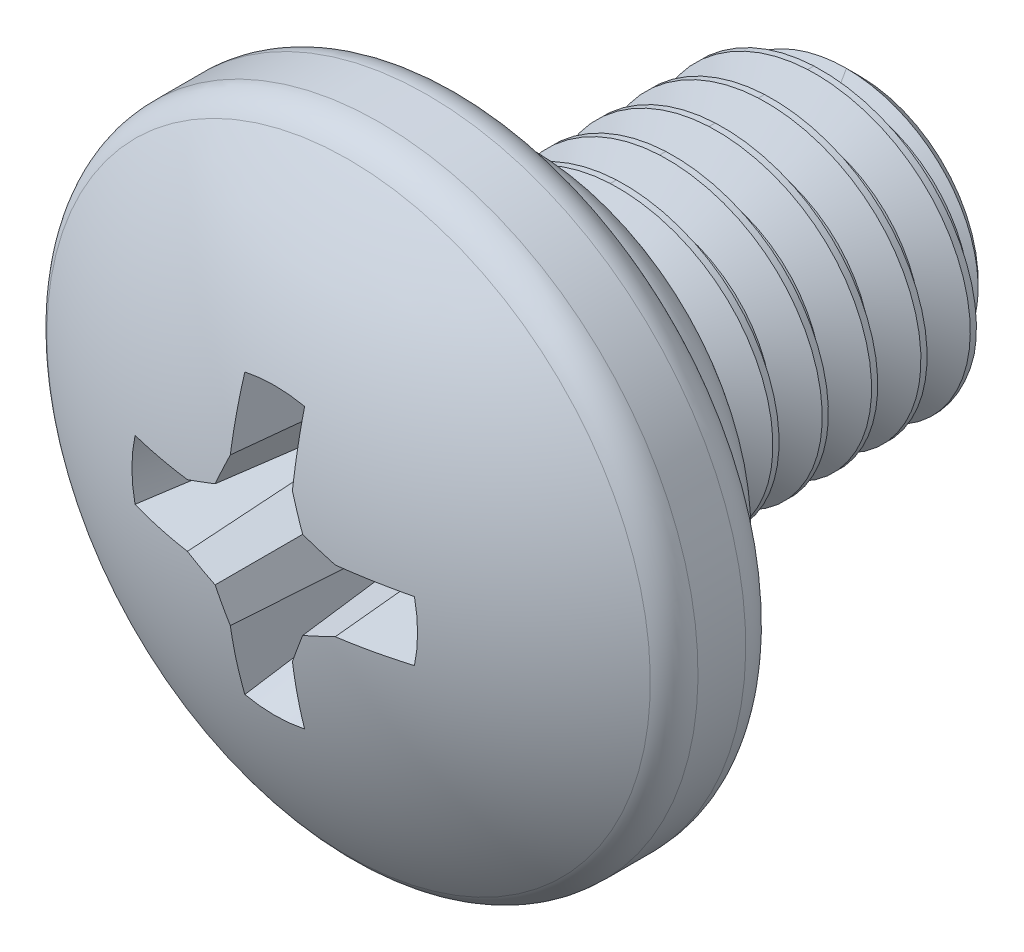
ISO-10303-21;
HEADER;
FILE_DESCRIPTION(('STEP AP214'),'2;1');
FILE_NAME('part.step','',(''),(''),'','','');
FILE_SCHEMA(('AUTOMOTIVE_DESIGN { 1 0 10303 214 1 1 1 1 }'));
ENDSEC;
DATA;
#1=APPLICATION_CONTEXT('core data for automotive mechanical design processes');
#2=APPLICATION_PROTOCOL_DEFINITION('international standard','automotive_design',2000,#1);
#3=PRODUCT_CONTEXT('',#1,'mechanical');
#4=PRODUCT('Part','Part','',(#3));
#5=PRODUCT_RELATED_PRODUCT_CATEGORY('part','',(#4));
#6=PRODUCT_DEFINITION_FORMATION('','',#4);
#7=PRODUCT_DEFINITION_CONTEXT('part definition',#1,'design');
#8=PRODUCT_DEFINITION('design','',#6,#7);
#9=PRODUCT_DEFINITION_SHAPE('','',#8);
#10=(LENGTH_UNIT() NAMED_UNIT(*) SI_UNIT(.MILLI.,.METRE.));
#11=(NAMED_UNIT(*) PLANE_ANGLE_UNIT() SI_UNIT($,.RADIAN.));
#12=(NAMED_UNIT(*) SI_UNIT($,.STERADIAN.) SOLID_ANGLE_UNIT());
#13=UNCERTAINTY_MEASURE_WITH_UNIT(LENGTH_MEASURE(1.E-05),#10,'distance_accuracy_value','');
#14=(GEOMETRIC_REPRESENTATION_CONTEXT(3) GLOBAL_UNCERTAINTY_ASSIGNED_CONTEXT((#13)) GLOBAL_UNIT_ASSIGNED_CONTEXT((#10,
#11,#12)) REPRESENTATION_CONTEXT('',''));
#15=CARTESIAN_POINT('',(0.,0.,0.));
#16=DIRECTION('',(0.,0.,1.));
#17=DIRECTION('',(1.,0.,0.));
#18=AXIS2_PLACEMENT_3D('',#15,#16,#17);
#19=CARTESIAN_POINT('',(0.,0.,5.80136));
#20=DIRECTION('',(0.,0.,-1.));
#21=DIRECTION('',(0.,1.,0.));
#22=AXIS2_PLACEMENT_3D('',#19,#20,#21);
#23=TOROIDAL_SURFACE('',#22,3.08864,0.67564);
#24=CARTESIAN_POINT('',(0.,3.76428,5.80136));
#25=VERTEX_POINT('',#24);
#26=VERTEX_LOOP('',#25);
#27=FACE_BOUND('',#26,.T.);
#28=ADVANCED_FACE('F44',(#27),#23,.T.);
#29=CLOSED_SHELL('',(#28));
#30=MANIFOLD_SOLID_BREP('B2',#29);
#31=CARTESIAN_POINT('',(0.,0.,6.95807600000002));
#32=DIRECTION('',(0.,0.,-1.));
#33=DIRECTION('',(0.,1.,0.));
#34=AXIS2_PLACEMENT_3D('',#31,#32,#33);
#35=TOROIDAL_SURFACE('',#34,4.51002400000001,0.608076);
#36=CARTESIAN_POINT('',(0.,0.,6.35));
#37=DIRECTION('',(0.,0.,-1.));
#38=DIRECTION('',(0.,1.,0.));
#39=AXIS2_PLACEMENT_3D('',#36,#37,#38);
#40=CIRCLE('',#39,4.510024);
#41=CARTESIAN_POINT('',(0.,4.510024,6.35));
#42=VERTEX_POINT('',#41);
#43=EDGE_CURVE('E75',#42,#42,#40,.T.);
#44=ORIENTED_EDGE('',*,*,#43,.F.);
#45=EDGE_LOOP('',(#44));
#46=FACE_BOUND('',#45,.T.);
#47=CARTESIAN_POINT('',(0.,0.,6.95807600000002));
#48=DIRECTION('',(0.,0.,-1.));
#49=DIRECTION('',(0.,1.,0.));
#50=AXIS2_PLACEMENT_3D('',#47,#48,#49);
#51=CIRCLE('',#50,5.11810000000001);
#52=CARTESIAN_POINT('',(0.,5.1181,6.958076));
#53=VERTEX_POINT('',#52);
#54=EDGE_CURVE('E255',#53,#53,#51,.T.);
#55=ORIENTED_EDGE('',*,*,#54,.T.);
#56=EDGE_LOOP('',(#55));
#57=FACE_BOUND('',#56,.T.);
#58=ADVANCED_FACE('F66',(#46,#57),#35,.T.);
#59=CARTESIAN_POINT('',(0.,0.,0.));
#60=DIRECTION('',(0.,0.,-1.));
#61=DIRECTION('',(0.,1.,0.));
#62=AXIS2_PLACEMENT_3D('',#59,#60,#61);
#63=CYLINDRICAL_SURFACE('',#62,5.1181);
#64=CARTESIAN_POINT('',(0.,0.,7.7256848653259));
#65=DIRECTION('',(0.,0.,-1.));
#66=DIRECTION('',(0.,1.,0.));
#67=AXIS2_PLACEMENT_3D('',#64,#65,#66);
#68=CIRCLE('',#67,5.11810000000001);
#69=CARTESIAN_POINT('',(0.,5.1181,7.72568486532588));
#70=VERTEX_POINT('',#69);
#71=EDGE_CURVE('E252',#70,#70,#68,.T.);
#72=ORIENTED_EDGE('',*,*,#71,.T.);
#73=EDGE_LOOP('',(#72));
#74=FACE_BOUND('',#73,.T.);
#75=ORIENTED_EDGE('',*,*,#54,.F.);
#76=EDGE_LOOP('',(#75));
#77=FACE_BOUND('',#76,.T.);
#78=ADVANCED_FACE('F316',(#74,#77),#63,.T.);
#79=CARTESIAN_POINT('',(0.,0.,1.12953609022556));
#80=DIRECTION('',(0.,0.,-1.));
#81=DIRECTION('',(0.,-1.,0.));
#82=AXIS2_PLACEMENT_3D('',#79,#80,#81);
#83=SPHERICAL_SURFACE('',#82,8.59866390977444);
#84=CARTESIAN_POINT('',(0.242429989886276,0.,1.15074596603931));
#85=DIRECTION('',(0.996194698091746,0.,0.0871557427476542));
#86=DIRECTION('',(0.0871557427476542,0.,-0.996194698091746));
#87=AXIS2_PLACEMENT_3D('',#84,#85,#86);
#88=CIRCLE('',#87,8.59521953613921);
#89=CARTESIAN_POINT('',(-0.499491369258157,1.18893252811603,9.6309459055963));
#90=VERTEX_POINT('',#89);
#91=CARTESIAN_POINT('',(-0.480649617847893,2.24664460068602,9.4155837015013));
#92=VERTEX_POINT('',#91);
#93=EDGE_CURVE('E241',#90,#92,#88,.F.);
#94=ORIENTED_EDGE('',*,*,#93,.T.);
#95=CARTESIAN_POINT('',(0.,0.,9.4155837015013));
#96=DIRECTION('',(0.,0.,-1.));
#97=DIRECTION('',(-1.,0.,0.));
#98=AXIS2_PLACEMENT_3D('',#95,#96,#97);
#99=CIRCLE('',#98,2.29748471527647);
#100=CARTESIAN_POINT('',(0.480649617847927,2.24664460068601,9.4155837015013));
#101=VERTEX_POINT('',#100);
#102=EDGE_CURVE('E237',#92,#101,#99,.T.);
#103=ORIENTED_EDGE('',*,*,#102,.T.);
#104=CARTESIAN_POINT('',(-0.242429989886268,0.,1.15074596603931));
#105=DIRECTION('',(-0.996194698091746,0.,0.0871557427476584));
#106=DIRECTION('',(0.0871557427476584,0.,0.996194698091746));
#107=AXIS2_PLACEMENT_3D('',#104,#105,#106);
#108=CIRCLE('',#107,8.59521953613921);
#109=CARTESIAN_POINT('',(0.499491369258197,1.18893252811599,9.6309459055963));
#110=VERTEX_POINT('',#109);
#111=EDGE_CURVE('E240',#101,#110,#108,.F.);
#112=ORIENTED_EDGE('',*,*,#111,.T.);
#113=CARTESIAN_POINT('',(0.158321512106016,0.0655789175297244,1.11454351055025));
#114=DIRECTION('',(-0.920363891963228,-0.381227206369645,0.0871557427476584));
#115=DIRECTION('',(0.382683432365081,-0.92387953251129,0.));
#116=AXIS2_PLACEMENT_3D('',#113,#114,#115);
#117=CIRCLE('',#116,8.59694305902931);
#118=CARTESIAN_POINT('',(0.704062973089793,0.704062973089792,9.67035640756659));
#119=VERTEX_POINT('',#118);
#120=EDGE_CURVE('E655',#110,#119,#117,.F.);
#121=ORIENTED_EDGE('',*,*,#120,.T.);
#122=CARTESIAN_POINT('',(0.065578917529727,0.158321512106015,1.11454351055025));
#123=DIRECTION('',(-0.381227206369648,-0.920363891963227,0.0871557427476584));
#124=DIRECTION('',(0.923879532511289,-0.382683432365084,0.));
#125=AXIS2_PLACEMENT_3D('',#122,#123,#124);
#126=CIRCLE('',#125,8.59694305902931);
#127=CARTESIAN_POINT('',(1.18893252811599,0.499491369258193,9.6309459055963));
#128=VERTEX_POINT('',#127);
#129=EDGE_CURVE('E205',#119,#128,#126,.F.);
#130=ORIENTED_EDGE('',*,*,#129,.T.);
#131=CARTESIAN_POINT('',(0.,-0.242429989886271,1.15074596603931));
#132=DIRECTION('',(0.,-0.996194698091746,0.0871557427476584));
#133=DIRECTION('',(0.,-0.0871557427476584,-0.996194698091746));
#134=AXIS2_PLACEMENT_3D('',#131,#132,#133);
#135=CIRCLE('',#134,8.59521953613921);
#136=CARTESIAN_POINT('',(2.24664460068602,0.480649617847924,9.4155837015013));
#137=VERTEX_POINT('',#136);
#138=EDGE_CURVE('E247',#128,#137,#135,.F.);
#139=ORIENTED_EDGE('',*,*,#138,.T.);
#140=CARTESIAN_POINT('',(0.,0.,9.4155837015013));
#141=DIRECTION('',(0.,0.,-1.));
#142=DIRECTION('',(-1.,0.,0.));
#143=AXIS2_PLACEMENT_3D('',#140,#141,#142);
#144=CIRCLE('',#143,2.29748471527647);
#145=CARTESIAN_POINT('',(2.24664460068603,-0.480649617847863,9.4155837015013));
#146=VERTEX_POINT('',#145);
#147=EDGE_CURVE('E244',#137,#146,#144,.T.);
#148=ORIENTED_EDGE('',*,*,#147,.T.);
#149=CARTESIAN_POINT('',(0.,0.242429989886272,1.15074596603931));
#150=DIRECTION('',(0.,0.996194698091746,0.0871557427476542));
#151=DIRECTION('',(0.,-0.0871557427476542,0.996194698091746));
#152=AXIS2_PLACEMENT_3D('',#149,#150,#151);
#153=CIRCLE('',#152,8.59521953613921);
#154=CARTESIAN_POINT('',(1.18893252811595,-0.499491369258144,9.63094590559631));
#155=VERTEX_POINT('',#154);
#156=EDGE_CURVE('E246',#146,#155,#153,.F.);
#157=ORIENTED_EDGE('',*,*,#156,.T.);
#158=CARTESIAN_POINT('',(0.0655789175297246,-0.158321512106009,1.11454351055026));
#159=DIRECTION('',(-0.381227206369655,0.920363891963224,0.0871557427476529));
#160=DIRECTION('',(-0.923879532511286,-0.382683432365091,0.));
#161=AXIS2_PLACEMENT_3D('',#158,#159,#160);
#162=CIRCLE('',#161,8.59694305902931);
#163=CARTESIAN_POINT('',(0.704062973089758,-0.704062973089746,9.6703564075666));
#164=VERTEX_POINT('',#163);
#165=EDGE_CURVE('E677',#155,#164,#162,.F.);
#166=ORIENTED_EDGE('',*,*,#165,.T.);
#167=CARTESIAN_POINT('',(0.158321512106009,-0.0655789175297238,1.11454351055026));
#168=DIRECTION('',(-0.920363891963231,0.381227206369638,0.0871557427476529));
#169=DIRECTION('',(-0.382683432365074,-0.923879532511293,0.));
#170=AXIS2_PLACEMENT_3D('',#167,#168,#169);
#171=CIRCLE('',#170,8.59694305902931);
#172=CARTESIAN_POINT('',(0.499491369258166,-1.18893252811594,9.63094590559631));
#173=VERTEX_POINT('',#172);
#174=EDGE_CURVE('E680',#164,#173,#171,.F.);
#175=ORIENTED_EDGE('',*,*,#174,.T.);
#176=CARTESIAN_POINT('',(-0.242429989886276,0.,1.15074596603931));
#177=DIRECTION('',(-0.996194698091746,0.,0.0871557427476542));
#178=DIRECTION('',(0.0871557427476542,0.,0.996194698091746));
#179=AXIS2_PLACEMENT_3D('',#176,#177,#178);
#180=CIRCLE('',#179,8.59521953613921);
#181=CARTESIAN_POINT('',(0.480649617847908,-2.24664460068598,9.41558370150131));
#182=VERTEX_POINT('',#181);
#183=EDGE_CURVE('E83',#173,#182,#180,.F.);
#184=ORIENTED_EDGE('',*,*,#183,.T.);
#185=CARTESIAN_POINT('',(0.,0.,9.4155837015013));
#186=DIRECTION('',(0.,0.,-1.));
#187=DIRECTION('',(-1.,0.,0.));
#188=AXIS2_PLACEMENT_3D('',#185,#186,#187);
#189=CIRCLE('',#188,2.29748471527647);
#190=CARTESIAN_POINT('',(-0.48064961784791,-2.24664460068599,9.41558370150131));
#191=VERTEX_POINT('',#190);
#192=EDGE_CURVE('E423',#182,#191,#189,.T.);
#193=ORIENTED_EDGE('',*,*,#192,.T.);
#194=CARTESIAN_POINT('',(0.242429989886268,0.,1.15074596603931));
#195=DIRECTION('',(0.996194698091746,0.,0.0871557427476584));
#196=DIRECTION('',(0.0871557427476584,0.,-0.996194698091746));
#197=AXIS2_PLACEMENT_3D('',#194,#195,#196);
#198=CIRCLE('',#197,8.59521953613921);
#199=CARTESIAN_POINT('',(-0.499491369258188,-1.18893252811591,9.63094590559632));
#200=VERTEX_POINT('',#199);
#201=EDGE_CURVE('E420',#191,#200,#198,.F.);
#202=ORIENTED_EDGE('',*,*,#201,.T.);
#203=CARTESIAN_POINT('',(-0.15832151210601,-0.0655789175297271,1.11454351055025));
#204=DIRECTION('',(0.920363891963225,0.381227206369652,0.0871557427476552));
#205=DIRECTION('',(-0.382683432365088,0.923879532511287,0.));
#206=AXIS2_PLACEMENT_3D('',#203,#204,#205);
#207=CIRCLE('',#206,8.59694305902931);
#208=CARTESIAN_POINT('',(-0.704062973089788,-0.704062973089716,9.6703564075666));
#209=VERTEX_POINT('',#208);
#210=EDGE_CURVE('E408',#200,#209,#207,.F.);
#211=ORIENTED_EDGE('',*,*,#210,.T.);
#212=CARTESIAN_POINT('',(-0.0655789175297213,-0.158321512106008,1.11454351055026));
#213=DIRECTION('',(0.381227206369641,0.92036389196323,0.0871557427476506));
#214=DIRECTION('',(-0.923879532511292,0.382683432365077,0.));
#215=AXIS2_PLACEMENT_3D('',#212,#213,#214);
#216=CIRCLE('',#215,8.59694305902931);
#217=CARTESIAN_POINT('',(-1.18893252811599,-0.499491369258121,9.63094590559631));
#218=VERTEX_POINT('',#217);
#219=EDGE_CURVE('E405',#209,#218,#216,.F.);
#220=ORIENTED_EDGE('',*,*,#219,.T.);
#221=CARTESIAN_POINT('',(0.,0.242429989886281,1.15074596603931));
#222=DIRECTION('',(0.,0.996194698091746,0.08715574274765));
#223=DIRECTION('',(0.,-0.08715574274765,0.996194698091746));
#224=AXIS2_PLACEMENT_3D('',#221,#222,#223);
#225=CIRCLE('',#224,8.59521953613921);
#226=CARTESIAN_POINT('',(-2.24664460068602,-0.480649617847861,9.41558370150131));
#227=VERTEX_POINT('',#226);
#228=EDGE_CURVE('E403',#218,#227,#225,.F.);
#229=ORIENTED_EDGE('',*,*,#228,.T.);
#230=CARTESIAN_POINT('',(0.,0.,9.4155837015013));
#231=DIRECTION('',(0.,0.,-1.));
#232=DIRECTION('',(0.,1.,0.));
#233=AXIS2_PLACEMENT_3D('',#230,#231,#232);
#234=CIRCLE('',#233,2.29748471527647);
#235=CARTESIAN_POINT('',(-2.24664460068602,0.480649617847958,9.4155837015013));
#236=VERTEX_POINT('',#235);
#237=EDGE_CURVE('E328',#227,#236,#234,.T.);
#238=ORIENTED_EDGE('',*,*,#237,.T.);
#239=CARTESIAN_POINT('',(0.,-0.242429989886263,1.15074596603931));
#240=DIRECTION('',(0.,-0.996194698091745,0.0871557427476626));
#241=DIRECTION('',(0.,-0.0871557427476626,-0.996194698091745));
#242=AXIS2_PLACEMENT_3D('',#239,#240,#241);
#243=CIRCLE('',#242,8.59521953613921);
#244=CARTESIAN_POINT('',(-1.18893252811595,0.499491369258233,9.63094590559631));
#245=VERTEX_POINT('',#244);
#246=EDGE_CURVE('E364',#236,#245,#243,.F.);
#247=ORIENTED_EDGE('',*,*,#246,.T.);
#248=CARTESIAN_POINT('',(-0.0655789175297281,0.158321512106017,1.11454351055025));
#249=DIRECTION('',(0.381227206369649,-0.920363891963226,0.0871557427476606));
#250=DIRECTION('',(0.923879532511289,0.382683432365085,0.));
#251=AXIS2_PLACEMENT_3D('',#248,#249,#250);
#252=CIRCLE('',#251,8.59694305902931);
#253=CARTESIAN_POINT('',(-0.704062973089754,0.704062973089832,9.67035640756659));
#254=VERTEX_POINT('',#253);
#255=EDGE_CURVE('E399',#245,#254,#252,.F.);
#256=ORIENTED_EDGE('',*,*,#255,.T.);
#257=CARTESIAN_POINT('',(-0.158321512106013,0.0655789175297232,1.11454351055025));
#258=DIRECTION('',(0.920363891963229,-0.381227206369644,0.0871557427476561));
#259=DIRECTION('',(0.38268343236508,0.923879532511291,0.));
#260=AXIS2_PLACEMENT_3D('',#257,#258,#259);
#261=CIRCLE('',#260,8.59694305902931);
#262=EDGE_CURVE('E251',#254,#90,#261,.F.);
#263=ORIENTED_EDGE('',*,*,#262,.T.);
#264=EDGE_LOOP('',(#94,#103,#112,#121,#130,#139,#148,#157,#166,#175,#184,#193,#202,#211,#220,
#229,#238,#247,#256,#263));
#265=FACE_BOUND('',#264,.T.);
#266=CARTESIAN_POINT('',(0.,0.,8.22764539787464));
#267=DIRECTION('',(0.,0.,-1.));
#268=DIRECTION('',(0.,1.,0.));
#269=AXIS2_PLACEMENT_3D('',#266,#267,#268);
#270=CIRCLE('',#269,4.85323245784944);
#271=CARTESIAN_POINT('',(0.,4.85323245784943,8.22764539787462));
#272=VERTEX_POINT('',#271);
#273=EDGE_CURVE('E248',#272,#272,#270,.T.);
#274=ORIENTED_EDGE('',*,*,#273,.F.);
#275=EDGE_LOOP('',(#274));
#276=FACE_BOUND('',#275,.T.);
#277=ADVANCED_FACE('F451',(#265,#276),#83,.T.);
#278=CARTESIAN_POINT('',(0.,0.,7.7256848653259));
#279=DIRECTION('',(0.,0.,-1.));
#280=DIRECTION('',(0.,1.,0.));
#281=AXIS2_PLACEMENT_3D('',#278,#279,#280);
#282=TOROIDAL_SURFACE('',#281,4.51002400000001,0.608076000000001);
#283=ORIENTED_EDGE('',*,*,#71,.F.);
#284=EDGE_LOOP('',(#283));
#285=FACE_BOUND('',#284,.T.);
#286=ORIENTED_EDGE('',*,*,#273,.T.);
#287=EDGE_LOOP('',(#286));
#288=FACE_BOUND('',#287,.T.);
#289=ADVANCED_FACE('F456',(#285,#288),#282,.T.);
#290=CARTESIAN_POINT('',(0.,0.,9.7282));
#291=DIRECTION('',(0.,0.,1.));
#292=DIRECTION('',(1.,0.,0.));
#293=AXIS2_PLACEMENT_3D('',#290,#291,#292);
#294=CONICAL_SURFACE('',#293,2.38125,0.26179938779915);
#295=ORIENTED_EDGE('',*,*,#102,.F.);
#296=CARTESIAN_POINT('',(-0.256778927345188,1.59125704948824,6.85673));
#297=CARTESIAN_POINT('',(-0.27542964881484,1.6461049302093,7.06990872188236));
#298=CARTESIAN_POINT('',(-0.294082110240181,1.70087483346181,7.28310733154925));
#299=CARTESIAN_POINT('',(-0.331389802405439,1.81029015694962,7.70953620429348));
#300=CARTESIAN_POINT('',(-0.350045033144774,1.86493557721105,7.92276646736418));
#301=CARTESIAN_POINT('',(-0.387357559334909,1.97413342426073,8.34925059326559));
#302=CARTESIAN_POINT('',(-0.406014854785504,2.02868585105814,8.56250445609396));
#303=CARTESIAN_POINT('',(-0.443331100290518,2.13771634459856,8.98903109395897));
#304=CARTESIAN_POINT('',(-0.46199005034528,2.19219441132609,9.20230386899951));
#305=CARTESIAN_POINT('',(-0.480649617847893,2.24664460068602,9.4155837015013));
#306=B_SPLINE_CURVE_WITH_KNOTS('',3,(#296,#297,#298,#299,#300,#301,#302,#303,#304,#305),
.UNSPECIFIED.,.F.,.F.,(4,2,2,2,4),(0.,0.662730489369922,1.32546083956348,1.9881911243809,
2.65092154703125),.UNSPECIFIED.);
#307=CARTESIAN_POINT('',(-0.256778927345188,1.59125704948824,6.85673));
#308=VERTEX_POINT('',#307);
#309=EDGE_CURVE('E384',#308,#92,#306,.T.);
#310=ORIENTED_EDGE('',*,*,#309,.F.);
#311=CARTESIAN_POINT('',(0.,0.,6.85673));
#312=DIRECTION('',(0.,0.,1.));
#313=DIRECTION('',(1.,0.,0.));
#314=AXIS2_PLACEMENT_3D('',#311,#312,#313);
#315=CIRCLE('',#314,1.6118419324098);
#316=CARTESIAN_POINT('',(0.256778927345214,1.59125704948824,6.85673));
#317=VERTEX_POINT('',#316);
#318=EDGE_CURVE('E233',#317,#308,#315,.T.);
#319=ORIENTED_EDGE('',*,*,#318,.F.);
#320=CARTESIAN_POINT('',(0.677392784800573,2.81982244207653,11.6643683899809));
#321=CARTESIAN_POINT('',(0.642333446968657,2.71781107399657,11.263638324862));
#322=CARTESIAN_POINT('',(0.60727512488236,2.61575370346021,10.8629198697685));
#323=CARTESIAN_POINT('',(0.537161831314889,2.41148817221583,10.0615212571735));
#324=CARTESIAN_POINT('',(0.502106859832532,2.30928001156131,9.66084109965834));
#325=CARTESIAN_POINT('',(0.432001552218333,2.10465401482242,8.85953376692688));
#326=CARTESIAN_POINT('',(0.39695121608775,2.00223617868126,8.45890659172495));
#327=CARTESIAN_POINT('',(0.326858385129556,1.79704734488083,7.65774186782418));
#328=CARTESIAN_POINT('',(0.291815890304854,1.69427634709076,7.25720431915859));
#329=CARTESIAN_POINT('',(0.256778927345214,1.59125704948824,6.85673));
#330=B_SPLINE_CURVE_WITH_KNOTS('',3,(#320,#321,#322,#323,#324,#325,#326,#327,#328,#329),
.UNSPECIFIED.,.F.,.F.,(4,2,2,2,4),(0.,1.24498215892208,2.48996387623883,3.73494593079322,
4.97992844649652),.UNSPECIFIED.);
#331=EDGE_CURVE('E229',#317,#101,#330,.F.);
#332=ORIENTED_EDGE('',*,*,#331,.T.);
#333=EDGE_LOOP('',(#295,#310,#319,#332));
#334=FACE_BOUND('',#333,.T.);
#335=ADVANCED_FACE('F313',(#334),#294,.F.);
#336=CARTESIAN_POINT('',(0.508,0.,9.7282));
#337=DIRECTION('',(-0.996194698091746,0.,0.0871557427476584));
#338=DIRECTION('',(0.0871557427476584,0.,0.996194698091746));
#339=AXIS2_PLACEMENT_3D('',#336,#337,#338);
#340=PLANE('',#339);
#341=ORIENTED_EDGE('',*,*,#331,.F.);
#342=DIRECTION('',(0.,-1.,0.));
#343=VECTOR('',#342,1.);
#344=CARTESIAN_POINT('',(0.256778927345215,0.,6.85673));
#345=LINE('',#344,#343);
#346=CARTESIAN_POINT('',(0.256778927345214,1.14065402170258,6.85673));
#347=VERTEX_POINT('',#346);
#348=EDGE_CURVE('E218',#347,#317,#345,.F.);
#349=ORIENTED_EDGE('',*,*,#348,.F.);
#350=DIRECTION('',(0.0871426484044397,0.0173337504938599,0.996045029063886));
#351=VECTOR('',#350,1.);
#352=CARTESIAN_POINT('',(0.50620155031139,1.19026726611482,9.7076436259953));
#353=LINE('',#352,#351);
#354=EDGE_CURVE('E209',#347,#110,#353,.T.);
#355=ORIENTED_EDGE('',*,*,#354,.T.);
#356=ORIENTED_EDGE('',*,*,#111,.F.);
#357=EDGE_LOOP('',(#341,#349,#355,#356));
#358=FACE_BOUND('',#357,.T.);
#359=ADVANCED_FACE('F336',(#358),#340,.T.);
#360=CARTESIAN_POINT('',(0.854554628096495,0.353968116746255,9.7282));
#361=DIRECTION('',(-0.920363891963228,-0.381227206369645,0.0871557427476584));
#362=DIRECTION('',(0.382683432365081,-0.92387953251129,0.));
#363=AXIS2_PLACEMENT_3D('',#360,#361,#362);
#364=PLANE('',#363);
#365=ORIENTED_EDGE('',*,*,#354,.F.);
#366=DIRECTION('',(0.382683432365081,-0.92387953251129,0.));
#367=VECTOR('',#366,1.);
#368=CARTESIAN_POINT('',(0.622456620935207,0.257829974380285,6.85673));
#369=LINE('',#368,#367);
#370=CARTESIAN_POINT('',(0.515659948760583,0.515659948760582,6.85673));
#371=VERTEX_POINT('',#370);
#372=EDGE_CURVE('E212',#371,#347,#369,.F.);
#373=ORIENTED_EDGE('',*,*,#372,.F.);
#374=DIRECTION('',(0.0666626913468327,0.0666626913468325,0.995546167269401));
#375=VECTOR('',#374,1.);
#376=CARTESIAN_POINT('',(0.707014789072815,0.707014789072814,9.71443907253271));
#377=LINE('',#376,#375);
#378=EDGE_CURVE('E197',#371,#119,#377,.T.);
#379=ORIENTED_EDGE('',*,*,#378,.T.);
#380=ORIENTED_EDGE('',*,*,#120,.F.);
#381=EDGE_LOOP('',(#365,#373,#379,#380));
#382=FACE_BOUND('',#381,.T.);
#383=ADVANCED_FACE('F213',(#382),#364,.T.);
#384=CARTESIAN_POINT('',(0.353968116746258,0.854554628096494,9.7282));
#385=DIRECTION('',(-0.381227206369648,-0.920363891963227,0.0871557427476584));
#386=DIRECTION('',(0.923879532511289,-0.382683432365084,0.));
#387=AXIS2_PLACEMENT_3D('',#384,#385,#386);
#388=PLANE('',#387);
#389=ORIENTED_EDGE('',*,*,#378,.F.);
#390=DIRECTION('',(0.923879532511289,-0.382683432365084,0.));
#391=VECTOR('',#390,1.);
#392=CARTESIAN_POINT('',(0.257829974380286,0.622456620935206,6.85673));
#393=LINE('',#392,#391);
#394=CARTESIAN_POINT('',(1.14065402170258,0.256778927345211,6.85673));
#395=VERTEX_POINT('',#394);
#396=EDGE_CURVE('E202',#395,#371,#393,.F.);
#397=ORIENTED_EDGE('',*,*,#396,.F.);
#398=DIRECTION('',(0.0173337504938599,0.0871426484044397,0.996045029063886));
#399=VECTOR('',#398,1.);
#400=CARTESIAN_POINT('',(1.19089709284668,0.509367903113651,9.74383520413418));
#401=LINE('',#400,#399);
#402=EDGE_CURVE('E208',#395,#128,#401,.T.);
#403=ORIENTED_EDGE('',*,*,#402,.T.);
#404=ORIENTED_EDGE('',*,*,#129,.F.);
#405=EDGE_LOOP('',(#389,#397,#403,#404));
#406=FACE_BOUND('',#405,.T.);
#407=ADVANCED_FACE('F199',(#406),#388,.T.);
#408=CARTESIAN_POINT('',(0.,0.507999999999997,9.7282));
#409=DIRECTION('',(0.,-0.996194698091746,0.0871557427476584));
#410=DIRECTION('',(0.,-0.0871557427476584,-0.996194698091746));
#411=AXIS2_PLACEMENT_3D('',#408,#409,#410);
#412=PLANE('',#411);
#413=ORIENTED_EDGE('',*,*,#402,.F.);
#414=DIRECTION('',(1.,0.,0.));
#415=VECTOR('',#414,1.);
#416=CARTESIAN_POINT('',(0.,0.256778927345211,6.85673));
#417=LINE('',#416,#415);
#418=CARTESIAN_POINT('',(1.59125704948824,0.256778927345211,6.85673));
#419=VERTEX_POINT('',#418);
#420=EDGE_CURVE('E223',#419,#395,#417,.F.);
#421=ORIENTED_EDGE('',*,*,#420,.F.);
#422=CARTESIAN_POINT('',(1.59125704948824,0.256778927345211,6.85673));
#423=CARTESIAN_POINT('',(1.6461049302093,0.275429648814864,7.06990872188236));
#424=CARTESIAN_POINT('',(1.70087483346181,0.294082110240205,7.28310733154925));
#425=CARTESIAN_POINT('',(1.81029015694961,0.331389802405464,7.70953620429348));
#426=CARTESIAN_POINT('',(1.86493557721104,0.350045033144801,7.92276646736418));
#427=CARTESIAN_POINT('',(1.97413342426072,0.387357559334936,8.34925059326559));
#428=CARTESIAN_POINT('',(2.02868585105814,0.406014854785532,8.56250445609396));
#429=CARTESIAN_POINT('',(2.13771634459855,0.443331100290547,8.98903109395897));
#430=CARTESIAN_POINT('',(2.19219441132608,0.46199005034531,9.20230386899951));
#431=CARTESIAN_POINT('',(2.24664460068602,0.480649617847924,9.4155837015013));
#432=B_SPLINE_CURVE_WITH_KNOTS('',3,(#422,#423,#424,#425,#426,#427,#428,#429,#430,#431),
.UNSPECIFIED.,.F.,.F.,(4,2,2,2,4),(0.,0.662730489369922,1.32546083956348,1.9881911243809,
2.65092154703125),.UNSPECIFIED.);
#433=EDGE_CURVE('E232',#419,#137,#432,.T.);
#434=ORIENTED_EDGE('',*,*,#433,.T.);
#435=ORIENTED_EDGE('',*,*,#138,.F.);
#436=EDGE_LOOP('',(#413,#421,#434,#435));
#437=FACE_BOUND('',#436,.T.);
#438=ADVANCED_FACE('F311',(#437),#412,.T.);
#439=CARTESIAN_POINT('',(0.,0.,9.7282));
#440=DIRECTION('',(0.,0.,1.));
#441=DIRECTION('',(1.,0.,0.));
#442=AXIS2_PLACEMENT_3D('',#439,#440,#441);
#443=CONICAL_SURFACE('',#442,2.38125,0.26179938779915);
#444=ORIENTED_EDGE('',*,*,#433,.F.);
#445=CARTESIAN_POINT('',(0.,0.,6.85673));
#446=DIRECTION('',(0.,0.,1.));
#447=DIRECTION('',(1.,0.,0.));
#448=AXIS2_PLACEMENT_3D('',#445,#446,#447);
#449=CIRCLE('',#448,1.6118419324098);
#450=CARTESIAN_POINT('',(1.59125704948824,-0.256778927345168,6.85673));
#451=VERTEX_POINT('',#450);
#452=EDGE_CURVE('E225',#451,#419,#449,.T.);
#453=ORIENTED_EDGE('',*,*,#452,.F.);
#454=CARTESIAN_POINT('',(2.81982244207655,-0.677392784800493,11.6643683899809));
#455=CARTESIAN_POINT('',(2.71781107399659,-0.64233344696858,11.263638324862));
#456=CARTESIAN_POINT('',(2.61575370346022,-0.607275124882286,10.8629198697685));
#457=CARTESIAN_POINT('',(2.41148817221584,-0.537161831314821,10.0615212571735));
#458=CARTESIAN_POINT('',(2.30928001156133,-0.502106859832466,9.66084109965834));
#459=CARTESIAN_POINT('',(2.10465401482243,-0.432001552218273,8.85953376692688));
#460=CARTESIAN_POINT('',(2.00223617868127,-0.396951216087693,8.45890659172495));
#461=CARTESIAN_POINT('',(1.79704734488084,-0.326858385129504,7.65774186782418));
#462=CARTESIAN_POINT('',(1.69427634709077,-0.291815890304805,7.25720431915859));
#463=CARTESIAN_POINT('',(1.59125704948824,-0.256778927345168,6.85673));
#464=B_SPLINE_CURVE_WITH_KNOTS('',3,(#454,#455,#456,#457,#458,#459,#460,#461,#462,#463),
.UNSPECIFIED.,.F.,.F.,(4,2,2,2,4),(0.,1.24498215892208,2.48996387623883,3.73494593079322,
4.97992844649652),.UNSPECIFIED.);
#465=EDGE_CURVE('E236',#451,#146,#464,.F.);
#466=ORIENTED_EDGE('',*,*,#465,.T.);
#467=ORIENTED_EDGE('',*,*,#147,.F.);
#468=EDGE_LOOP('',(#444,#453,#466,#467));
#469=FACE_BOUND('',#468,.T.);
#470=ADVANCED_FACE('F306',(#469),#443,.F.);
#471=CARTESIAN_POINT('',(0.,0.,6.85673));
#472=DIRECTION('',(0.,0.,1.));
#473=DIRECTION('',(1.,0.,0.));
#474=AXIS2_PLACEMENT_3D('',#471,#472,#473);
#475=PLANE('',#474);
#476=ORIENTED_EDGE('',*,*,#318,.T.);
#477=DIRECTION('',(0.,1.,0.));
#478=VECTOR('',#477,1.);
#479=CARTESIAN_POINT('',(-0.256778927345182,0.,6.85673));
#480=LINE('',#479,#478);
#481=CARTESIAN_POINT('',(-0.256778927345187,1.14065402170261,6.85673));
#482=VERTEX_POINT('',#481);
#483=EDGE_CURVE('E235',#308,#482,#480,.F.);
#484=ORIENTED_EDGE('',*,*,#483,.T.);
#485=DIRECTION('',(0.38268343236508,0.923879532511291,0.));
#486=VECTOR('',#485,1.);
#487=CARTESIAN_POINT('',(-0.622456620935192,0.257829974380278,6.85673));
#488=LINE('',#487,#486);
#489=CARTESIAN_POINT('',(-0.515659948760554,0.51565994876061,6.85673));
#490=VERTEX_POINT('',#489);
#491=EDGE_CURVE('E631',#482,#490,#488,.F.);
#492=ORIENTED_EDGE('',*,*,#491,.T.);
#493=DIRECTION('',(0.923879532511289,0.382683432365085,0.));
#494=VECTOR('',#493,1.);
#495=CARTESIAN_POINT('',(-0.257829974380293,0.62245662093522,6.85673));
#496=LINE('',#495,#494);
#497=CARTESIAN_POINT('',(-1.14065402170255,0.256778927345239,6.85673));
#498=VERTEX_POINT('',#497);
#499=EDGE_CURVE('E648',#490,#498,#496,.F.);
#500=ORIENTED_EDGE('',*,*,#499,.T.);
#501=DIRECTION('',(1.,0.,0.));
#502=VECTOR('',#501,1.);
#503=CARTESIAN_POINT('',(0.,0.256778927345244,6.85673));
#504=LINE('',#503,#502);
#505=CARTESIAN_POINT('',(-1.59125704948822,0.256778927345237,6.85673));
#506=VERTEX_POINT('',#505);
#507=EDGE_CURVE('E366',#498,#506,#504,.F.);
#508=ORIENTED_EDGE('',*,*,#507,.T.);
#509=CARTESIAN_POINT('',(0.,0.,6.85673));
#510=DIRECTION('',(0.,0.,1.));
#511=DIRECTION('',(1.,0.,0.));
#512=AXIS2_PLACEMENT_3D('',#509,#510,#511);
#513=CIRCLE('',#512,1.6118419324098);
#514=CARTESIAN_POINT('',(-1.59125704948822,-0.256778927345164,6.85673));
#515=VERTEX_POINT('',#514);
#516=EDGE_CURVE('E641',#506,#515,#513,.T.);
#517=ORIENTED_EDGE('',*,*,#516,.T.);
#518=DIRECTION('',(-1.,0.,0.));
#519=VECTOR('',#518,1.);
#520=CARTESIAN_POINT('',(0.,-0.256778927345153,6.85673));
#521=LINE('',#520,#519);
#522=CARTESIAN_POINT('',(-1.14065402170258,-0.256778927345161,6.85673));
#523=VERTEX_POINT('',#522);
#524=EDGE_CURVE('E642',#515,#523,#521,.F.);
#525=ORIENTED_EDGE('',*,*,#524,.T.);
#526=DIRECTION('',(-0.923879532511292,0.382683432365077,0.));
#527=VECTOR('',#526,1.);
#528=CARTESIAN_POINT('',(-0.257829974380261,-0.622456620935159,6.85673));
#529=LINE('',#528,#527);
#530=CARTESIAN_POINT('',(-0.515659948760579,-0.515659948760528,6.85673));
#531=VERTEX_POINT('',#530);
#532=EDGE_CURVE('E646',#523,#531,#529,.F.);
#533=ORIENTED_EDGE('',*,*,#532,.T.);
#534=DIRECTION('',(-0.382683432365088,0.923879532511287,0.));
#535=VECTOR('',#534,1.);
#536=CARTESIAN_POINT('',(-0.622456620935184,-0.257829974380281,6.85673));
#537=LINE('',#536,#535);
#538=CARTESIAN_POINT('',(-0.256778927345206,-1.14065402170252,6.85673));
#539=VERTEX_POINT('',#538);
#540=EDGE_CURVE('E690',#531,#539,#537,.F.);
#541=ORIENTED_EDGE('',*,*,#540,.T.);
#542=DIRECTION('',(0.,1.,0.));
#543=VECTOR('',#542,1.);
#544=CARTESIAN_POINT('',(-0.256778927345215,0.,6.85673));
#545=LINE('',#544,#543);
#546=CARTESIAN_POINT('',(-0.256778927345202,-1.59125704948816,6.85673));
#547=VERTEX_POINT('',#546);
#548=EDGE_CURVE('E432',#539,#547,#545,.F.);
#549=ORIENTED_EDGE('',*,*,#548,.T.);
#550=CARTESIAN_POINT('',(0.,0.,6.85673));
#551=DIRECTION('',(0.,0.,1.));
#552=DIRECTION('',(1.,0.,0.));
#553=AXIS2_PLACEMENT_3D('',#550,#551,#552);
#554=CIRCLE('',#553,1.6118419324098);
#555=CARTESIAN_POINT('',(0.256778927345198,-1.59125704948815,6.85673));
#556=VERTEX_POINT('',#555);
#557=EDGE_CURVE('E636',#547,#556,#554,.T.);
#558=ORIENTED_EDGE('',*,*,#557,.T.);
#559=DIRECTION('',(0.,-1.,0.));
#560=VECTOR('',#559,1.);
#561=CARTESIAN_POINT('',(0.256778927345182,0.,6.85673));
#562=LINE('',#561,#560);
#563=CARTESIAN_POINT('',(0.256778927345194,-1.14065402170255,6.85673));
#564=VERTEX_POINT('',#563);
#565=EDGE_CURVE('E639',#556,#564,#562,.F.);
#566=ORIENTED_EDGE('',*,*,#565,.T.);
#567=DIRECTION('',(-0.382683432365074,-0.923879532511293,0.));
#568=VECTOR('',#567,1.);
#569=CARTESIAN_POINT('',(0.622456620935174,-0.257829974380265,6.85673));
#570=LINE('',#569,#568);
#571=CARTESIAN_POINT('',(0.515659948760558,-0.515659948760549,6.85673));
#572=VERTEX_POINT('',#571);
#573=EDGE_CURVE('E668',#564,#572,#570,.F.);
#574=ORIENTED_EDGE('',*,*,#573,.T.);
#575=DIRECTION('',(-0.923879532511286,-0.382683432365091,0.));
#576=VECTOR('',#575,1.);
#577=CARTESIAN_POINT('',(0.257829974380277,-0.622456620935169,6.85673));
#578=LINE('',#577,#576);
#579=CARTESIAN_POINT('',(1.14065402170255,-0.256778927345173,6.85673));
#580=VERTEX_POINT('',#579);
#581=EDGE_CURVE('E667',#572,#580,#578,.F.);
#582=ORIENTED_EDGE('',*,*,#581,.T.);
#583=DIRECTION('',(-1.,0.,0.));
#584=VECTOR('',#583,1.);
#585=CARTESIAN_POINT('',(0.,-0.256778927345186,6.85673));
#586=LINE('',#585,#584);
#587=EDGE_CURVE('E243',#580,#451,#586,.F.);
#588=ORIENTED_EDGE('',*,*,#587,.T.);
#589=ORIENTED_EDGE('',*,*,#452,.T.);
#590=ORIENTED_EDGE('',*,*,#420,.T.);
#591=ORIENTED_EDGE('',*,*,#396,.T.);
#592=ORIENTED_EDGE('',*,*,#372,.T.);
#593=ORIENTED_EDGE('',*,*,#348,.T.);
#594=EDGE_LOOP('',(#476,#484,#492,#500,#508,#517,#525,#533,#541,#549,#558,#566,#574,#582,#588,
#589,#590,#591,#592,#593));
#595=FACE_BOUND('',#594,.T.);
#596=ADVANCED_FACE('F220',(#595),#475,.T.);
#597=CARTESIAN_POINT('',(0.,0.,9.7282));
#598=DIRECTION('',(0.,0.,1.));
#599=DIRECTION('',(0.,-1.,0.));
#600=AXIS2_PLACEMENT_3D('',#597,#598,#599);
#601=CONICAL_SURFACE('',#600,2.38125,0.26179938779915);
#602=CARTESIAN_POINT('',(-1.59125704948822,-0.256778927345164,6.85673));
#603=CARTESIAN_POINT('',(-1.64610493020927,-0.275429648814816,7.06990872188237));
#604=CARTESIAN_POINT('',(-1.70087483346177,-0.294082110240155,7.28310733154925));
#605=CARTESIAN_POINT('',(-1.81029015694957,-0.331389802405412,7.70953620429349));
#606=CARTESIAN_POINT('',(-1.86493557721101,-0.350045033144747,7.92276646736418));
#607=CARTESIAN_POINT('',(-1.97413342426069,-0.387357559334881,8.34925059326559));
#608=CARTESIAN_POINT('',(-2.0286858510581,-0.406014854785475,8.56250445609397));
#609=CARTESIAN_POINT('',(-2.13771634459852,-0.443331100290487,8.98903109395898));
#610=CARTESIAN_POINT('',(-2.19219441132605,-0.461990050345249,9.20230386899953));
#611=CARTESIAN_POINT('',(-2.24664460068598,-0.480649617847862,9.41558370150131));
#612=B_SPLINE_CURVE_WITH_KNOTS('',3,(#602,#603,#604,#605,#606,#607,#608,#609,#610,#611),
.UNSPECIFIED.,.F.,.F.,(4,2,2,2,4),(0.,0.662730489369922,1.32546083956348,1.9881911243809,
2.65092154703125),.UNSPECIFIED.);
#613=EDGE_CURVE('E411',#515,#227,#612,.T.);
#614=ORIENTED_EDGE('',*,*,#613,.F.);
#615=ORIENTED_EDGE('',*,*,#516,.F.);
#616=CARTESIAN_POINT('',(-2.81982244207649,0.677392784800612,11.664368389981));
#617=CARTESIAN_POINT('',(-2.71781107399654,0.642333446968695,11.263638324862));
#618=CARTESIAN_POINT('',(-2.61575370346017,0.607275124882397,10.8629198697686));
#619=CARTESIAN_POINT('',(-2.41148817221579,0.537161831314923,10.0615212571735));
#620=CARTESIAN_POINT('',(-2.30928001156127,0.502106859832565,9.66084109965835));
#621=CARTESIAN_POINT('',(-2.10465401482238,0.432001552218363,8.85953376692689));
#622=CARTESIAN_POINT('',(-2.00223617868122,0.396951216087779,8.45890659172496));
#623=CARTESIAN_POINT('',(-1.79704734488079,0.326858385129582,7.65774186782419));
#624=CARTESIAN_POINT('',(-1.69427634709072,0.291815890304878,7.2572043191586));
#625=CARTESIAN_POINT('',(-1.5912570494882,0.256778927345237,6.85673000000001));
#626=B_SPLINE_CURVE_WITH_KNOTS('',3,(#616,#617,#618,#619,#620,#621,#622,#623,#624,#625),
.UNSPECIFIED.,.F.,.F.,(4,2,2,2,4),(0.,1.24498215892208,2.48996387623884,3.73494593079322,
4.97992844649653),.UNSPECIFIED.);
#627=EDGE_CURVE('E348',#506,#236,#626,.F.);
#628=ORIENTED_EDGE('',*,*,#627,.T.);
#629=ORIENTED_EDGE('',*,*,#237,.F.);
#630=EDGE_LOOP('',(#614,#615,#628,#629));
#631=FACE_BOUND('',#630,.T.);
#632=ADVANCED_FACE('F368',(#631),#601,.F.);
#633=CARTESIAN_POINT('',(0.,0.508000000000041,9.7282));
#634=DIRECTION('',(0.,-0.996194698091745,0.0871557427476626));
#635=DIRECTION('',(0.,-0.0871557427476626,-0.996194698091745));
#636=AXIS2_PLACEMENT_3D('',#633,#634,#635);
#637=PLANE('',#636);
#638=ORIENTED_EDGE('',*,*,#627,.F.);
#639=ORIENTED_EDGE('',*,*,#507,.F.);
#640=DIRECTION('',(-0.0173337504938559,0.0871426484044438,0.996045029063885));
#641=VECTOR('',#640,1.);
#642=CARTESIAN_POINT('',(-1.19026726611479,0.506201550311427,9.70764362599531));
#643=LINE('',#642,#641);
#644=EDGE_CURVE('E350',#498,#245,#643,.T.);
#645=ORIENTED_EDGE('',*,*,#644,.T.);
#646=ORIENTED_EDGE('',*,*,#246,.F.);
#647=EDGE_LOOP('',(#638,#639,#645,#646));
#648=FACE_BOUND('',#647,.T.);
#649=ADVANCED_FACE('F370',(#648),#637,.T.);
#650=CARTESIAN_POINT('',(-0.353968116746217,0.854554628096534,9.7282));
#651=DIRECTION('',(0.381227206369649,-0.920363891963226,0.0871557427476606));
#652=DIRECTION('',(0.923879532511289,0.382683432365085,0.));
#653=AXIS2_PLACEMENT_3D('',#650,#651,#652);
#654=PLANE('',#653);
#655=ORIENTED_EDGE('',*,*,#644,.F.);
#656=ORIENTED_EDGE('',*,*,#499,.F.);
#657=DIRECTION('',(-0.0666626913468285,0.0666626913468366,0.995546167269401));
#658=VECTOR('',#657,1.);
#659=CARTESIAN_POINT('',(-0.707014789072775,0.707014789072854,9.71443907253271));
#660=LINE('',#659,#658);
#661=EDGE_CURVE('E356',#490,#254,#660,.T.);
#662=ORIENTED_EDGE('',*,*,#661,.T.);
#663=ORIENTED_EDGE('',*,*,#255,.F.);
#664=EDGE_LOOP('',(#655,#656,#662,#663));
#665=FACE_BOUND('',#664,.T.);
#666=ADVANCED_FACE('F374',(#665),#654,.T.);
#667=CARTESIAN_POINT('',(-0.854554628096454,0.353968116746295,9.7282));
#668=DIRECTION('',(0.920363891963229,-0.381227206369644,0.0871557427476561));
#669=DIRECTION('',(0.38268343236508,0.923879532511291,0.));
#670=AXIS2_PLACEMENT_3D('',#667,#668,#669);
#671=PLANE('',#670);
#672=ORIENTED_EDGE('',*,*,#661,.F.);
#673=ORIENTED_EDGE('',*,*,#491,.F.);
#674=DIRECTION('',(-0.0871426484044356,0.0173337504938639,0.996045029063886));
#675=VECTOR('',#674,1.);
#676=CARTESIAN_POINT('',(-0.509367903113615,1.19089709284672,9.74383520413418));
#677=LINE('',#676,#675);
#678=EDGE_CURVE('E393',#482,#90,#677,.T.);
#679=ORIENTED_EDGE('',*,*,#678,.T.);
#680=ORIENTED_EDGE('',*,*,#262,.F.);
#681=EDGE_LOOP('',(#672,#673,#679,#680));
#682=FACE_BOUND('',#681,.T.);
#683=ADVANCED_FACE('F380',(#682),#671,.T.);
#684=CARTESIAN_POINT('',(-0.507999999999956,0.,9.7282));
#685=DIRECTION('',(0.996194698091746,0.,0.0871557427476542));
#686=DIRECTION('',(0.0871557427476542,0.,-0.996194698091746));
#687=AXIS2_PLACEMENT_3D('',#684,#685,#686);
#688=PLANE('',#687);
#689=ORIENTED_EDGE('',*,*,#678,.F.);
#690=ORIENTED_EDGE('',*,*,#483,.F.);
#691=ORIENTED_EDGE('',*,*,#309,.T.);
#692=ORIENTED_EDGE('',*,*,#93,.F.);
#693=EDGE_LOOP('',(#689,#690,#691,#692));
#694=FACE_BOUND('',#693,.T.);
#695=ADVANCED_FACE('F376',(#694),#688,.T.);
#696=CARTESIAN_POINT('',(0.,0.,9.7282));
#697=DIRECTION('',(0.,0.,1.));
#698=DIRECTION('',(1.,0.,0.));
#699=AXIS2_PLACEMENT_3D('',#696,#697,#698);
#700=CONICAL_SURFACE('',#699,2.38125,0.26179938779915);
#701=CARTESIAN_POINT('',(0.256778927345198,-1.59125704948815,6.85673));
#702=CARTESIAN_POINT('',(0.27542964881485,-1.64610493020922,7.06990872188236));
#703=CARTESIAN_POINT('',(0.294082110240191,-1.70087483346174,7.28310733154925));
#704=CARTESIAN_POINT('',(0.33138980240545,-1.81029015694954,7.70953620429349));
#705=CARTESIAN_POINT('',(0.350045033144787,-1.86493557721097,7.92276646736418));
#706=CARTESIAN_POINT('',(0.387357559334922,-1.97413342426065,8.3492505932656));
#707=CARTESIAN_POINT('',(0.406014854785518,-2.02868585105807,8.56250445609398));
#708=CARTESIAN_POINT('',(0.443331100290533,-2.13771634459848,8.98903109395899));
#709=CARTESIAN_POINT('',(0.461990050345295,-2.19219441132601,9.20230386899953));
#710=CARTESIAN_POINT('',(0.480649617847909,-2.24664460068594,9.41558370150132));
#711=B_SPLINE_CURVE_WITH_KNOTS('',3,(#701,#702,#703,#704,#705,#706,#707,#708,#709,#710),
.UNSPECIFIED.,.F.,.F.,(4,2,2,2,4),(0.,0.662730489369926,1.32546083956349,1.98819112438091,
2.65092154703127),.UNSPECIFIED.);
#712=EDGE_CURVE('E258',#556,#182,#711,.T.);
#713=ORIENTED_EDGE('',*,*,#712,.F.);
#714=ORIENTED_EDGE('',*,*,#557,.F.);
#715=CARTESIAN_POINT('',(-0.67739278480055,-2.81982244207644,11.6643683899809));
#716=CARTESIAN_POINT('',(-0.642333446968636,-2.71781107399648,11.263638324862));
#717=CARTESIAN_POINT('',(-0.607275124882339,-2.61575370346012,10.8629198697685));
#718=CARTESIAN_POINT('',(-0.53716183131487,-2.41148817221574,10.0615212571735));
#719=CARTESIAN_POINT('',(-0.502106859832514,-2.30928001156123,9.66084109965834));
#720=CARTESIAN_POINT('',(-0.432001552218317,-2.10465401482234,8.85953376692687));
#721=CARTESIAN_POINT('',(-0.396951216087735,-2.00223617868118,8.45890659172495));
#722=CARTESIAN_POINT('',(-0.326858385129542,-1.79704734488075,7.65774186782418));
#723=CARTESIAN_POINT('',(-0.291815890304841,-1.69427634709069,7.25720431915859));
#724=CARTESIAN_POINT('',(-0.256778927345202,-1.59125704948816,6.85673));
#725=B_SPLINE_CURVE_WITH_KNOTS('',3,(#715,#716,#717,#718,#719,#720,#721,#722,#723,#724),
.UNSPECIFIED.,.F.,.F.,(4,2,2,2,4),(0.,1.24498215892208,2.48996387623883,3.73494593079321,
4.97992844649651),.UNSPECIFIED.);
#726=EDGE_CURVE('E392',#547,#191,#725,.F.);
#727=ORIENTED_EDGE('',*,*,#726,.T.);
#728=ORIENTED_EDGE('',*,*,#192,.F.);
#729=EDGE_LOOP('',(#713,#714,#727,#728));
#730=FACE_BOUND('',#729,.T.);
#731=ADVANCED_FACE('F275',(#730),#700,.F.);
#732=CARTESIAN_POINT('',(-0.508,0.,9.7282));
#733=DIRECTION('',(0.996194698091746,0.,0.0871557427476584));
#734=DIRECTION('',(0.0871557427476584,0.,-0.996194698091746));
#735=AXIS2_PLACEMENT_3D('',#732,#733,#734);
#736=PLANE('',#735);
#737=ORIENTED_EDGE('',*,*,#726,.F.);
#738=ORIENTED_EDGE('',*,*,#548,.F.);
#739=DIRECTION('',(-0.0871426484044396,-0.0173337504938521,0.996045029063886));
#740=VECTOR('',#739,1.);
#741=CARTESIAN_POINT('',(-0.506201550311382,-1.19026726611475,9.70764362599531));
#742=LINE('',#741,#740);
#743=EDGE_CURVE('E431',#539,#200,#742,.T.);
#744=ORIENTED_EDGE('',*,*,#743,.T.);
#745=ORIENTED_EDGE('',*,*,#201,.F.);
#746=EDGE_LOOP('',(#737,#738,#744,#745));
#747=FACE_BOUND('',#746,.T.);
#748=ADVANCED_FACE('F434',(#747),#736,.T.);
#749=CARTESIAN_POINT('',(-0.854554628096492,-0.35396811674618,9.7282));
#750=DIRECTION('',(0.920363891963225,0.381227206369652,0.0871557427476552));
#751=DIRECTION('',(-0.382683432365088,0.923879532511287,0.));
#752=AXIS2_PLACEMENT_3D('',#749,#750,#751);
#753=PLANE('',#752);
#754=ORIENTED_EDGE('',*,*,#743,.F.);
#755=ORIENTED_EDGE('',*,*,#540,.F.);
#756=DIRECTION('',(-0.0666626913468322,-0.0666626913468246,0.995546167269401));
#757=VECTOR('',#756,1.);
#758=CARTESIAN_POINT('',(-0.70701478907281,-0.707014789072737,9.71443907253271));
#759=LINE('',#758,#757);
#760=EDGE_CURVE('E689',#531,#209,#759,.T.);
#761=ORIENTED_EDGE('',*,*,#760,.T.);
#762=ORIENTED_EDGE('',*,*,#210,.F.);
#763=EDGE_LOOP('',(#754,#755,#761,#762));
#764=FACE_BOUND('',#763,.T.);
#765=ADVANCED_FACE('F293',(#764),#753,.T.);
#766=CARTESIAN_POINT('',(-0.353968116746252,-0.854554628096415,9.72820000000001));
#767=DIRECTION('',(0.381227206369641,0.92036389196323,0.0871557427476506));
#768=DIRECTION('',(-0.923879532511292,0.382683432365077,0.));
#769=AXIS2_PLACEMENT_3D('',#766,#767,#768);
#770=PLANE('',#769);
#771=ORIENTED_EDGE('',*,*,#760,.F.);
#772=ORIENTED_EDGE('',*,*,#532,.F.);
#773=DIRECTION('',(-0.0173337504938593,-0.0871426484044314,0.996045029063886));
#774=VECTOR('',#773,1.);
#775=CARTESIAN_POINT('',(-1.19089709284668,-0.509367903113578,9.74383520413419));
#776=LINE('',#775,#774);
#777=EDGE_CURVE('E394',#523,#218,#776,.T.);
#778=ORIENTED_EDGE('',*,*,#777,.T.);
#779=ORIENTED_EDGE('',*,*,#219,.F.);
#780=EDGE_LOOP('',(#771,#772,#778,#779));
#781=FACE_BOUND('',#780,.T.);
#782=ADVANCED_FACE('F494',(#781),#770,.T.);
#783=CARTESIAN_POINT('',(0.,-0.507999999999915,9.7282));
#784=DIRECTION('',(0.,0.996194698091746,0.08715574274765));
#785=DIRECTION('',(0.,-0.08715574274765,0.996194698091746));
#786=AXIS2_PLACEMENT_3D('',#783,#784,#785);
#787=PLANE('',#786);
#788=ORIENTED_EDGE('',*,*,#777,.F.);
#789=ORIENTED_EDGE('',*,*,#524,.F.);
#790=ORIENTED_EDGE('',*,*,#613,.T.);
#791=ORIENTED_EDGE('',*,*,#228,.F.);
#792=EDGE_LOOP('',(#788,#789,#790,#791));
#793=FACE_BOUND('',#792,.T.);
#794=ADVANCED_FACE('F291',(#793),#787,.T.);
#795=CARTESIAN_POINT('',(0.,-0.507999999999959,9.7282));
#796=DIRECTION('',(0.,0.996194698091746,0.0871557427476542));
#797=DIRECTION('',(0.,-0.0871557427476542,0.996194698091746));
#798=AXIS2_PLACEMENT_3D('',#795,#796,#797);
#799=PLANE('',#798);
#800=ORIENTED_EDGE('',*,*,#465,.F.);
#801=ORIENTED_EDGE('',*,*,#587,.F.);
#802=DIRECTION('',(0.0173337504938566,-0.0871426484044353,0.996045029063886));
#803=VECTOR('',#802,1.);
#804=CARTESIAN_POINT('',(1.19026726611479,-0.506201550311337,9.70764362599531));
#805=LINE('',#804,#803);
#806=EDGE_CURVE('E673',#580,#155,#805,.T.);
#807=ORIENTED_EDGE('',*,*,#806,.T.);
#808=ORIENTED_EDGE('',*,*,#156,.F.);
#809=EDGE_LOOP('',(#800,#801,#807,#808));
#810=FACE_BOUND('',#809,.T.);
#811=ADVANCED_FACE('F286',(#810),#799,.T.);
#812=CARTESIAN_POINT('',(0.353968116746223,-0.85455462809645,9.7282));
#813=DIRECTION('',(-0.381227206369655,0.920363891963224,0.0871557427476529));
#814=DIRECTION('',(-0.923879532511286,-0.382683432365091,0.));
#815=AXIS2_PLACEMENT_3D('',#812,#813,#814);
#816=PLANE('',#815);
#817=ORIENTED_EDGE('',*,*,#806,.F.);
#818=ORIENTED_EDGE('',*,*,#581,.F.);
#819=DIRECTION('',(0.066662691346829,-0.0666626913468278,0.995546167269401));
#820=VECTOR('',#819,1.);
#821=CARTESIAN_POINT('',(0.70701478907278,-0.707014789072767,9.71443907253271));
#822=LINE('',#821,#820);
#823=EDGE_CURVE('E265',#572,#164,#822,.T.);
#824=ORIENTED_EDGE('',*,*,#823,.T.);
#825=ORIENTED_EDGE('',*,*,#165,.F.);
#826=EDGE_LOOP('',(#817,#818,#824,#825));
#827=FACE_BOUND('',#826,.T.);
#828=ADVANCED_FACE('F290',(#827),#816,.T.);
#829=CARTESIAN_POINT('',(0.854554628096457,-0.353968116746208,9.7282));
#830=DIRECTION('',(-0.920363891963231,0.381227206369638,0.0871557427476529));
#831=DIRECTION('',(-0.382683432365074,-0.923879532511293,0.));
#832=AXIS2_PLACEMENT_3D('',#829,#830,#831);
#833=PLANE('',#832);
#834=ORIENTED_EDGE('',*,*,#823,.F.);
#835=ORIENTED_EDGE('',*,*,#573,.F.);
#836=DIRECTION('',(0.0871426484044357,-0.0173337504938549,0.996045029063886));
#837=VECTOR('',#836,1.);
#838=CARTESIAN_POINT('',(0.509367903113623,-1.19089709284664,9.74383520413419));
#839=LINE('',#838,#837);
#840=EDGE_CURVE('E261',#564,#173,#839,.T.);
#841=ORIENTED_EDGE('',*,*,#840,.T.);
#842=ORIENTED_EDGE('',*,*,#174,.F.);
#843=EDGE_LOOP('',(#834,#835,#841,#842));
#844=FACE_BOUND('',#843,.T.);
#845=ADVANCED_FACE('F284',(#844),#833,.T.);
#846=CARTESIAN_POINT('',(0.507999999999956,0.,9.7282));
#847=DIRECTION('',(-0.996194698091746,0.,0.0871557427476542));
#848=DIRECTION('',(0.0871557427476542,0.,0.996194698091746));
#849=AXIS2_PLACEMENT_3D('',#846,#847,#848);
#850=PLANE('',#849);
#851=ORIENTED_EDGE('',*,*,#840,.F.);
#852=ORIENTED_EDGE('',*,*,#565,.F.);
#853=ORIENTED_EDGE('',*,*,#712,.T.);
#854=ORIENTED_EDGE('',*,*,#183,.F.);
#855=EDGE_LOOP('',(#851,#852,#853,#854));
#856=FACE_BOUND('',#855,.T.);
#857=ADVANCED_FACE('F279',(#856),#850,.T.);
#858=CARTESIAN_POINT('',(0.,0.,0.));
#859=DIRECTION('',(0.,0.,-1.));
#860=DIRECTION('',(0.,1.,0.));
#861=AXIS2_PLACEMENT_3D('',#858,#859,#860);
#862=CYLINDRICAL_SURFACE('',#861,4.510024);
#863=CARTESIAN_POINT('',(0.,0.,6.477));
#864=DIRECTION('',(0.,0.,-1.));
#865=DIRECTION('',(0.,1.,0.));
#866=AXIS2_PLACEMENT_3D('',#863,#864,#865);
#867=CIRCLE('',#866,4.510024);
#868=CARTESIAN_POINT('',(0.,4.510024,6.477));
#869=VERTEX_POINT('',#868);
#870=EDGE_CURVE('E42',#869,#869,#867,.T.);
#871=ORIENTED_EDGE('',*,*,#870,.F.);
#872=EDGE_LOOP('',(#871));
#873=FACE_BOUND('',#872,.T.);
#874=ORIENTED_EDGE('',*,*,#43,.T.);
#875=EDGE_LOOP('',(#874));
#876=FACE_BOUND('',#875,.T.);
#877=ADVANCED_FACE('F68',(#873,#876),#862,.F.);
#878=CARTESIAN_POINT('',(0.,4.510024,6.477));
#879=DIRECTION('',(0.,0.,1.));
#880=DIRECTION('',(0.,-1.,0.));
#881=AXIS2_PLACEMENT_3D('',#878,#879,#880);
#882=PLANE('',#881);
#883=ORIENTED_EDGE('',*,*,#870,.T.);
#884=EDGE_LOOP('',(#883));
#885=FACE_BOUND('',#884,.T.);
#886=ADVANCED_FACE('F458',(#885),#882,.F.);
#887=CLOSED_SHELL('',(#58,#78,#277,#289,#335,#359,#383,#407,#438,#470,#596,#632,#649,#666,#683,
#695,#731,#748,#765,#782,#794,#811,#828,#845,#857,#877,#886));
#888=MANIFOLD_SOLID_BREP('B6',#887);
#889=CARTESIAN_POINT('',(0.,0.,3.17500000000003));
#890=DIRECTION('',(0.,0.,1.));
#891=DIRECTION('',(1.,0.,0.));
#892=AXIS2_PLACEMENT_3D('',#889,#890,#891);
#893=CONICAL_SURFACE('',#892,5.07244425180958,0.785398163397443);
#894=CARTESIAN_POINT('',(-0.735876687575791,-1.74893687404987,2.89139152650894E-12));
#895=CARTESIAN_POINT('',(-0.691464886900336,-1.77681919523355,0.00847076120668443));
#896=CARTESIAN_POINT('',(-0.645840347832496,-1.80279862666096,0.0168446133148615));
#897=CARTESIAN_POINT('',(-0.552494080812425,-1.85079423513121,0.0333606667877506));
#898=CARTESIAN_POINT('',(-0.504771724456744,-1.87280921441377,0.0415027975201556));
#899=CARTESIAN_POINT('',(-0.407868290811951,-1.91258527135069,0.0574658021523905));
#900=CARTESIAN_POINT('',(-0.358697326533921,-1.93037037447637,0.0652882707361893));
#901=CARTESIAN_POINT('',(-0.258988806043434,-1.9617178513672,0.0806209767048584));
#902=CARTESIAN_POINT('',(-0.208451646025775,-1.97528143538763,0.0881313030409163));
#903=CARTESIAN_POINT('',(-0.131934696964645,-1.99239274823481,0.0991443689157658));
#904=CARTESIAN_POINT('',(-0.106323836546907,-1.99755568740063,0.102771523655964));
#905=CARTESIAN_POINT('',(-0.0548882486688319,-2.00678110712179,0.109920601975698));
#906=CARTESIAN_POINT('',(-0.0290635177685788,-2.01084356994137,0.113442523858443));
#907=CARTESIAN_POINT('',(0.0227348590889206,-2.01794203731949,0.120459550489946));
#908=CARTESIAN_POINT('',(0.0487085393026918,-2.02097779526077,0.123954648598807));
#909=CARTESIAN_POINT('',(0.100736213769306,-2.02612535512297,0.131018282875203));
#910=CARTESIAN_POINT('',(0.12679021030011,-2.02823713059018,0.134586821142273));
#911=CARTESIAN_POINT('',(0.205119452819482,-2.03314666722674,0.145365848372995));
#912=CARTESIAN_POINT('',(0.257485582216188,-2.03450821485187,0.152639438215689));
#913=CARTESIAN_POINT('',(0.362132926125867,-2.03342070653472,0.167319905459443));
#914=CARTESIAN_POINT('',(0.414414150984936,-2.03097215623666,0.174726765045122));
#915=CARTESIAN_POINT('',(0.583248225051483,-2.01685937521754,0.198860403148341));
#916=CARTESIAN_POINT('',(0.699239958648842,-1.99753884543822,0.215773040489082));
#917=CARTESIAN_POINT('',(0.926428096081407,-1.94029734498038,0.249543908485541));
#918=CARTESIAN_POINT('',(1.0376254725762,-1.90238016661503,0.266402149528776));
#919=CARTESIAN_POINT('',(1.25704819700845,-1.80689879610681,0.300389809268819));
#920=CARTESIAN_POINT('',(1.36494921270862,-1.74857184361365,0.317500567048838));
#921=CARTESIAN_POINT('',(1.51817991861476,-1.64806177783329,0.342488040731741));
#922=CARTESIAN_POINT('',(1.56783487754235,-1.61237465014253,0.350706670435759));
#923=CARTESIAN_POINT('',(1.66397416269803,-1.53689178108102,0.366884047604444));
#924=CARTESIAN_POINT('',(1.7104588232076,-1.49709647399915,0.374842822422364));
#925=CARTESIAN_POINT('',(1.79986273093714,-1.41372614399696,0.390449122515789));
#926=CARTESIAN_POINT('',(1.8427861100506,-1.37015562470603,0.398097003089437));
#927=CARTESIAN_POINT('',(1.9043076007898,-1.30218351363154,0.409317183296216));
#928=CARTESIAN_POINT('',(1.92434050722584,-1.27908614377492,0.413015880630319));
#929=CARTESIAN_POINT('',(1.96341616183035,-1.23205172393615,0.420320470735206));
#930=CARTESIAN_POINT('',(1.98245891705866,-1.20811467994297,0.423926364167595));
#931=CARTESIAN_POINT('',(2.0195364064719,-1.15945843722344,0.431063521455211));
#932=CARTESIAN_POINT('',(2.03757098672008,-1.13473911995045,0.434594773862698));
#933=CARTESIAN_POINT('',(2.07272925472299,-1.08467206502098,0.441742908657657));
#934=CARTESIAN_POINT('',(2.0898528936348,-1.05932429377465,0.445359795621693));
#935=CARTESIAN_POINT('',(2.12313599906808,-1.00801481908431,0.452636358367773));
#936=CARTESIAN_POINT('',(2.13929562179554,-0.982053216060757,0.456296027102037));
#937=CARTESIAN_POINT('',(2.17063717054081,-0.929556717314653,0.463661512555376));
#938=CARTESIAN_POINT('',(2.1858191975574,-0.903021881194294,0.467367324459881));
#939=CARTESIAN_POINT('',(2.21490464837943,-0.849922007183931,0.47474557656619));
#940=CARTESIAN_POINT('',(2.22882694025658,-0.823367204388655,0.47841730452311));
#941=CARTESIAN_POINT('',(2.25568963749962,-0.769778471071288,0.485790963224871));
#942=CARTESIAN_POINT('',(2.26863029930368,-0.742744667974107,0.489492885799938));
#943=CARTESIAN_POINT('',(2.29347654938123,-0.688314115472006,0.496910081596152));
#944=CARTESIAN_POINT('',(2.30538533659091,-0.660918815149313,0.50062527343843));
#945=CARTESIAN_POINT('',(2.32820249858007,-0.605707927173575,0.508076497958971));
#946=CARTESIAN_POINT('',(2.33911057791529,-0.577892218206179,0.511812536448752));
#947=CARTESIAN_POINT('',(2.34950888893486,-0.549888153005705,0.51555574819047));
#948=B_SPLINE_CURVE_WITH_KNOTS('',3,(#894,#895,#896,#897,#898,#899,#900,#901,#902,#903,#904,
#905,#906,#907,#908,#909,#910,#911,#912,#913,#914,#915,#916,#917,#918,#919,#920,#921,#922,#923,
#924,#925,#926,#927,#928,#929,#930,#931,#932,#933,#934,#935,#936,#937,#938,#939,#940,#941,#942,
#943,#944,#945,#946,#947),.UNSPECIFIED.,.F.,.F.,(4,2,2,2,2,2,2,2,2,2,2,2,2,2,2,2,2,2,2,2,2,2,2,
2,2,2,4),(0.,0.159308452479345,0.31866495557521,0.477093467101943,0.635476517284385,
0.714586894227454,0.793698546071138,0.87282918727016,0.951962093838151,1.11046067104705,
1.26893821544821,1.6236131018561,1.97821569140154,2.34780797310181,2.5327253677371,
2.71762323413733,2.90230348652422,2.99467347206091,3.08704279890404,3.17942619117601,
3.2718145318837,3.36418786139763,3.45655163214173,3.54715319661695,3.63773101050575,
3.72801714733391,3.81832985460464),.UNSPECIFIED.);
#949=CARTESIAN_POINT('',(-0.735876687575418,-1.74893687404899,0.));
#950=VERTEX_POINT('',#949);
#951=CARTESIAN_POINT('',(2.34950888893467,-0.549888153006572,0.515555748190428));
#952=VERTEX_POINT('',#951);
#953=EDGE_CURVE('E1062',#950,#952,#948,.T.);
#954=ORIENTED_EDGE('',*,*,#953,.T.);
#955=CARTESIAN_POINT('',(0.,0.,0.515555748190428));
#956=DIRECTION('',(0.,0.,1.));
#957=DIRECTION('',(1.,0.,0.));
#958=AXIS2_PLACEMENT_3D('',#955,#956,#957);
#959=CIRCLE('',#958,2.413);
#960=CARTESIAN_POINT('',(1.25241766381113,-2.06252733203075,0.515555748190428));
#961=VERTEX_POINT('',#960);
#962=EDGE_CURVE('E1059',#952,#961,#959,.F.);
#963=ORIENTED_EDGE('',*,*,#962,.T.);
#964=CARTESIAN_POINT('',(1.25241766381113,-2.06252733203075,0.515555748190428));
#965=CARTESIAN_POINT('',(1.20345816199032,-2.08997446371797,0.513606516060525));
#966=CARTESIAN_POINT('',(1.15356157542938,-2.11570091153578,0.511654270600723));
#967=CARTESIAN_POINT('',(1.05208421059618,-2.16361589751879,0.507751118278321));
#968=CARTESIAN_POINT('',(1.00050306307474,-2.18580365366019,0.505800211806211));
#969=CARTESIAN_POINT('',(0.843472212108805,-2.24692759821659,0.499958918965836));
#970=CARTESIAN_POINT('',(0.73580943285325,-2.28038281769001,0.496082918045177));
#971=CARTESIAN_POINT('',(0.5604185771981,-2.32170188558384,0.489972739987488));
#972=CARTESIAN_POINT('',(0.493785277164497,-2.33445308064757,0.487697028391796));
#973=CARTESIAN_POINT('',(0.359652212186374,-2.35429970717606,0.483204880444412));
#974=CARTESIAN_POINT('',(0.292152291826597,-2.36139410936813,0.4809884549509));
#975=CARTESIAN_POINT('',(0.156800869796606,-2.36987173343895,0.476641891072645));
#976=CARTESIAN_POINT('',(0.0889494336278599,-2.37125598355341,0.47451173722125));
#977=CARTESIAN_POINT('',(-0.0127158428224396,-2.36902177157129,0.471369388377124));
#978=CARTESIAN_POINT('',(-0.0465860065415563,-2.36755856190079,0.470330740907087));
#979=CARTESIAN_POINT('',(-0.114229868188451,-2.36314608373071,0.468218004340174));
#980=CARTESIAN_POINT('',(-0.148003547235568,-2.36019654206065,0.467143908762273));
#981=CARTESIAN_POINT('',(-0.315483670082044,-2.34186296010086,0.46174813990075));
#982=CARTESIAN_POINT('',(-0.448191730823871,-2.3155602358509,0.457252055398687));
#983=CARTESIAN_POINT('',(-0.706943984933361,-2.2404297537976,0.448006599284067));
#984=CARTESIAN_POINT('',(-0.832988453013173,-2.19160292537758,0.443257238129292));
#985=CARTESIAN_POINT('',(-1.07132034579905,-2.07460332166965,0.433780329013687));
#986=CARTESIAN_POINT('',(-1.18389628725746,-2.00701760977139,0.429055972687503));
#987=CARTESIAN_POINT('',(-1.39614641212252,-1.85382901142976,0.419627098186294));
#988=CARTESIAN_POINT('',(-1.49581917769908,-1.76822414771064,0.414922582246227));
#989=CARTESIAN_POINT('',(-1.63340646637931,-1.62828442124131,0.40799077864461));
#990=CARTESIAN_POINT('',(-1.67729969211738,-1.57969029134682,0.405699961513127));
#991=CARTESIAN_POINT('',(-1.76085121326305,-1.47895991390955,0.401174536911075));
#992=CARTESIAN_POINT('',(-1.8005092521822,-1.42682345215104,0.398939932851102));
#993=CARTESIAN_POINT('',(-1.87528204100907,-1.31939936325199,0.394546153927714));
#994=CARTESIAN_POINT('',(-1.91039753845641,-1.26411225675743,0.392386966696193));
#995=CARTESIAN_POINT('',(-1.97583872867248,-1.15078982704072,0.388157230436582));
#996=CARTESIAN_POINT('',(-2.0061648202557,-1.09275473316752,0.386086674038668));
#997=CARTESIAN_POINT('',(-2.08907225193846,-0.91549325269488,0.379712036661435));
#998=CARTESIAN_POINT('',(-2.13396890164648,-0.792560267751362,0.37522586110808));
#999=CARTESIAN_POINT('',(-2.20173938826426,-0.540864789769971,0.366006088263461));
#1000=CARTESIAN_POINT('',(-2.22461611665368,-0.41210306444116,0.361272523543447));
#1001=CARTESIAN_POINT('',(-2.24733321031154,-0.156708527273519,0.35181640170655));
#1002=CARTESIAN_POINT('',(-2.24788281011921,-0.0301381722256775,0.347098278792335));
#1003=CARTESIAN_POINT('',(-2.22768487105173,0.221375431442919,0.33766474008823));
#1004=CARTESIAN_POINT('',(-2.20693470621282,0.3463184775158,0.332949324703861));
#1005=CARTESIAN_POINT('',(-2.16034381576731,0.529663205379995,0.325984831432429));
#1006=CARTESIAN_POINT('',(-2.14222462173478,0.590125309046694,0.323680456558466));
#1007=CARTESIAN_POINT('',(-2.10095191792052,0.709330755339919,0.319125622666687));
#1008=CARTESIAN_POINT('',(-2.07779813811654,0.768074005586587,0.316875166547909));
#1009=CARTESIAN_POINT('',(-2.02661626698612,0.883385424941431,0.31243522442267));
#1010=CARTESIAN_POINT('',(-1.99858871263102,0.939953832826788,0.310245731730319));
#1011=CARTESIAN_POINT('',(-1.93789318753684,1.05054763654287,0.305986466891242));
#1012=CARTESIAN_POINT('',(-1.90522551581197,1.10457319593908,0.303916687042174));
#1013=CARTESIAN_POINT('',(-1.83534375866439,1.20947722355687,0.29968180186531));
#1014=CARTESIAN_POINT('',(-1.79813728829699,1.26036075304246,0.297516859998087));
#1015=CARTESIAN_POINT('',(-1.71943656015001,1.35866796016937,0.293097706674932));
#1016=CARTESIAN_POINT('',(-1.67794219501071,1.40609155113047,0.290843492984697));
#1017=CARTESIAN_POINT('',(-1.54749884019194,1.54259657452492,0.283973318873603));
#1018=CARTESIAN_POINT('',(-1.45250311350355,1.62604178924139,0.279244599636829));
#1019=CARTESIAN_POINT('',(-1.25310430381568,1.77241306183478,0.269803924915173));
#1020=CARTESIAN_POINT('',(-1.14915385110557,1.8359614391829,0.265097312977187));
#1021=CARTESIAN_POINT('',(-0.932035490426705,1.94471559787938,0.255668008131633));
#1022=CARTESIAN_POINT('',(-0.818866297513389,1.98991881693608,0.250945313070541));
#1023=CARTESIAN_POINT('',(-0.589178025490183,2.05984648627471,0.241727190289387));
#1024=CARTESIAN_POINT('',(-0.472796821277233,2.08502009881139,0.237229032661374));
#1025=CARTESIAN_POINT('',(-0.29639197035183,2.10820862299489,0.230668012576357));
#1026=CARTESIAN_POINT('',(-0.237247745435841,2.11350824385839,0.22851076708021));
#1027=CARTESIAN_POINT('',(-0.118717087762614,2.11922248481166,0.224273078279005));
#1028=CARTESIAN_POINT('',(-0.0593306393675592,2.11963678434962,0.222192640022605));
#1029=CARTESIAN_POINT('',(0.,2.1176018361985,0.220157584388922));
#1030=B_SPLINE_CURVE_WITH_KNOTS('',3,(#964,#965,#966,#967,#968,#969,#970,#971,#972,#973,#974,
#975,#976,#977,#978,#979,#980,#981,#982,#983,#984,#985,#986,#987,#988,#989,#990,#991,#992,#993,
#994,#995,#996,#997,#998,#999,#1000,#1001,#1002,#1003,#1004,#1005,#1006,#1007,#1008,#1009,#1010,
#1011,#1012,#1013,#1014,#1015,#1016,#1017,#1018,#1019,#1020,#1021,#1022,#1023,#1024,#1025,#1026,
#1027,#1028,#1029),.UNSPECIFIED.,.F.,.F.,(4,2,2,2,2,2,2,2,2,2,2,2,2,2,2,2,2,2,2,2,2,2,2,2,2,2,2,
2,2,2,2,2,4),(0.,0.168404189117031,0.336845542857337,0.673981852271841,0.877421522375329,
1.08089820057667,1.28433823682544,1.38606056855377,1.4878016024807,1.89159669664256,
2.29537513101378,2.68771808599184,3.08010411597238,3.27648129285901,3.47287035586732,
3.66922705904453,3.86556740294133,4.25625758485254,4.64689645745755,5.02511641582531,
5.40338300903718,5.59268163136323,5.78199040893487,5.97127834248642,6.16055408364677,
6.34951652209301,6.53848369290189,6.915956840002,7.28005422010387,7.64420243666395,
7.99993440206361,8.17802052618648,8.35611833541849),.UNSPECIFIED.);
#1031=CARTESIAN_POINT('',(0.,2.1176018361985,0.220157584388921));
#1032=VERTEX_POINT('',#1031);
#1033=EDGE_CURVE('E1063',#961,#1032,#1030,.T.);
#1034=ORIENTED_EDGE('',*,*,#1033,.T.);
#1035=CARTESIAN_POINT('',(0.735876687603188,-1.74893687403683,-1.31189366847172E-12));
#1036=CARTESIAN_POINT('',(0.786227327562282,-1.73030961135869,0.00235215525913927));
#1037=CARTESIAN_POINT('',(0.835785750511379,-1.7095450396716,0.00471234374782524));
#1038=CARTESIAN_POINT('',(0.932971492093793,-1.66391433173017,0.00943187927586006));
#1039=CARTESIAN_POINT('',(0.980598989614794,-1.63904857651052,0.0117912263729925));
#1040=CARTESIAN_POINT('',(1.07351309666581,-1.58542692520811,0.0164889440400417));
#1041=CARTESIAN_POINT('',(1.11880324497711,-1.55667716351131,0.0188273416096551));
#1042=CARTESIAN_POINT('',(1.20680245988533,-1.49546313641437,0.0234709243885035));
#1043=CARTESIAN_POINT('',(1.24951147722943,-1.46299880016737,0.0257761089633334));
#1044=CARTESIAN_POINT('',(1.33207793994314,-1.39455766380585,0.0303395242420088));
#1045=CARTESIAN_POINT('',(1.37193303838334,-1.35857802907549,0.0325977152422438));
#1046=CARTESIAN_POINT('',(1.44846724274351,-1.28338827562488,0.0370504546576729));
#1047=CARTESIAN_POINT('',(1.48514649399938,-1.24417830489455,0.0392450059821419));
#1048=CARTESIAN_POINT('',(1.55507345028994,-1.16279795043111,0.0435554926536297));
#1049=CARTESIAN_POINT('',(1.58832121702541,-1.12062761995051,0.0456714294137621));
#1050=CARTESIAN_POINT('',(1.63543576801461,-1.05539288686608,0.0487790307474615));
#1051=CARTESIAN_POINT('',(1.65068289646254,-1.03331511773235,0.0498039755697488));
#1052=CARTESIAN_POINT('',(1.68022945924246,-0.98853272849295,0.051824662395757));
#1053=CARTESIAN_POINT('',(1.69452886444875,-0.96582808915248,0.0528204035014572));
#1054=CARTESIAN_POINT('',(1.73605282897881,-0.896846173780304,0.0558443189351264));
#1055=CARTESIAN_POINT('',(1.7618879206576,-0.849722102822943,0.0579082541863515));
#1056=CARTESIAN_POINT('',(1.80965626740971,-0.753560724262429,0.0621034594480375));
#1057=CARTESIAN_POINT('',(1.83158957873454,-0.704523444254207,0.0642347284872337));
#1058=CARTESIAN_POINT('',(1.89133277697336,-0.554967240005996,0.0707132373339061));
#1059=CARTESIAN_POINT('',(1.92311118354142,-0.451961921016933,0.0751470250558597));
#1060=CARTESIAN_POINT('',(1.97062121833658,-0.237725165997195,0.084303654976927));
#1061=CARTESIAN_POINT('',(1.98560873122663,-0.126330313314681,0.089030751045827));
#1062=CARTESIAN_POINT('',(1.99666125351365,0.0973720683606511,0.0984560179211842));
#1063=CARTESIAN_POINT('',(1.99272923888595,0.209679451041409,0.103154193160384));
#1064=CARTESIAN_POINT('',(1.9660241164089,0.432102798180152,0.112395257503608));
#1065=CARTESIAN_POINT('',(1.94325004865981,0.542218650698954,0.116938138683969));
#1066=CARTESIAN_POINT('',(1.89551097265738,0.703251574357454,0.123540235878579));
#1067=CARTESIAN_POINT('',(1.87732304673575,0.756263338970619,0.125706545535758));
#1068=CARTESIAN_POINT('',(1.8365389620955,0.860582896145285,0.129955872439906));
#1069=CARTESIAN_POINT('',(1.81394289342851,0.911890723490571,0.132038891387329));
#1070=CARTESIAN_POINT('',(1.76454622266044,1.01234217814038,0.13610799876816));
#1071=CARTESIAN_POINT('',(1.73775184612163,1.06148887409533,0.138094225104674));
#1072=CARTESIAN_POINT('',(1.6803086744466,1.1574709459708,0.142176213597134));
#1073=CARTESIAN_POINT('',(1.64965966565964,1.20430619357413,0.144271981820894));
#1074=CARTESIAN_POINT('',(1.58466358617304,1.29535182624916,0.148520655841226));
#1075=CARTESIAN_POINT('',(1.55031589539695,1.33956176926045,0.150673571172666));
#1076=CARTESIAN_POINT('',(1.47817745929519,1.42505135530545,0.155030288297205));
#1077=CARTESIAN_POINT('',(1.44038681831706,1.46633108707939,0.157234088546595));
#1078=CARTESIAN_POINT('',(1.31912134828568,1.58845866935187,0.164069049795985));
#1079=CARTESIAN_POINT('',(1.23025123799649,1.66407834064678,0.168760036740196));
#1080=CARTESIAN_POINT('',(1.04112254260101,1.79935791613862,0.178154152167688));
#1081=CARTESIAN_POINT('',(0.940860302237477,1.85901267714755,0.182857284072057));
#1082=CARTESIAN_POINT('',(0.731278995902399,1.96095153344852,0.192167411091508));
#1083=CARTESIAN_POINT('',(0.621919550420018,2.00315260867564,0.196773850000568));
#1084=CARTESIAN_POINT('',(0.397758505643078,2.06851005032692,0.205739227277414));
#1085=CARTESIAN_POINT('',(0.282966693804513,2.0916993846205,0.210098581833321));
#1086=CARTESIAN_POINT('',(0.139416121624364,2.10830333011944,0.215277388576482));
#1087=CARTESIAN_POINT('',(0.11156548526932,2.11095322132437,0.216269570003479));
#1088=CARTESIAN_POINT('',(0.0558196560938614,2.11512201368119,0.218230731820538));
#1089=CARTESIAN_POINT('',(0.027924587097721,2.11664255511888,0.219199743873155));
#1090=CARTESIAN_POINT('',(0.,2.1176018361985,0.220157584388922));
#1091=B_SPLINE_CURVE_WITH_KNOTS('',3,(#1035,#1036,#1037,#1038,#1039,#1040,#1041,#1042,#1043,
#1044,#1045,#1046,#1047,#1048,#1049,#1050,#1051,#1052,#1053,#1054,#1055,#1056,#1057,#1058,#1059,
#1060,#1061,#1062,#1063,#1064,#1065,#1066,#1067,#1068,#1069,#1070,#1071,#1072,#1073,#1074,#1075,
#1076,#1077,#1078,#1079,#1080,#1081,#1082,#1083,#1084,#1085,#1086,#1087,#1088,#1089,#1090),
.UNSPECIFIED.,.F.,.F.,(4,2,2,2,2,2,2,2,2,2,2,2,2,2,2,2,2,2,2,2,2,2,2,2,2,2,2,4),(0.,
0.161162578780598,0.322310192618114,0.483206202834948,0.644105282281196,0.805135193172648,
0.966157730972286,1.12717737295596,1.20770803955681,1.2882411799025,1.44938557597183,
1.61052764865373,1.93266629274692,2.26857702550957,2.60443492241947,2.9403099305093,
3.10840767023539,3.2765019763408,3.44434933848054,3.6122060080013,3.7800908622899,
3.94797063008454,4.29652579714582,4.64519311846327,4.99550034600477,5.34519882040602,
5.42916800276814,5.51301498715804),.UNSPECIFIED.);
#1092=CARTESIAN_POINT('',(0.735876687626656,-1.74893687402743,0.));
#1093=VERTEX_POINT('',#1092);
#1094=EDGE_CURVE('E1066',#1093,#1032,#1091,.T.);
#1095=ORIENTED_EDGE('',*,*,#1094,.F.);
#1096=CARTESIAN_POINT('',(0.,0.,0.));
#1097=DIRECTION('',(0.,0.,-1.));
#1098=DIRECTION('',(0.,1.,0.));
#1099=AXIS2_PLACEMENT_3D('',#1096,#1097,#1098);
#1100=CIRCLE('',#1099,1.89744425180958);
#1101=EDGE_CURVE('E948',#950,#1093,#1100,.T.);
#1102=ORIENTED_EDGE('',*,*,#1101,.F.);
#1103=EDGE_LOOP('',(#954,#963,#1034,#1095,#1102));
#1104=FACE_BOUND('',#1103,.T.);
#1105=ADVANCED_FACE('F744',(#1104),#893,.T.);
#1106=CARTESIAN_POINT('',(0.,0.,0.));
#1107=DIRECTION('',(0.,0.,1.));
#1108=DIRECTION('',(1.,0.,0.));
#1109=AXIS2_PLACEMENT_3D('',#1106,#1107,#1108);
#1110=CYLINDRICAL_SURFACE('',#1109,2.413);
#1111=DIRECTION('',(0.,0.,-1.));
#1112=VECTOR('',#1111,1.);
#1113=CARTESIAN_POINT('',(0.,2.413,0.));
#1114=LINE('',#1113,#1112);
#1115=CARTESIAN_POINT('',(0.,2.413,0.843359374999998));
#1116=VERTEX_POINT('',#1115);
#1117=CARTESIAN_POINT('',(0.,2.413,0.744140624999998));
#1118=VERTEX_POINT('',#1117);
#1119=EDGE_CURVE('E950',#1116,#1118,#1114,.T.);
#1120=ORIENTED_EDGE('',*,*,#1119,.F.);
#1121=CARTESIAN_POINT('',(0.,2.413,0.049609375));
#1122=CARTESIAN_POINT('',(-1.39314619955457,2.413,0.115755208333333));
#1123=CARTESIAN_POINT('',(-2.08971929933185,1.2065,0.181901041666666));
#1124=CARTESIAN_POINT('',(-2.78629239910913,0.,0.248046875));
#1125=CARTESIAN_POINT('',(-2.08971929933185,-1.2065,0.314192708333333));
#1126=CARTESIAN_POINT('',(-1.39314619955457,-2.413,0.380338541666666));
#1127=CARTESIAN_POINT('',(0.,-2.413,0.446484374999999));
#1128=CARTESIAN_POINT('',(1.39314619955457,-2.413,0.512630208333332));
#1129=CARTESIAN_POINT('',(2.08971929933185,-1.2065,0.578776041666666));
#1130=CARTESIAN_POINT('',(2.78629239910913,0.,0.644921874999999));
#1131=CARTESIAN_POINT('',(2.08971929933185,1.2065,0.711067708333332));
#1132=CARTESIAN_POINT('',(1.39314619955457,2.413,0.777213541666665));
#1133=CARTESIAN_POINT('',(0.,2.413,0.843359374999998));
#1134=CARTESIAN_POINT('',(-1.39314619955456,2.413,0.909505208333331));
#1135=CARTESIAN_POINT('',(-2.08971929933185,1.2065,0.975651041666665));
#1136=CARTESIAN_POINT('',(-2.78629239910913,0.,1.041796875));
#1137=CARTESIAN_POINT('',(-2.08971929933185,-1.2065,1.10794270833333));
#1138=CARTESIAN_POINT('',(-1.39314619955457,-2.413,1.17408854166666));
#1139=CARTESIAN_POINT('',(0.,-2.413,1.240234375));
#1140=CARTESIAN_POINT('',(1.39314619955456,-2.413,1.30638020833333));
#1141=CARTESIAN_POINT('',(2.08971929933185,-1.2065,1.37252604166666));
#1142=CARTESIAN_POINT('',(2.78629239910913,0.,1.438671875));
#1143=CARTESIAN_POINT('',(2.08971929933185,1.2065,1.50481770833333));
#1144=CARTESIAN_POINT('',(1.39314619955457,2.413,1.57096354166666));
#1145=CARTESIAN_POINT('',(0.,2.413,1.637109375));
#1146=CARTESIAN_POINT('',(-1.39314619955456,2.413,1.70325520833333));
#1147=CARTESIAN_POINT('',(-2.08971929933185,1.2065,1.76940104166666));
#1148=CARTESIAN_POINT('',(-2.78629239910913,0.,1.835546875));
#1149=CARTESIAN_POINT('',(-2.08971929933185,-1.2065,1.90169270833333));
#1150=CARTESIAN_POINT('',(-1.39314619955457,-2.413,1.96783854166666));
#1151=CARTESIAN_POINT('',(0.,-2.413,2.033984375));
#1152=CARTESIAN_POINT('',(1.39314619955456,-2.413,2.10013020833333));
#1153=CARTESIAN_POINT('',(2.08971929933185,-1.2065,2.16627604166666));
#1154=CARTESIAN_POINT('',(2.78629239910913,0.,2.232421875));
#1155=CARTESIAN_POINT('',(2.08971929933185,1.20649999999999,2.29856770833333));
#1156=CARTESIAN_POINT('',(1.39314619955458,2.41299999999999,2.36471354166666));
#1157=CARTESIAN_POINT('',(0.,2.413,2.43085937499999));
#1158=CARTESIAN_POINT('',(-1.39314619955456,2.413,2.49700520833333));
#1159=CARTESIAN_POINT('',(-2.08971929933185,1.2065,2.56315104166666));
#1160=CARTESIAN_POINT('',(-2.78629239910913,0.,2.62929687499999));
#1161=CARTESIAN_POINT('',(-2.08971929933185,-1.20649999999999,2.69544270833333));
#1162=CARTESIAN_POINT('',(-1.39314619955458,-2.41299999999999,2.76158854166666));
#1163=CARTESIAN_POINT('',(0.,-2.413,2.82773437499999));
#1164=CARTESIAN_POINT('',(1.39314619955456,-2.413,2.89388020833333));
#1165=CARTESIAN_POINT('',(2.08971929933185,-1.2065,2.96002604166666));
#1166=CARTESIAN_POINT('',(2.78629239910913,0.,3.02617187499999));
#1167=CARTESIAN_POINT('',(2.08971929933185,1.20649999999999,3.09231770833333));
#1168=CARTESIAN_POINT('',(1.39314619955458,2.41299999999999,3.15846354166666));
#1169=CARTESIAN_POINT('',(0.,2.413,3.22460937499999));
#1170=CARTESIAN_POINT('',(-1.39314619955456,2.413,3.29075520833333));
#1171=CARTESIAN_POINT('',(-2.08971929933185,1.2065,3.35690104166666));
#1172=CARTESIAN_POINT('',(-2.78629239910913,0.,3.42304687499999));
#1173=CARTESIAN_POINT('',(-2.08971929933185,-1.20649999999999,3.48919270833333));
#1174=CARTESIAN_POINT('',(-1.39314619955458,-2.41299999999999,3.55533854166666));
#1175=CARTESIAN_POINT('',(0.,-2.413,3.62148437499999));
#1176=CARTESIAN_POINT('',(1.39314619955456,-2.413,3.68763020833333));
#1177=CARTESIAN_POINT('',(2.08971929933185,-1.2065,3.75377604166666));
#1178=CARTESIAN_POINT('',(2.78629239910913,0.,3.81992187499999));
#1179=CARTESIAN_POINT('',(2.08971929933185,1.20649999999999,3.88606770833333));
#1180=CARTESIAN_POINT('',(1.39314619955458,2.41299999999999,3.95221354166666));
#1181=CARTESIAN_POINT('',(0.,2.413,4.01835937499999));
#1182=CARTESIAN_POINT('',(-1.39314619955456,2.413,4.08450520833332));
#1183=CARTESIAN_POINT('',(-2.08971929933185,1.2065,4.15065104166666));
#1184=CARTESIAN_POINT('',(-2.78629239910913,0.,4.21679687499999));
#1185=CARTESIAN_POINT('',(-2.08971929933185,-1.20649999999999,4.28294270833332));
#1186=CARTESIAN_POINT('',(-1.39314619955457,-2.413,4.34908854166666));
#1187=CARTESIAN_POINT('',(0.,-2.413,4.41523437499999));
#1188=CARTESIAN_POINT('',(1.39314619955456,-2.413,4.48138020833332));
#1189=CARTESIAN_POINT('',(2.08971929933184,-1.20650000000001,4.54752604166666));
#1190=CARTESIAN_POINT('',(2.78629239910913,0.,4.61367187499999));
#1191=CARTESIAN_POINT('',(2.08971929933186,1.20649999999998,4.67981770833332));
#1192=CARTESIAN_POINT('',(1.39314619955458,2.41299999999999,4.74596354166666));
#1193=CARTESIAN_POINT('',(0.,2.413,4.81210937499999));
#1194=CARTESIAN_POINT('',(-1.39314619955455,2.41300000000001,4.87825520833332));
#1195=CARTESIAN_POINT('',(-2.08971929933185,1.20650000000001,4.94440104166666));
#1196=CARTESIAN_POINT('',(-2.78629239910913,0.,5.01054687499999));
#1197=CARTESIAN_POINT('',(-2.08971929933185,-1.20649999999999,5.07669270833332));
#1198=CARTESIAN_POINT('',(-1.39314619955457,-2.413,5.14283854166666));
#1199=CARTESIAN_POINT('',(0.,-2.413,5.20898437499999));
#1200=CARTESIAN_POINT('',(1.39314619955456,-2.413,5.27513020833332));
#1201=CARTESIAN_POINT('',(2.08971929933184,-1.20650000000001,5.34127604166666));
#1202=CARTESIAN_POINT('',(2.78629239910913,0.,5.40742187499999));
#1203=CARTESIAN_POINT('',(2.08971929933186,1.20649999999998,5.47356770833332));
#1204=CARTESIAN_POINT('',(1.39314619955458,2.41299999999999,5.53971354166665));
#1205=CARTESIAN_POINT('',(0.,2.413,5.60585937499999));
#1206=CARTESIAN_POINT('',(-1.39314619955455,2.41300000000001,5.67200520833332));
#1207=CARTESIAN_POINT('',(-2.08971929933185,1.20650000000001,5.73815104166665));
#1208=CARTESIAN_POINT('',(-2.78629239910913,0.,5.80429687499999));
#1209=CARTESIAN_POINT('',(-2.08971929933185,-1.20649999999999,5.87044270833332));
#1210=CARTESIAN_POINT('',(-1.39314619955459,-2.41299999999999,5.93658854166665));
#1211=CARTESIAN_POINT('',(0.,-2.413,6.00273437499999));
#1212=CARTESIAN_POINT('',(1.39314619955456,-2.413,6.06888020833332));
#1213=CARTESIAN_POINT('',(2.08971929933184,-1.20650000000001,6.13502604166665));
#1214=CARTESIAN_POINT('',(2.78629239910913,0.,6.20117187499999));
#1215=CARTESIAN_POINT('',(2.08971929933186,1.20649999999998,6.26731770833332));
#1216=CARTESIAN_POINT('',(1.39314619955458,2.41299999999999,6.33346354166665));
#1217=CARTESIAN_POINT('',(0.,2.413,6.39960937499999));
#1218=CARTESIAN_POINT('',(-1.39314619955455,2.41300000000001,6.46575520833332));
#1219=CARTESIAN_POINT('',(-2.08971929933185,1.20650000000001,6.53190104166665));
#1220=CARTESIAN_POINT('',(-2.78629239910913,0.,6.59804687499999));
#1221=CARTESIAN_POINT('',(-2.08971929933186,-1.20649999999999,6.66419270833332));
#1222=CARTESIAN_POINT('',(-1.39314619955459,-2.41299999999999,6.73033854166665));
#1223=CARTESIAN_POINT('',(0.,-2.413,6.79648437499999));
#1224=CARTESIAN_POINT('',(1.39314619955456,-2.413,6.86263020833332));
#1225=CARTESIAN_POINT('',(2.08971929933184,-1.20650000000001,6.92877604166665));
#1226=CARTESIAN_POINT('',(2.78629239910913,0.,6.99492187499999));
#1227=CARTESIAN_POINT('',(2.08971929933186,1.20649999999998,7.06106770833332));
#1228=CARTESIAN_POINT('',(1.39314619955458,2.41299999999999,7.12721354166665));
#1229=CARTESIAN_POINT('',(0.,2.413,7.19335937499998));
#1230=CARTESIAN_POINT('',(-1.39314619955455,2.41300000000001,7.25950520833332));
#1231=CARTESIAN_POINT('',(-2.08971929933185,1.20650000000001,7.32565104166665));
#1232=CARTESIAN_POINT('',(-2.78629239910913,0.,7.39179687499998));
#1233=CARTESIAN_POINT('',(-2.08971929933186,-1.20649999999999,7.45794270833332));
#1234=CARTESIAN_POINT('',(-1.39314619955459,-2.41299999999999,7.52408854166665));
#1235=CARTESIAN_POINT('',(0.,-2.413,7.59023437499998));
#1236=CARTESIAN_POINT('',(1.39314619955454,-2.41300000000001,7.65638020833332));
#1237=CARTESIAN_POINT('',(2.08971929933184,-1.20650000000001,7.72252604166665));
#1238=CARTESIAN_POINT('',(2.78629239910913,0.,7.78867187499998));
#1239=CARTESIAN_POINT('',(2.08971929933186,1.20649999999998,7.85481770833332));
#1240=CARTESIAN_POINT('',(1.39314619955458,2.41299999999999,7.92096354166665));
#1241=CARTESIAN_POINT('',(0.,2.413,7.98710937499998));
#1242=(BOUNDED_CURVE() B_SPLINE_CURVE(2,(#1121,#1122,#1123,#1124,#1125,#1126,#1127,#1128,#1129,
#1130,#1131,#1132,#1133,#1134,#1135,#1136,#1137,#1138,#1139,#1140,#1141,#1142,#1143,#1144,#1145,
#1146,#1147,#1148,#1149,#1150,#1151,#1152,#1153,#1154,#1155,#1156,#1157,#1158,#1159,#1160,#1161,
#1162,#1163,#1164,#1165,#1166,#1167,#1168,#1169,#1170,#1171,#1172,#1173,#1174,#1175,#1176,#1177,
#1178,#1179,#1180,#1181,#1182,#1183,#1184,#1185,#1186,#1187,#1188,#1189,#1190,#1191,#1192,#1193,
#1194,#1195,#1196,#1197,#1198,#1199,#1200,#1201,#1202,#1203,#1204,#1205,#1206,#1207,#1208,#1209,
#1210,#1211,#1212,#1213,#1214,#1215,#1216,#1217,#1218,#1219,#1220,#1221,#1222,#1223,#1224,#1225,
#1226,#1227,#1228,#1229,#1230,#1231,#1232,#1233,#1234,#1235,#1236,#1237,#1238,#1239,#1240,
#1241),.UNSPECIFIED.,.F.,.F.) B_SPLINE_CURVE_WITH_KNOTS((3,2,2,2,2,2,2,2,2,2,2,2,2,2,2,2,2,2,2,
2,2,2,2,2,2,2,2,2,2,2,2,2,2,2,2,2,2,2,2,2,2,2,2,2,2,2,2,2,2,2,2,2,2,2,2,2,2,2,2,2,3),(0.,
0.0166666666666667,0.0333333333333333,0.05,0.0666666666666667,0.0833333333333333,0.1,
0.116666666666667,0.133333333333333,0.15,0.166666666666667,0.183333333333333,0.2,
0.216666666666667,0.233333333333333,0.25,0.266666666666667,0.283333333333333,0.3,
0.316666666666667,0.333333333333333,0.35,0.366666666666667,0.383333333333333,0.4,
0.416666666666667,0.433333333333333,0.45,0.466666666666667,0.483333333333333,0.5,
0.516666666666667,0.533333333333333,0.55,0.566666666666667,0.583333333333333,0.6,
0.616666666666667,0.633333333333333,0.65,0.666666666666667,0.683333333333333,0.7,
0.716666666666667,0.733333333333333,0.75,0.766666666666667,0.783333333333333,0.8,
0.816666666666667,0.833333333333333,0.85,0.866666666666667,0.883333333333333,0.9,
0.916666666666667,0.933333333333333,0.95,0.966666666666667,0.983333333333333,1.),
.UNSPECIFIED.) CURVE() GEOMETRIC_REPRESENTATION_ITEM() RATIONAL_B_SPLINE_CURVE((1.,
0.866025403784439,1.,0.866025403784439,1.,0.866025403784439,1.,0.866025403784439,1.,
0.866025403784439,1.,0.866025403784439,1.,0.866025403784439,1.,0.866025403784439,1.,
0.866025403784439,1.,0.866025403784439,1.,0.866025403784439,1.,0.866025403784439,1.,
0.866025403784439,1.,0.866025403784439,1.,0.866025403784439,1.,0.866025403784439,1.,
0.866025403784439,1.,0.866025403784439,1.,0.866025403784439,1.,0.866025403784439,1.,
0.866025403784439,1.,0.866025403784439,1.,0.866025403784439,1.,0.866025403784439,1.,
0.866025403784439,1.,0.866025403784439,1.,0.866025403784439,1.,0.866025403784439,1.,
0.866025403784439,1.,0.866025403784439,1.,0.866025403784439,1.,0.866025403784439,1.,
0.866025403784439,1.,0.866025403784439,1.,0.866025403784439,1.,0.866025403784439,1.,
0.866025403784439,1.,0.866025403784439,1.,0.866025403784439,1.,0.866025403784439,1.,
0.866025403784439,1.,0.866025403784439,1.,0.866025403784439,1.,0.866025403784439,1.,
0.866025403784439,1.,0.866025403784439,1.,0.866025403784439,1.,0.866025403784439,1.,
0.866025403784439,1.,0.866025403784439,1.,0.866025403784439,1.,0.866025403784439,1.,
0.866025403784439,1.,0.866025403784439,1.,0.866025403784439,1.,0.866025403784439,1.,
0.866025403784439,1.,0.866025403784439,1.,0.866025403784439,1.,0.866025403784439,1.)) REPRESENTATION_ITEM(''));
#1243=EDGE_CURVE('E909',#961,#1116,#1242,.T.);
#1244=ORIENTED_EDGE('',*,*,#1243,.F.);
#1245=ORIENTED_EDGE('',*,*,#962,.F.);
#1246=CARTESIAN_POINT('',(0.,2.413,-0.049609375));
#1247=CARTESIAN_POINT('',(-1.39314619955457,2.413,0.0165364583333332));
#1248=CARTESIAN_POINT('',(-2.08971929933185,1.2065,0.0826822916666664));
#1249=CARTESIAN_POINT('',(-2.78629239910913,0.,0.148828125));
#1250=CARTESIAN_POINT('',(-2.08971929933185,-1.2065,0.214973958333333));
#1251=CARTESIAN_POINT('',(-1.39314619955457,-2.413,0.281119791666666));
#1252=CARTESIAN_POINT('',(0.,-2.413,0.347265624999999));
#1253=CARTESIAN_POINT('',(1.39314619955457,-2.413,0.413411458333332));
#1254=CARTESIAN_POINT('',(2.08971929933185,-1.2065,0.479557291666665));
#1255=CARTESIAN_POINT('',(2.78629239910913,0.,0.545703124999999));
#1256=CARTESIAN_POINT('',(2.08971929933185,1.2065,0.611848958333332));
#1257=CARTESIAN_POINT('',(1.39314619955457,2.413,0.677994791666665));
#1258=CARTESIAN_POINT('',(0.,2.413,0.744140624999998));
#1259=CARTESIAN_POINT('',(-1.39314619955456,2.413,0.810286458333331));
#1260=CARTESIAN_POINT('',(-2.08971929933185,1.2065,0.876432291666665));
#1261=CARTESIAN_POINT('',(-2.78629239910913,0.,0.942578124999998));
#1262=CARTESIAN_POINT('',(-2.08971929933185,-1.2065,1.00872395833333));
#1263=CARTESIAN_POINT('',(-1.39314619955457,-2.413,1.07486979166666));
#1264=CARTESIAN_POINT('',(0.,-2.413,1.141015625));
#1265=CARTESIAN_POINT('',(1.39314619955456,-2.413,1.20716145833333));
#1266=CARTESIAN_POINT('',(2.08971929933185,-1.2065,1.27330729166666));
#1267=CARTESIAN_POINT('',(2.78629239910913,0.,1.339453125));
#1268=CARTESIAN_POINT('',(2.08971929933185,1.2065,1.40559895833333));
#1269=CARTESIAN_POINT('',(1.39314619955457,2.413,1.47174479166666));
#1270=CARTESIAN_POINT('',(0.,2.413,1.537890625));
#1271=CARTESIAN_POINT('',(-1.39314619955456,2.413,1.60403645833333));
#1272=CARTESIAN_POINT('',(-2.08971929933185,1.2065,1.67018229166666));
#1273=CARTESIAN_POINT('',(-2.78629239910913,0.,1.736328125));
#1274=CARTESIAN_POINT('',(-2.08971929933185,-1.2065,1.80247395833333));
#1275=CARTESIAN_POINT('',(-1.39314619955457,-2.413,1.86861979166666));
#1276=CARTESIAN_POINT('',(0.,-2.413,1.934765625));
#1277=CARTESIAN_POINT('',(1.39314619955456,-2.413,2.00091145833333));
#1278=CARTESIAN_POINT('',(2.08971929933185,-1.2065,2.06705729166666));
#1279=CARTESIAN_POINT('',(2.78629239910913,0.,2.13320312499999));
#1280=CARTESIAN_POINT('',(2.08971929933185,1.20649999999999,2.19934895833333));
#1281=CARTESIAN_POINT('',(1.39314619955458,2.41299999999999,2.26549479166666));
#1282=CARTESIAN_POINT('',(0.,2.413,2.33164062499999));
#1283=CARTESIAN_POINT('',(-1.39314619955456,2.413,2.39778645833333));
#1284=CARTESIAN_POINT('',(-2.08971929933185,1.2065,2.46393229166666));
#1285=CARTESIAN_POINT('',(-2.78629239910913,0.,2.53007812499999));
#1286=CARTESIAN_POINT('',(-2.08971929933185,-1.20649999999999,2.59622395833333));
#1287=CARTESIAN_POINT('',(-1.39314619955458,-2.41299999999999,2.66236979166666));
#1288=CARTESIAN_POINT('',(0.,-2.413,2.72851562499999));
#1289=CARTESIAN_POINT('',(1.39314619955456,-2.413,2.79466145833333));
#1290=CARTESIAN_POINT('',(2.08971929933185,-1.2065,2.86080729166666));
#1291=CARTESIAN_POINT('',(2.78629239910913,0.,2.92695312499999));
#1292=CARTESIAN_POINT('',(2.08971929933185,1.20649999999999,2.99309895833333));
#1293=CARTESIAN_POINT('',(1.39314619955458,2.41299999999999,3.05924479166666));
#1294=CARTESIAN_POINT('',(0.,2.413,3.12539062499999));
#1295=CARTESIAN_POINT('',(-1.39314619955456,2.413,3.19153645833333));
#1296=CARTESIAN_POINT('',(-2.08971929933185,1.2065,3.25768229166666));
#1297=CARTESIAN_POINT('',(-2.78629239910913,0.,3.32382812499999));
#1298=CARTESIAN_POINT('',(-2.08971929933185,-1.20649999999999,3.38997395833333));
#1299=CARTESIAN_POINT('',(-1.39314619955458,-2.41299999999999,3.45611979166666));
#1300=CARTESIAN_POINT('',(0.,-2.413,3.52226562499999));
#1301=CARTESIAN_POINT('',(1.39314619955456,-2.413,3.58841145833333));
#1302=CARTESIAN_POINT('',(2.08971929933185,-1.2065,3.65455729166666));
#1303=CARTESIAN_POINT('',(2.78629239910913,0.,3.72070312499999));
#1304=CARTESIAN_POINT('',(2.08971929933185,1.20649999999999,3.78684895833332));
#1305=CARTESIAN_POINT('',(1.39314619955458,2.41299999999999,3.85299479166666));
#1306=CARTESIAN_POINT('',(0.,2.413,3.91914062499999));
#1307=CARTESIAN_POINT('',(-1.39314619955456,2.413,3.98528645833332));
#1308=CARTESIAN_POINT('',(-2.08971929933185,1.2065,4.05143229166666));
#1309=CARTESIAN_POINT('',(-2.78629239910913,0.,4.11757812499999));
#1310=CARTESIAN_POINT('',(-2.08971929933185,-1.20649999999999,4.18372395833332));
#1311=CARTESIAN_POINT('',(-1.39314619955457,-2.413,4.24986979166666));
#1312=CARTESIAN_POINT('',(0.,-2.413,4.31601562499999));
#1313=CARTESIAN_POINT('',(1.39314619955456,-2.413,4.38216145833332));
#1314=CARTESIAN_POINT('',(2.08971929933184,-1.20650000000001,4.44830729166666));
#1315=CARTESIAN_POINT('',(2.78629239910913,0.,4.51445312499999));
#1316=CARTESIAN_POINT('',(2.08971929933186,1.20649999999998,4.58059895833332));
#1317=CARTESIAN_POINT('',(1.39314619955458,2.41299999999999,4.64674479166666));
#1318=CARTESIAN_POINT('',(0.,2.413,4.71289062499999));
#1319=CARTESIAN_POINT('',(-1.39314619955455,2.41300000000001,4.77903645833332));
#1320=CARTESIAN_POINT('',(-2.08971929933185,1.20650000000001,4.84518229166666));
#1321=CARTESIAN_POINT('',(-2.78629239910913,0.,4.91132812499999));
#1322=CARTESIAN_POINT('',(-2.08971929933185,-1.20649999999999,4.97747395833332));
#1323=CARTESIAN_POINT('',(-1.39314619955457,-2.413,5.04361979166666));
#1324=CARTESIAN_POINT('',(0.,-2.413,5.10976562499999));
#1325=CARTESIAN_POINT('',(1.39314619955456,-2.413,5.17591145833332));
#1326=CARTESIAN_POINT('',(2.08971929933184,-1.20650000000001,5.24205729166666));
#1327=CARTESIAN_POINT('',(2.78629239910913,0.,5.30820312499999));
#1328=CARTESIAN_POINT('',(2.08971929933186,1.20649999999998,5.37434895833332));
#1329=CARTESIAN_POINT('',(1.39314619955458,2.41299999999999,5.44049479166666));
#1330=CARTESIAN_POINT('',(0.,2.413,5.50664062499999));
#1331=CARTESIAN_POINT('',(-1.39314619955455,2.41300000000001,5.57278645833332));
#1332=CARTESIAN_POINT('',(-2.08971929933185,1.20650000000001,5.63893229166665));
#1333=CARTESIAN_POINT('',(-2.78629239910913,0.,5.70507812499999));
#1334=CARTESIAN_POINT('',(-2.08971929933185,-1.20649999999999,5.77122395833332));
#1335=CARTESIAN_POINT('',(-1.39314619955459,-2.41299999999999,5.83736979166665));
#1336=CARTESIAN_POINT('',(0.,-2.413,5.90351562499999));
#1337=CARTESIAN_POINT('',(1.39314619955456,-2.413,5.96966145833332));
#1338=CARTESIAN_POINT('',(2.08971929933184,-1.20650000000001,6.03580729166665));
#1339=CARTESIAN_POINT('',(2.78629239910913,0.,6.10195312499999));
#1340=CARTESIAN_POINT('',(2.08971929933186,1.20649999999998,6.16809895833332));
#1341=CARTESIAN_POINT('',(1.39314619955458,2.41299999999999,6.23424479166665));
#1342=CARTESIAN_POINT('',(0.,2.413,6.30039062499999));
#1343=CARTESIAN_POINT('',(-1.39314619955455,2.41300000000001,6.36653645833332));
#1344=CARTESIAN_POINT('',(-2.08971929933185,1.20650000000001,6.43268229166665));
#1345=CARTESIAN_POINT('',(-2.78629239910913,0.,6.49882812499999));
#1346=CARTESIAN_POINT('',(-2.08971929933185,-1.20649999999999,6.56497395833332));
#1347=CARTESIAN_POINT('',(-1.39314619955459,-2.41299999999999,6.63111979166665));
#1348=CARTESIAN_POINT('',(0.,-2.413,6.69726562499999));
#1349=CARTESIAN_POINT('',(1.39314619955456,-2.413,6.76341145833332));
#1350=CARTESIAN_POINT('',(2.08971929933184,-1.20650000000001,6.82955729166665));
#1351=CARTESIAN_POINT('',(2.78629239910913,0.,6.89570312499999));
#1352=CARTESIAN_POINT('',(2.08971929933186,1.20649999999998,6.96184895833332));
#1353=CARTESIAN_POINT('',(1.39314619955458,2.41299999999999,7.02799479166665));
#1354=CARTESIAN_POINT('',(0.,2.413,7.09414062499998));
#1355=CARTESIAN_POINT('',(-1.39314619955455,2.41300000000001,7.16028645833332));
#1356=CARTESIAN_POINT('',(-2.08971929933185,1.20650000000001,7.22643229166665));
#1357=CARTESIAN_POINT('',(-2.78629239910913,0.,7.29257812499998));
#1358=CARTESIAN_POINT('',(-2.08971929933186,-1.20649999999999,7.35872395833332));
#1359=CARTESIAN_POINT('',(-1.39314619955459,-2.41299999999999,7.42486979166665));
#1360=CARTESIAN_POINT('',(0.,-2.413,7.49101562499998));
#1361=CARTESIAN_POINT('',(1.39314619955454,-2.41300000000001,7.55716145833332));
#1362=CARTESIAN_POINT('',(2.08971929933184,-1.20650000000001,7.62330729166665));
#1363=CARTESIAN_POINT('',(2.78629239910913,0.,7.68945312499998));
#1364=CARTESIAN_POINT('',(2.08971929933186,1.20649999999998,7.75559895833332));
#1365=CARTESIAN_POINT('',(1.39314619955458,2.41299999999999,7.82174479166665));
#1366=CARTESIAN_POINT('',(0.,2.413,7.88789062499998));
#1367=(BOUNDED_CURVE() B_SPLINE_CURVE(2,(#1246,#1247,#1248,#1249,#1250,#1251,#1252,#1253,#1254,
#1255,#1256,#1257,#1258,#1259,#1260,#1261,#1262,#1263,#1264,#1265,#1266,#1267,#1268,#1269,#1270,
#1271,#1272,#1273,#1274,#1275,#1276,#1277,#1278,#1279,#1280,#1281,#1282,#1283,#1284,#1285,#1286,
#1287,#1288,#1289,#1290,#1291,#1292,#1293,#1294,#1295,#1296,#1297,#1298,#1299,#1300,#1301,#1302,
#1303,#1304,#1305,#1306,#1307,#1308,#1309,#1310,#1311,#1312,#1313,#1314,#1315,#1316,#1317,#1318,
#1319,#1320,#1321,#1322,#1323,#1324,#1325,#1326,#1327,#1328,#1329,#1330,#1331,#1332,#1333,#1334,
#1335,#1336,#1337,#1338,#1339,#1340,#1341,#1342,#1343,#1344,#1345,#1346,#1347,#1348,#1349,#1350,
#1351,#1352,#1353,#1354,#1355,#1356,#1357,#1358,#1359,#1360,#1361,#1362,#1363,#1364,#1365,
#1366),.UNSPECIFIED.,.F.,.F.) B_SPLINE_CURVE_WITH_KNOTS((3,2,2,2,2,2,2,2,2,2,2,2,2,2,2,2,2,2,2,
2,2,2,2,2,2,2,2,2,2,2,2,2,2,2,2,2,2,2,2,2,2,2,2,2,2,2,2,2,2,2,2,2,2,2,2,2,2,2,2,2,3),(0.,
0.0166666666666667,0.0333333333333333,0.05,0.0666666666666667,0.0833333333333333,0.1,
0.116666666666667,0.133333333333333,0.15,0.166666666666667,0.183333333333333,0.2,
0.216666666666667,0.233333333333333,0.25,0.266666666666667,0.283333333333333,0.3,
0.316666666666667,0.333333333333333,0.35,0.366666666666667,0.383333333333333,0.4,
0.416666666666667,0.433333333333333,0.45,0.466666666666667,0.483333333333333,0.5,
0.516666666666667,0.533333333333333,0.55,0.566666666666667,0.583333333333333,0.6,
0.616666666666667,0.633333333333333,0.65,0.666666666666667,0.683333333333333,0.7,
0.716666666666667,0.733333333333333,0.75,0.766666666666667,0.783333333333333,0.8,
0.816666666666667,0.833333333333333,0.85,0.866666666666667,0.883333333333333,0.9,
0.916666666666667,0.933333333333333,0.95,0.966666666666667,0.983333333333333,1.),
.UNSPECIFIED.) CURVE() GEOMETRIC_REPRESENTATION_ITEM() RATIONAL_B_SPLINE_CURVE((1.,
0.866025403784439,1.,0.866025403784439,1.,0.866025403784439,1.,0.866025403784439,1.,
0.866025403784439,1.,0.866025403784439,1.,0.866025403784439,1.,0.866025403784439,1.,
0.866025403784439,1.,0.866025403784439,1.,0.866025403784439,1.,0.866025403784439,1.,
0.866025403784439,1.,0.866025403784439,1.,0.866025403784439,1.,0.866025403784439,1.,
0.866025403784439,1.,0.866025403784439,1.,0.866025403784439,1.,0.866025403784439,1.,
0.866025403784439,1.,0.866025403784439,1.,0.866025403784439,1.,0.866025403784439,1.,
0.866025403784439,1.,0.866025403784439,1.,0.866025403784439,1.,0.866025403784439,1.,
0.866025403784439,1.,0.866025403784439,1.,0.866025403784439,1.,0.866025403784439,1.,
0.866025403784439,1.,0.866025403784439,1.,0.866025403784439,1.,0.866025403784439,1.,
0.866025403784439,1.,0.866025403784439,1.,0.866025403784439,1.,0.866025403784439,1.,
0.866025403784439,1.,0.866025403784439,1.,0.866025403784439,1.,0.866025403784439,1.,
0.866025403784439,1.,0.866025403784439,1.,0.866025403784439,1.,0.866025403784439,1.,
0.866025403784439,1.,0.866025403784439,1.,0.866025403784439,1.,0.866025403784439,1.,
0.866025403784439,1.,0.866025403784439,1.,0.866025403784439,1.,0.866025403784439,1.,
0.866025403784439,1.,0.866025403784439,1.,0.866025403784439,1.,0.866025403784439,1.)) REPRESENTATION_ITEM(''));
#1368=EDGE_CURVE('E891',#952,#1118,#1367,.T.);
#1369=ORIENTED_EDGE('',*,*,#1368,.T.);
#1370=EDGE_LOOP('',(#1120,#1244,#1245,#1369));
#1371=FACE_BOUND('',#1370,.T.);
#1372=ADVANCED_FACE('F1057',(#1371),#1110,.T.);
#1373=CARTESIAN_POINT('',(0.,-2.413,1.141015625));
#1374=VERTEX_POINT('',#1373);
#1375=EDGE_CURVE('E941',#1118,#1374,#1367,.T.);
#1376=ORIENTED_EDGE('',*,*,#1375,.T.);
#1377=DIRECTION('',(0.,0.,1.));
#1378=VECTOR('',#1377,1.);
#1379=CARTESIAN_POINT('',(0.,-2.413,0.));
#1380=LINE('',#1379,#1378);
#1381=CARTESIAN_POINT('',(0.,-2.413,1.240234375));
#1382=VERTEX_POINT('',#1381);
#1383=EDGE_CURVE('E748',#1374,#1382,#1380,.T.);
#1384=ORIENTED_EDGE('',*,*,#1383,.T.);
#1385=EDGE_CURVE('E914',#1116,#1382,#1242,.T.);
#1386=ORIENTED_EDGE('',*,*,#1385,.F.);
#1387=ORIENTED_EDGE('',*,*,#1119,.T.);
#1388=EDGE_LOOP('',(#1376,#1384,#1386,#1387));
#1389=FACE_BOUND('',#1388,.T.);
#1390=ADVANCED_FACE('F1051',(#1389),#1110,.T.);
#1391=ORIENTED_EDGE('',*,*,#1383,.F.);
#1392=CARTESIAN_POINT('',(0.,2.413,1.537890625));
#1393=VERTEX_POINT('',#1392);
#1394=EDGE_CURVE('E1041',#1374,#1393,#1367,.T.);
#1395=ORIENTED_EDGE('',*,*,#1394,.T.);
#1396=CARTESIAN_POINT('',(0.,2.413,1.637109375));
#1397=VERTEX_POINT('',#1396);
#1398=EDGE_CURVE('E952',#1397,#1393,#1114,.T.);
#1399=ORIENTED_EDGE('',*,*,#1398,.F.);
#1400=EDGE_CURVE('E1313',#1382,#1397,#1242,.T.);
#1401=ORIENTED_EDGE('',*,*,#1400,.F.);
#1402=EDGE_LOOP('',(#1391,#1395,#1399,#1401));
#1403=FACE_BOUND('',#1402,.T.);
#1404=ADVANCED_FACE('F1141',(#1403),#1110,.T.);
#1405=CARTESIAN_POINT('',(0.,-2.413,1.934765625));
#1406=VERTEX_POINT('',#1405);
#1407=EDGE_CURVE('E1039',#1393,#1406,#1367,.T.);
#1408=ORIENTED_EDGE('',*,*,#1407,.T.);
#1409=CARTESIAN_POINT('',(0.,-2.413,2.033984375));
#1410=VERTEX_POINT('',#1409);
#1411=EDGE_CURVE('E974',#1406,#1410,#1380,.T.);
#1412=ORIENTED_EDGE('',*,*,#1411,.T.);
#1413=EDGE_CURVE('E1325',#1397,#1410,#1242,.T.);
#1414=ORIENTED_EDGE('',*,*,#1413,.F.);
#1415=ORIENTED_EDGE('',*,*,#1398,.T.);
#1416=EDGE_LOOP('',(#1408,#1412,#1414,#1415));
#1417=FACE_BOUND('',#1416,.T.);
#1418=ADVANCED_FACE('F1145',(#1417),#1110,.T.);
#1419=ORIENTED_EDGE('',*,*,#1411,.F.);
#1420=CARTESIAN_POINT('',(0.,2.413,2.33164062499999));
#1421=VERTEX_POINT('',#1420);
#1422=EDGE_CURVE('E1036',#1406,#1421,#1367,.T.);
#1423=ORIENTED_EDGE('',*,*,#1422,.T.);
#1424=CARTESIAN_POINT('',(0.,2.413,2.43085937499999));
#1425=VERTEX_POINT('',#1424);
#1426=EDGE_CURVE('E963',#1425,#1421,#1114,.T.);
#1427=ORIENTED_EDGE('',*,*,#1426,.F.);
#1428=EDGE_CURVE('E1323',#1410,#1425,#1242,.T.);
#1429=ORIENTED_EDGE('',*,*,#1428,.F.);
#1430=EDGE_LOOP('',(#1419,#1423,#1427,#1429));
#1431=FACE_BOUND('',#1430,.T.);
#1432=ADVANCED_FACE('F1149',(#1431),#1110,.T.);
#1433=CARTESIAN_POINT('',(0.,-2.413,2.72851562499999));
#1434=VERTEX_POINT('',#1433);
#1435=EDGE_CURVE('E1026',#1421,#1434,#1367,.T.);
#1436=ORIENTED_EDGE('',*,*,#1435,.T.);
#1437=CARTESIAN_POINT('',(0.,-2.413,2.82773437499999));
#1438=VERTEX_POINT('',#1437);
#1439=EDGE_CURVE('E1329',#1434,#1438,#1380,.T.);
#1440=ORIENTED_EDGE('',*,*,#1439,.T.);
#1441=EDGE_CURVE('E1028',#1425,#1438,#1242,.T.);
#1442=ORIENTED_EDGE('',*,*,#1441,.F.);
#1443=ORIENTED_EDGE('',*,*,#1426,.T.);
#1444=EDGE_LOOP('',(#1436,#1440,#1442,#1443));
#1445=FACE_BOUND('',#1444,.T.);
#1446=ADVANCED_FACE('F1025',(#1445),#1110,.T.);
#1447=ORIENTED_EDGE('',*,*,#1439,.F.);
#1448=CARTESIAN_POINT('',(0.,2.413,3.12539062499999));
#1449=VERTEX_POINT('',#1448);
#1450=EDGE_CURVE('E1038',#1434,#1449,#1367,.T.);
#1451=ORIENTED_EDGE('',*,*,#1450,.T.);
#1452=CARTESIAN_POINT('',(0.,2.413,3.22460937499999));
#1453=VERTEX_POINT('',#1452);
#1454=EDGE_CURVE('E996',#1453,#1449,#1114,.T.);
#1455=ORIENTED_EDGE('',*,*,#1454,.F.);
#1456=EDGE_CURVE('E1320',#1438,#1453,#1242,.T.);
#1457=ORIENTED_EDGE('',*,*,#1456,.F.);
#1458=EDGE_LOOP('',(#1447,#1451,#1455,#1457));
#1459=FACE_BOUND('',#1458,.T.);
#1460=ADVANCED_FACE('F1155',(#1459),#1110,.T.);
#1461=CARTESIAN_POINT('',(0.,-2.413,3.52226562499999));
#1462=VERTEX_POINT('',#1461);
#1463=EDGE_CURVE('E1040',#1449,#1462,#1367,.T.);
#1464=ORIENTED_EDGE('',*,*,#1463,.T.);
#1465=CARTESIAN_POINT('',(0.,-2.413,3.62148437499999));
#1466=VERTEX_POINT('',#1465);
#1467=EDGE_CURVE('E1332',#1462,#1466,#1380,.T.);
#1468=ORIENTED_EDGE('',*,*,#1467,.T.);
#1469=EDGE_CURVE('E1319',#1453,#1466,#1242,.T.);
#1470=ORIENTED_EDGE('',*,*,#1469,.F.);
#1471=ORIENTED_EDGE('',*,*,#1454,.T.);
#1472=EDGE_LOOP('',(#1464,#1468,#1470,#1471));
#1473=FACE_BOUND('',#1472,.T.);
#1474=ADVANCED_FACE('F1159',(#1473),#1110,.T.);
#1475=ORIENTED_EDGE('',*,*,#1467,.F.);
#1476=CARTESIAN_POINT('',(0.,2.413,3.91914062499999));
#1477=VERTEX_POINT('',#1476);
#1478=EDGE_CURVE('E1042',#1462,#1477,#1367,.T.);
#1479=ORIENTED_EDGE('',*,*,#1478,.T.);
#1480=CARTESIAN_POINT('',(0.,2.413,4.01835937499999));
#1481=VERTEX_POINT('',#1480);
#1482=EDGE_CURVE('E985',#1481,#1477,#1114,.T.);
#1483=ORIENTED_EDGE('',*,*,#1482,.F.);
#1484=EDGE_CURVE('E1316',#1466,#1481,#1242,.T.);
#1485=ORIENTED_EDGE('',*,*,#1484,.F.);
#1486=EDGE_LOOP('',(#1475,#1479,#1483,#1485));
#1487=FACE_BOUND('',#1486,.T.);
#1488=ADVANCED_FACE('F1162',(#1487),#1110,.T.);
#1489=CARTESIAN_POINT('',(0.,-2.413,4.31601562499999));
#1490=VERTEX_POINT('',#1489);
#1491=EDGE_CURVE('E1043',#1477,#1490,#1367,.T.);
#1492=ORIENTED_EDGE('',*,*,#1491,.T.);
#1493=CARTESIAN_POINT('',(0.,-2.413,4.41523437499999));
#1494=VERTEX_POINT('',#1493);
#1495=EDGE_CURVE('E1186',#1490,#1494,#1380,.T.);
#1496=ORIENTED_EDGE('',*,*,#1495,.T.);
#1497=EDGE_CURVE('E1315',#1481,#1494,#1242,.T.);
#1498=ORIENTED_EDGE('',*,*,#1497,.F.);
#1499=ORIENTED_EDGE('',*,*,#1482,.T.);
#1500=EDGE_LOOP('',(#1492,#1496,#1498,#1499));
#1501=FACE_BOUND('',#1500,.T.);
#1502=ADVANCED_FACE('F1166',(#1501),#1110,.T.);
#1503=ORIENTED_EDGE('',*,*,#1495,.F.);
#1504=CARTESIAN_POINT('',(0.,2.413,4.71289062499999));
#1505=VERTEX_POINT('',#1504);
#1506=EDGE_CURVE('E1044',#1490,#1505,#1367,.T.);
#1507=ORIENTED_EDGE('',*,*,#1506,.T.);
#1508=CARTESIAN_POINT('',(0.,2.413,4.81210937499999));
#1509=VERTEX_POINT('',#1508);
#1510=EDGE_CURVE('E977',#1509,#1505,#1114,.T.);
#1511=ORIENTED_EDGE('',*,*,#1510,.F.);
#1512=EDGE_CURVE('E1314',#1494,#1509,#1242,.T.);
#1513=ORIENTED_EDGE('',*,*,#1512,.F.);
#1514=EDGE_LOOP('',(#1503,#1507,#1511,#1513));
#1515=FACE_BOUND('',#1514,.T.);
#1516=ADVANCED_FACE('F1169',(#1515),#1110,.T.);
#1517=CARTESIAN_POINT('',(0.,-2.413,5.10976562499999));
#1518=VERTEX_POINT('',#1517);
#1519=EDGE_CURVE('E1045',#1505,#1518,#1367,.T.);
#1520=ORIENTED_EDGE('',*,*,#1519,.T.);
#1521=CARTESIAN_POINT('',(0.,-2.413,5.20898437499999));
#1522=VERTEX_POINT('',#1521);
#1523=EDGE_CURVE('E754',#1518,#1522,#1380,.T.);
#1524=ORIENTED_EDGE('',*,*,#1523,.T.);
#1525=EDGE_CURVE('E1312',#1509,#1522,#1242,.T.);
#1526=ORIENTED_EDGE('',*,*,#1525,.F.);
#1527=ORIENTED_EDGE('',*,*,#1510,.T.);
#1528=EDGE_LOOP('',(#1520,#1524,#1526,#1527));
#1529=FACE_BOUND('',#1528,.T.);
#1530=ADVANCED_FACE('F1147',(#1529),#1110,.T.);
#1531=ORIENTED_EDGE('',*,*,#1523,.F.);
#1532=CARTESIAN_POINT('',(0.,2.413,5.50664062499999));
#1533=VERTEX_POINT('',#1532);
#1534=EDGE_CURVE('E1046',#1518,#1533,#1367,.T.);
#1535=ORIENTED_EDGE('',*,*,#1534,.T.);
#1536=CARTESIAN_POINT('',(0.,2.413,5.60585937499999));
#1537=VERTEX_POINT('',#1536);
#1538=EDGE_CURVE('E966',#1537,#1533,#1114,.T.);
#1539=ORIENTED_EDGE('',*,*,#1538,.F.);
#1540=EDGE_CURVE('E1184',#1522,#1537,#1242,.T.);
#1541=ORIENTED_EDGE('',*,*,#1540,.F.);
#1542=EDGE_LOOP('',(#1531,#1535,#1539,#1541));
#1543=FACE_BOUND('',#1542,.T.);
#1544=ADVANCED_FACE('F1131',(#1543),#1110,.T.);
#1545=CARTESIAN_POINT('',(0.,-2.413,5.90351562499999));
#1546=VERTEX_POINT('',#1545);
#1547=EDGE_CURVE('E1047',#1533,#1546,#1367,.T.);
#1548=ORIENTED_EDGE('',*,*,#1547,.T.);
#1549=CARTESIAN_POINT('',(0.,-2.413,6.00273437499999));
#1550=VERTEX_POINT('',#1549);
#1551=EDGE_CURVE('E64',#1546,#1550,#1380,.T.);
#1552=ORIENTED_EDGE('',*,*,#1551,.T.);
#1553=EDGE_CURVE('E1311',#1537,#1550,#1242,.T.);
#1554=ORIENTED_EDGE('',*,*,#1553,.F.);
#1555=ORIENTED_EDGE('',*,*,#1538,.T.);
#1556=EDGE_LOOP('',(#1548,#1552,#1554,#1555));
#1557=FACE_BOUND('',#1556,.T.);
#1558=ADVANCED_FACE('F1140',(#1557),#1110,.T.);
#1559=CARTESIAN_POINT('',(0.,0.,0.));
#1560=DIRECTION('',(0.,0.,-1.));
#1561=DIRECTION('',(0.,1.,0.));
#1562=AXIS2_PLACEMENT_3D('',#1559,#1560,#1561);
#1563=PLANE('',#1562);
#1564=ORIENTED_EDGE('',*,*,#1101,.T.);
#1565=EDGE_CURVE('E890',#1093,#950,#1100,.T.);
#1566=ORIENTED_EDGE('',*,*,#1565,.T.);
#1567=EDGE_LOOP('',(#1564,#1566));
#1568=FACE_BOUND('',#1567,.T.);
#1569=ADVANCED_FACE('F746',(#1568),#1563,.T.);
#1570=CARTESIAN_POINT('',(0.,2.413,0.049609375));
#1571=CARTESIAN_POINT('',(1.39314619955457,2.413,-0.0165364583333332));
#1572=CARTESIAN_POINT('',(2.08971929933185,1.2065,-0.0826822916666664));
#1573=CARTESIAN_POINT('',(2.78629239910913,0.,-0.148828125));
#1574=CARTESIAN_POINT('',(2.08971929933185,-1.2065,-0.214973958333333));
#1575=CARTESIAN_POINT('',(1.39314619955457,-2.413,-0.281119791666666));
#1576=CARTESIAN_POINT('',(0.,-2.413,-0.347265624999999));
#1577=CARTESIAN_POINT('',(-1.39314619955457,-2.413,-0.413411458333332));
#1578=CARTESIAN_POINT('',(-2.08971929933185,-1.2065,-0.479557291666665));
#1579=CARTESIAN_POINT('',(-2.78629239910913,0.,-0.545703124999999));
#1580=CARTESIAN_POINT('',(-2.08971929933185,1.2065,-0.611848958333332));
#1581=CARTESIAN_POINT('',(-1.39314619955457,2.413,-0.677994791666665));
#1582=CARTESIAN_POINT('',(0.,2.413,-0.744140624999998));
#1583=CARTESIAN_POINT('',(0.,1.89744425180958,0.347265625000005));
#1584=CARTESIAN_POINT('',(1.09548994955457,1.89744425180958,0.281119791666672));
#1585=CARTESIAN_POINT('',(1.64323492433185,0.948722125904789,0.214973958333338));
#1586=CARTESIAN_POINT('',(2.19097989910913,0.,0.148828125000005));
#1587=CARTESIAN_POINT('',(1.64323492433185,-0.948722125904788,0.082682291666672));
#1588=CARTESIAN_POINT('',(1.09548994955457,-1.89744425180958,0.0165364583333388));
#1589=CARTESIAN_POINT('',(0.,-1.89744425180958,-0.0496093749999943));
#1590=CARTESIAN_POINT('',(-1.09548994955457,-1.89744425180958,-0.115755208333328));
#1591=CARTESIAN_POINT('',(-1.64323492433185,-0.94872212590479,-0.181901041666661));
#1592=CARTESIAN_POINT('',(-2.19097989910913,0.,-0.248046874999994));
#1593=CARTESIAN_POINT('',(-1.64323492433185,0.948722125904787,-0.314192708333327));
#1594=CARTESIAN_POINT('',(-1.09548994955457,1.89744425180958,-0.38033854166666));
#1595=CARTESIAN_POINT('',(0.,1.89744425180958,-0.446484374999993));
#1596=(BOUNDED_SURFACE() B_SPLINE_SURFACE(1,2,((#1570,#1571,#1572,#1573,#1574,#1575,#1576,#1577,
#1578,#1579,#1580,#1581,#1582),(#1583,#1584,#1585,#1586,#1587,#1588,#1589,#1590,#1591,#1592,
#1593,#1594,#1595)),.UNSPECIFIED.,.F.,.F.,.F.) B_SPLINE_SURFACE_WITH_KNOTS((2,2),(3,2,2,2,2,2,
3),(0.,1.),(0.,0.166666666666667,0.333333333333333,0.5,0.666666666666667,0.833333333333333,1.),
.UNSPECIFIED.) GEOMETRIC_REPRESENTATION_ITEM() RATIONAL_B_SPLINE_SURFACE(((1.,0.866025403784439,
1.,0.866025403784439,1.,0.866025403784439,1.,0.866025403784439,1.,0.866025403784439,1.,
0.866025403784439,1.),(1.,0.866025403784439,1.,0.866025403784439,1.,0.866025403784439,1.,
0.866025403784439,1.,0.866025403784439,1.,0.866025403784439,1.))) REPRESENTATION_ITEM('') SURFACE());
#1597=CARTESIAN_POINT('',(0.,1.89744425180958,0.347265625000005));
#1598=CARTESIAN_POINT('',(1.09548994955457,1.89744425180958,0.281119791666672));
#1599=CARTESIAN_POINT('',(1.64323492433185,0.948722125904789,0.214973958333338));
#1600=CARTESIAN_POINT('',(2.19097989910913,0.,0.148828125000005));
#1601=CARTESIAN_POINT('',(1.64323492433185,-0.948722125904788,0.082682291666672));
#1602=CARTESIAN_POINT('',(1.09548994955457,-1.89744425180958,0.0165364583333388));
#1603=CARTESIAN_POINT('',(0.,-1.89744425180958,-0.0496093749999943));
#1604=CARTESIAN_POINT('',(-1.09548994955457,-1.89744425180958,-0.115755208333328));
#1605=CARTESIAN_POINT('',(-1.64323492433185,-0.94872212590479,-0.181901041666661));
#1606=CARTESIAN_POINT('',(-2.19097989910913,0.,-0.248046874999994));
#1607=CARTESIAN_POINT('',(-1.64323492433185,0.948722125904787,-0.314192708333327));
#1608=CARTESIAN_POINT('',(-1.09548994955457,1.89744425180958,-0.38033854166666));
#1609=CARTESIAN_POINT('',(0.,1.89744425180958,-0.446484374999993));
#1610=(BOUNDED_CURVE() B_SPLINE_CURVE(2,(#1597,#1598,#1599,#1600,#1601,#1602,#1603,#1604,#1605,
#1606,#1607,#1608,#1609),.UNSPECIFIED.,.F.,.F.) B_SPLINE_CURVE_WITH_KNOTS((3,2,2,2,2,2,3),(0.,
0.166666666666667,0.333333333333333,0.5,0.666666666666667,0.833333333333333,1.),
.UNSPECIFIED.) CURVE() GEOMETRIC_REPRESENTATION_ITEM() RATIONAL_B_SPLINE_CURVE((1.,
0.866025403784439,1.,0.866025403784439,1.,0.866025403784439,1.,0.866025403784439,1.,
0.866025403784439,1.,0.866025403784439,1.)) REPRESENTATION_ITEM(''));
#1611=CARTESIAN_POINT('',(0.,1.89744425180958,0.347265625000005));
#1612=VERTEX_POINT('',#1611);
#1613=EDGE_CURVE('E907',#1612,#1093,#1610,.T.);
#1614=DIRECTION('',(0.,-0.866025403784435,0.500000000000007));
#1615=VECTOR('',#1614,1.);
#1616=CARTESIAN_POINT('',(0.,2.413,0.049609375));
#1617=LINE('',#1616,#1615);
#1618=EDGE_CURVE('E919',#1032,#1612,#1617,.T.);
#1619=ORIENTED_EDGE('',*,*,#1613,.T.);
#1620=ORIENTED_EDGE('',*,*,#1094,.T.);
#1621=ORIENTED_EDGE('',*,*,#1618,.T.);
#1622=EDGE_LOOP('',(#1619,#1620,#1621));
#1623=FACE_BOUND('',#1622,.T.);
#1624=ADVANCED_FACE('F1092',(#1623),#1596,.T.);
#1625=CARTESIAN_POINT('',(0.,0.,0.));
#1626=DIRECTION('',(0.,0.,-1.));
#1627=DIRECTION('',(0.,1.,0.));
#1628=AXIS2_PLACEMENT_3D('',#1625,#1626,#1627);
#1629=CYLINDRICAL_SURFACE('',#1628,1.89744425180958);
#1630=ORIENTED_EDGE('',*,*,#1613,.F.);
#1631=CARTESIAN_POINT('',(0.,1.89744425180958,0.347265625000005));
#1632=CARTESIAN_POINT('',(-1.09548994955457,1.89744425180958,0.413411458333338));
#1633=CARTESIAN_POINT('',(-1.64323492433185,0.948722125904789,0.479557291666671));
#1634=CARTESIAN_POINT('',(-2.19097989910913,0.,0.545703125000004));
#1635=CARTESIAN_POINT('',(-1.64323492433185,-0.948722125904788,0.611848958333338));
#1636=CARTESIAN_POINT('',(-1.09548994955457,-1.89744425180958,0.677994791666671));
#1637=CARTESIAN_POINT('',(0.,-1.89744425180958,0.744140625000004));
#1638=CARTESIAN_POINT('',(1.09548994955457,-1.89744425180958,0.810286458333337));
#1639=CARTESIAN_POINT('',(1.64323492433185,-0.94872212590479,0.87643229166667));
#1640=CARTESIAN_POINT('',(2.19097989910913,0.,0.942578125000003));
#1641=CARTESIAN_POINT('',(1.64323492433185,0.948722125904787,1.00872395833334));
#1642=CARTESIAN_POINT('',(1.09548994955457,1.89744425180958,1.07486979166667));
#1643=CARTESIAN_POINT('',(0.,1.89744425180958,1.141015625));
#1644=CARTESIAN_POINT('',(-1.09548994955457,1.89744425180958,1.20716145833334));
#1645=CARTESIAN_POINT('',(-1.64323492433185,0.94872212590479,1.27330729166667));
#1646=CARTESIAN_POINT('',(-2.19097989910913,0.,1.339453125));
#1647=CARTESIAN_POINT('',(-1.64323492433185,-0.948722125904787,1.40559895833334));
#1648=CARTESIAN_POINT('',(-1.09548994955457,-1.89744425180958,1.47174479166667));
#1649=CARTESIAN_POINT('',(0.,-1.89744425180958,1.537890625));
#1650=CARTESIAN_POINT('',(1.09548994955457,-1.89744425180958,1.60403645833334));
#1651=CARTESIAN_POINT('',(1.64323492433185,-0.948722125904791,1.67018229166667));
#1652=CARTESIAN_POINT('',(2.19097989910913,0.,1.736328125));
#1653=CARTESIAN_POINT('',(1.64323492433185,0.948722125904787,1.80247395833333));
#1654=CARTESIAN_POINT('',(1.09548994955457,1.89744425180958,1.86861979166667));
#1655=CARTESIAN_POINT('',(0.,1.89744425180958,1.934765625));
#1656=CARTESIAN_POINT('',(-1.09548994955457,1.89744425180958,2.00091145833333));
#1657=CARTESIAN_POINT('',(-1.64323492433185,0.948722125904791,2.06705729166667));
#1658=CARTESIAN_POINT('',(-2.19097989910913,0.,2.133203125));
#1659=CARTESIAN_POINT('',(-1.64323492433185,-0.948722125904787,2.19934895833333));
#1660=CARTESIAN_POINT('',(-1.09548994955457,-1.89744425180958,2.26549479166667));
#1661=CARTESIAN_POINT('',(0.,-1.89744425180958,2.331640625));
#1662=CARTESIAN_POINT('',(1.09548994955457,-1.89744425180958,2.39778645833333));
#1663=CARTESIAN_POINT('',(1.64323492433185,-0.948722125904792,2.46393229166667));
#1664=CARTESIAN_POINT('',(2.19097989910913,0.,2.530078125));
#1665=CARTESIAN_POINT('',(1.64323492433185,0.948722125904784,2.59622395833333));
#1666=CARTESIAN_POINT('',(1.09548994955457,1.89744425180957,2.66236979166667));
#1667=CARTESIAN_POINT('',(0.,1.89744425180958,2.728515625));
#1668=CARTESIAN_POINT('',(-1.09548994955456,1.89744425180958,2.79466145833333));
#1669=CARTESIAN_POINT('',(-1.64323492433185,0.948722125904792,2.86080729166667));
#1670=CARTESIAN_POINT('',(-2.19097989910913,0.,2.926953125));
#1671=CARTESIAN_POINT('',(-1.64323492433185,-0.948722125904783,2.99309895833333));
#1672=CARTESIAN_POINT('',(-1.09548994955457,-1.89744425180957,3.05924479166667));
#1673=CARTESIAN_POINT('',(0.,-1.89744425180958,3.125390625));
#1674=CARTESIAN_POINT('',(1.09548994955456,-1.89744425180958,3.19153645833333));
#1675=CARTESIAN_POINT('',(1.64323492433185,-0.948722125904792,3.25768229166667));
#1676=CARTESIAN_POINT('',(2.19097989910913,0.,3.323828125));
#1677=CARTESIAN_POINT('',(1.64323492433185,0.948722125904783,3.38997395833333));
#1678=CARTESIAN_POINT('',(1.09548994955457,1.89744425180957,3.45611979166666));
#1679=CARTESIAN_POINT('',(0.,1.89744425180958,3.522265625));
#1680=CARTESIAN_POINT('',(-1.09548994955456,1.89744425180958,3.58841145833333));
#1681=CARTESIAN_POINT('',(-1.64323492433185,0.948722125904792,3.65455729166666));
#1682=CARTESIAN_POINT('',(-2.19097989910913,0.,3.720703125));
#1683=CARTESIAN_POINT('',(-1.64323492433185,-0.948722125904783,3.78684895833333));
#1684=CARTESIAN_POINT('',(-1.09548994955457,-1.89744425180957,3.85299479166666));
#1685=CARTESIAN_POINT('',(0.,-1.89744425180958,3.919140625));
#1686=CARTESIAN_POINT('',(1.09548994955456,-1.89744425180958,3.98528645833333));
#1687=CARTESIAN_POINT('',(1.64323492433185,-0.948722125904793,4.05143229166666));
#1688=CARTESIAN_POINT('',(2.19097989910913,0.,4.117578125));
#1689=CARTESIAN_POINT('',(1.64323492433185,0.948722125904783,4.18372395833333));
#1690=CARTESIAN_POINT('',(1.09548994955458,1.89744425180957,4.24986979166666));
#1691=CARTESIAN_POINT('',(0.,1.89744425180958,4.316015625));
#1692=CARTESIAN_POINT('',(-1.09548994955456,1.89744425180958,4.38216145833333));
#1693=CARTESIAN_POINT('',(-1.64323492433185,0.948722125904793,4.44830729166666));
#1694=CARTESIAN_POINT('',(-2.19097989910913,0.,4.514453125));
#1695=CARTESIAN_POINT('',(-1.64323492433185,-0.948722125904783,4.58059895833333));
#1696=CARTESIAN_POINT('',(-1.09548994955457,-1.89744425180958,4.64674479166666));
#1697=CARTESIAN_POINT('',(0.,-1.89744425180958,4.712890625));
#1698=CARTESIAN_POINT('',(1.09548994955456,-1.89744425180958,4.77903645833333));
#1699=CARTESIAN_POINT('',(1.64323492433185,-0.948722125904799,4.84518229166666));
#1700=CARTESIAN_POINT('',(2.19097989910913,0.,4.91132812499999));
#1701=CARTESIAN_POINT('',(1.64323492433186,0.948722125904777,4.97747395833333));
#1702=CARTESIAN_POINT('',(1.09548994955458,1.89744425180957,5.04361979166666));
#1703=CARTESIAN_POINT('',(0.,1.89744425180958,5.109765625));
#1704=CARTESIAN_POINT('',(-1.09548994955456,1.89744425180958,5.17591145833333));
#1705=CARTESIAN_POINT('',(-1.64323492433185,0.948722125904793,5.24205729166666));
#1706=CARTESIAN_POINT('',(-2.19097989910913,0.,5.30820312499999));
#1707=CARTESIAN_POINT('',(-1.64323492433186,-0.948722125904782,5.37434895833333));
#1708=CARTESIAN_POINT('',(-1.09548994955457,-1.89744425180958,5.44049479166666));
#1709=CARTESIAN_POINT('',(0.,-1.89744425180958,5.50664062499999));
#1710=CARTESIAN_POINT('',(1.09548994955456,-1.89744425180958,5.57278645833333));
#1711=CARTESIAN_POINT('',(1.64323492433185,-0.948722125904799,5.63893229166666));
#1712=CARTESIAN_POINT('',(2.19097989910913,0.,5.70507812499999));
#1713=CARTESIAN_POINT('',(1.64323492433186,0.948722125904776,5.77122395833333));
#1714=CARTESIAN_POINT('',(1.09548994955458,1.89744425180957,5.83736979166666));
#1715=CARTESIAN_POINT('',(0.,1.89744425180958,5.90351562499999));
#1716=CARTESIAN_POINT('',(-1.09548994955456,1.89744425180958,5.96966145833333));
#1717=CARTESIAN_POINT('',(-1.64323492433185,0.948722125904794,6.03580729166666));
#1718=CARTESIAN_POINT('',(-2.19097989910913,0.,6.10195312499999));
#1719=CARTESIAN_POINT('',(-1.64323492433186,-0.948722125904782,6.16809895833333));
#1720=CARTESIAN_POINT('',(-1.09548994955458,-1.89744425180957,6.23424479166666));
#1721=CARTESIAN_POINT('',(0.,-1.89744425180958,6.30039062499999));
#1722=CARTESIAN_POINT('',(1.09548994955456,-1.89744425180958,6.36653645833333));
#1723=CARTESIAN_POINT('',(1.64323492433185,-0.9487221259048,6.43268229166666));
#1724=CARTESIAN_POINT('',(2.19097989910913,0.,6.49882812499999));
#1725=CARTESIAN_POINT('',(1.64323492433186,0.948722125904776,6.56497395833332));
#1726=CARTESIAN_POINT('',(1.09548994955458,1.89744425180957,6.63111979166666));
#1727=CARTESIAN_POINT('',(0.,1.89744425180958,6.69726562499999));
#1728=CARTESIAN_POINT('',(-1.09548994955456,1.89744425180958,6.76341145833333));
#1729=CARTESIAN_POINT('',(-1.64323492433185,0.948722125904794,6.82955729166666));
#1730=CARTESIAN_POINT('',(-2.19097989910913,0.,6.89570312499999));
#1731=CARTESIAN_POINT('',(-1.64323492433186,-0.948722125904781,6.96184895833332));
#1732=CARTESIAN_POINT('',(-1.09548994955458,-1.89744425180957,7.02799479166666));
#1733=CARTESIAN_POINT('',(0.,-1.89744425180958,7.09414062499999));
#1734=CARTESIAN_POINT('',(1.09548994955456,-1.89744425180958,7.16028645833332));
#1735=CARTESIAN_POINT('',(1.64323492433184,-0.9487221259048,7.22643229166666));
#1736=CARTESIAN_POINT('',(2.19097989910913,0.,7.29257812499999));
#1737=CARTESIAN_POINT('',(1.64323492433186,0.948722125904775,7.35872395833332));
#1738=CARTESIAN_POINT('',(1.09548994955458,1.89744425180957,7.42486979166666));
#1739=CARTESIAN_POINT('',(0.,1.89744425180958,7.49101562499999));
#1740=CARTESIAN_POINT('',(-1.09548994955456,1.89744425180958,7.55716145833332));
#1741=CARTESIAN_POINT('',(-1.64323492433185,0.948722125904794,7.62330729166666));
#1742=CARTESIAN_POINT('',(-2.19097989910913,0.,7.68945312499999));
#1743=CARTESIAN_POINT('',(-1.64323492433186,-0.948722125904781,7.75559895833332));
#1744=CARTESIAN_POINT('',(-1.09548994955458,-1.89744425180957,7.82174479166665));
#1745=CARTESIAN_POINT('',(0.,-1.89744425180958,7.88789062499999));
#1746=CARTESIAN_POINT('',(1.09548994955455,-1.89744425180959,7.95403645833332));
#1747=CARTESIAN_POINT('',(1.64323492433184,-0.9487221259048,8.02018229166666));
#1748=CARTESIAN_POINT('',(2.19097989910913,0.,8.08632812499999));
#1749=CARTESIAN_POINT('',(1.64323492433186,0.948722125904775,8.15247395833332));
#1750=CARTESIAN_POINT('',(1.09548994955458,1.89744425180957,8.21861979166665));
#1751=CARTESIAN_POINT('',(0.,1.89744425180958,8.28476562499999));
#1752=(BOUNDED_CURVE() B_SPLINE_CURVE(2,(#1631,#1632,#1633,#1634,#1635,#1636,#1637,#1638,#1639,
#1640,#1641,#1642,#1643,#1644,#1645,#1646,#1647,#1648,#1649,#1650,#1651,#1652,#1653,#1654,#1655,
#1656,#1657,#1658,#1659,#1660,#1661,#1662,#1663,#1664,#1665,#1666,#1667,#1668,#1669,#1670,#1671,
#1672,#1673,#1674,#1675,#1676,#1677,#1678,#1679,#1680,#1681,#1682,#1683,#1684,#1685,#1686,#1687,
#1688,#1689,#1690,#1691,#1692,#1693,#1694,#1695,#1696,#1697,#1698,#1699,#1700,#1701,#1702,#1703,
#1704,#1705,#1706,#1707,#1708,#1709,#1710,#1711,#1712,#1713,#1714,#1715,#1716,#1717,#1718,#1719,
#1720,#1721,#1722,#1723,#1724,#1725,#1726,#1727,#1728,#1729,#1730,#1731,#1732,#1733,#1734,#1735,
#1736,#1737,#1738,#1739,#1740,#1741,#1742,#1743,#1744,#1745,#1746,#1747,#1748,#1749,#1750,
#1751),.UNSPECIFIED.,.F.,.F.) B_SPLINE_CURVE_WITH_KNOTS((3,2,2,2,2,2,2,2,2,2,2,2,2,2,2,2,2,2,2,
2,2,2,2,2,2,2,2,2,2,2,2,2,2,2,2,2,2,2,2,2,2,2,2,2,2,2,2,2,2,2,2,2,2,2,2,2,2,2,2,2,3),(0.,
0.0166666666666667,0.0333333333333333,0.05,0.0666666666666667,0.0833333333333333,0.1,
0.116666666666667,0.133333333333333,0.15,0.166666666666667,0.183333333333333,0.2,
0.216666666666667,0.233333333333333,0.25,0.266666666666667,0.283333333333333,0.3,
0.316666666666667,0.333333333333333,0.35,0.366666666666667,0.383333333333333,0.4,
0.416666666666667,0.433333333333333,0.45,0.466666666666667,0.483333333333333,0.5,
0.516666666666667,0.533333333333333,0.55,0.566666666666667,0.583333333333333,0.6,
0.616666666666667,0.633333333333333,0.65,0.666666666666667,0.683333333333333,0.7,
0.716666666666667,0.733333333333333,0.75,0.766666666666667,0.783333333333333,0.8,
0.816666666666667,0.833333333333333,0.85,0.866666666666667,0.883333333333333,0.9,
0.916666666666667,0.933333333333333,0.95,0.966666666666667,0.983333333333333,1.),
.UNSPECIFIED.) CURVE() GEOMETRIC_REPRESENTATION_ITEM() RATIONAL_B_SPLINE_CURVE((1.,
0.866025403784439,1.,0.866025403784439,1.,0.866025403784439,1.,0.866025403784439,1.,
0.866025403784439,1.,0.866025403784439,1.,0.866025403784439,1.,0.866025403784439,1.,
0.866025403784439,1.,0.866025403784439,1.,0.866025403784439,1.,0.866025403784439,1.,
0.866025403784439,1.,0.866025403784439,1.,0.866025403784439,1.,0.866025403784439,1.,
0.866025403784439,1.,0.866025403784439,1.,0.866025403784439,1.,0.866025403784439,1.,
0.866025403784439,1.,0.866025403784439,1.,0.866025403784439,1.,0.866025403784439,1.,
0.866025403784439,1.,0.866025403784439,1.,0.866025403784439,1.,0.866025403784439,1.,
0.866025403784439,1.,0.866025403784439,1.,0.866025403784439,1.,0.866025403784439,1.,
0.866025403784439,1.,0.866025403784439,1.,0.866025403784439,1.,0.866025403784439,1.,
0.866025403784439,1.,0.866025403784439,1.,0.866025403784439,1.,0.866025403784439,1.,
0.866025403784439,1.,0.866025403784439,1.,0.866025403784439,1.,0.866025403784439,1.,
0.866025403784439,1.,0.866025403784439,1.,0.866025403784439,1.,0.866025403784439,1.,
0.866025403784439,1.,0.866025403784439,1.,0.866025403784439,1.,0.866025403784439,1.,
0.866025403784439,1.,0.866025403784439,1.,0.866025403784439,1.,0.866025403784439,1.,
0.866025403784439,1.,0.866025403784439,1.,0.866025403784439,1.,0.866025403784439,1.)) REPRESENTATION_ITEM(''));
#1753=CARTESIAN_POINT('',(0.735876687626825,-1.74893687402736,6.35));
#1754=VERTEX_POINT('',#1753);
#1755=EDGE_CURVE('E897',#1612,#1754,#1752,.T.);
#1756=ORIENTED_EDGE('',*,*,#1755,.T.);
#1757=CARTESIAN_POINT('',(0.,0.,6.35));
#1758=DIRECTION('',(0.,0.,-1.));
#1759=DIRECTION('',(0.,1.,0.));
#1760=AXIS2_PLACEMENT_3D('',#1757,#1758,#1759);
#1761=CIRCLE('',#1760,1.89744425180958);
#1762=CARTESIAN_POINT('',(-0.735876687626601,-1.74893687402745,6.35));
#1763=VERTEX_POINT('',#1762);
#1764=EDGE_CURVE('E879',#1754,#1763,#1761,.T.);
#1765=ORIENTED_EDGE('',*,*,#1764,.T.);
#1766=CARTESIAN_POINT('',(0.,1.89744425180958,-0.347265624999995));
#1767=CARTESIAN_POINT('',(-1.09548994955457,1.89744425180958,-0.281119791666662));
#1768=CARTESIAN_POINT('',(-1.64323492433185,0.948722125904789,-0.214973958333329));
#1769=CARTESIAN_POINT('',(-2.19097989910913,0.,-0.148828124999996));
#1770=CARTESIAN_POINT('',(-1.64323492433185,-0.948722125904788,-0.0826822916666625));
#1771=CARTESIAN_POINT('',(-1.09548994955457,-1.89744425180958,-0.0165364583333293));
#1772=CARTESIAN_POINT('',(0.,-1.89744425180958,0.0496093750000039));
#1773=CARTESIAN_POINT('',(1.09548994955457,-1.89744425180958,0.115755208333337));
#1774=CARTESIAN_POINT('',(1.64323492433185,-0.94872212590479,0.18190104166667));
#1775=CARTESIAN_POINT('',(2.19097989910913,0.,0.248046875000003));
#1776=CARTESIAN_POINT('',(1.64323492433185,0.948722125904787,0.314192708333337));
#1777=CARTESIAN_POINT('',(1.09548994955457,1.89744425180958,0.38033854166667));
#1778=CARTESIAN_POINT('',(0.,1.89744425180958,0.446484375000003));
#1779=CARTESIAN_POINT('',(-1.09548994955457,1.89744425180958,0.512630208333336));
#1780=CARTESIAN_POINT('',(-1.64323492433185,0.94872212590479,0.578776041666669));
#1781=CARTESIAN_POINT('',(-2.19097989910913,0.,0.644921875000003));
#1782=CARTESIAN_POINT('',(-1.64323492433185,-0.948722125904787,0.711067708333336));
#1783=CARTESIAN_POINT('',(-1.09548994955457,-1.89744425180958,0.777213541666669));
#1784=CARTESIAN_POINT('',(0.,-1.89744425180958,0.843359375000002));
#1785=CARTESIAN_POINT('',(1.09548994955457,-1.89744425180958,0.909505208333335));
#1786=CARTESIAN_POINT('',(1.64323492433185,-0.948722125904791,0.975651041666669));
#1787=CARTESIAN_POINT('',(2.19097989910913,0.,1.041796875));
#1788=CARTESIAN_POINT('',(1.64323492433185,0.948722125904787,1.10794270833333));
#1789=CARTESIAN_POINT('',(1.09548994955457,1.89744425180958,1.17408854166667));
#1790=CARTESIAN_POINT('',(0.,1.89744425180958,1.240234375));
#1791=CARTESIAN_POINT('',(-1.09548994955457,1.89744425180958,1.30638020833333));
#1792=CARTESIAN_POINT('',(-1.64323492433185,0.948722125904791,1.37252604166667));
#1793=CARTESIAN_POINT('',(-2.19097989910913,0.,1.438671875));
#1794=CARTESIAN_POINT('',(-1.64323492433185,-0.948722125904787,1.50481770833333));
#1795=CARTESIAN_POINT('',(-1.09548994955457,-1.89744425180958,1.57096354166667));
#1796=CARTESIAN_POINT('',(0.,-1.89744425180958,1.637109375));
#1797=CARTESIAN_POINT('',(1.09548994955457,-1.89744425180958,1.70325520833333));
#1798=CARTESIAN_POINT('',(1.64323492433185,-0.948722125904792,1.76940104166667));
#1799=CARTESIAN_POINT('',(2.19097989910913,0.,1.835546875));
#1800=CARTESIAN_POINT('',(1.64323492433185,0.948722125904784,1.90169270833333));
#1801=CARTESIAN_POINT('',(1.09548994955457,1.89744425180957,1.96783854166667));
#1802=CARTESIAN_POINT('',(0.,1.89744425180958,2.033984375));
#1803=CARTESIAN_POINT('',(-1.09548994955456,1.89744425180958,2.10013020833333));
#1804=CARTESIAN_POINT('',(-1.64323492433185,0.948722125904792,2.16627604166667));
#1805=CARTESIAN_POINT('',(-2.19097989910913,0.,2.232421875));
#1806=CARTESIAN_POINT('',(-1.64323492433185,-0.948722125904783,2.29856770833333));
#1807=CARTESIAN_POINT('',(-1.09548994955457,-1.89744425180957,2.36471354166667));
#1808=CARTESIAN_POINT('',(0.,-1.89744425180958,2.430859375));
#1809=CARTESIAN_POINT('',(1.09548994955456,-1.89744425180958,2.49700520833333));
#1810=CARTESIAN_POINT('',(1.64323492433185,-0.948722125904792,2.56315104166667));
#1811=CARTESIAN_POINT('',(2.19097989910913,0.,2.629296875));
#1812=CARTESIAN_POINT('',(1.64323492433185,0.948722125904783,2.69544270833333));
#1813=CARTESIAN_POINT('',(1.09548994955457,1.89744425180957,2.76158854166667));
#1814=CARTESIAN_POINT('',(0.,1.89744425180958,2.827734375));
#1815=CARTESIAN_POINT('',(-1.09548994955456,1.89744425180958,2.89388020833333));
#1816=CARTESIAN_POINT('',(-1.64323492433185,0.948722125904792,2.96002604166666));
#1817=CARTESIAN_POINT('',(-2.19097989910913,0.,3.026171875));
#1818=CARTESIAN_POINT('',(-1.64323492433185,-0.948722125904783,3.09231770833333));
#1819=CARTESIAN_POINT('',(-1.09548994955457,-1.89744425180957,3.15846354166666));
#1820=CARTESIAN_POINT('',(0.,-1.89744425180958,3.224609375));
#1821=CARTESIAN_POINT('',(1.09548994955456,-1.89744425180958,3.29075520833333));
#1822=CARTESIAN_POINT('',(1.64323492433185,-0.948722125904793,3.35690104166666));
#1823=CARTESIAN_POINT('',(2.19097989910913,0.,3.423046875));
#1824=CARTESIAN_POINT('',(1.64323492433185,0.948722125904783,3.48919270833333));
#1825=CARTESIAN_POINT('',(1.09548994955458,1.89744425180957,3.55533854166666));
#1826=CARTESIAN_POINT('',(0.,1.89744425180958,3.621484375));
#1827=CARTESIAN_POINT('',(-1.09548994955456,1.89744425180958,3.68763020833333));
#1828=CARTESIAN_POINT('',(-1.64323492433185,0.948722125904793,3.75377604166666));
#1829=CARTESIAN_POINT('',(-2.19097989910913,0.,3.819921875));
#1830=CARTESIAN_POINT('',(-1.64323492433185,-0.948722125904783,3.88606770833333));
#1831=CARTESIAN_POINT('',(-1.09548994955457,-1.89744425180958,3.95221354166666));
#1832=CARTESIAN_POINT('',(0.,-1.89744425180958,4.01835937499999));
#1833=CARTESIAN_POINT('',(1.09548994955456,-1.89744425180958,4.08450520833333));
#1834=CARTESIAN_POINT('',(1.64323492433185,-0.948722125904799,4.15065104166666));
#1835=CARTESIAN_POINT('',(2.19097989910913,0.,4.21679687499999));
#1836=CARTESIAN_POINT('',(1.64323492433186,0.948722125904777,4.28294270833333));
#1837=CARTESIAN_POINT('',(1.09548994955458,1.89744425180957,4.34908854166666));
#1838=CARTESIAN_POINT('',(0.,1.89744425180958,4.41523437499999));
#1839=CARTESIAN_POINT('',(-1.09548994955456,1.89744425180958,4.48138020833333));
#1840=CARTESIAN_POINT('',(-1.64323492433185,0.948722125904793,4.54752604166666));
#1841=CARTESIAN_POINT('',(-2.19097989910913,0.,4.61367187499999));
#1842=CARTESIAN_POINT('',(-1.64323492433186,-0.948722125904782,4.67981770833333));
#1843=CARTESIAN_POINT('',(-1.09548994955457,-1.89744425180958,4.74596354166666));
#1844=CARTESIAN_POINT('',(0.,-1.89744425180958,4.81210937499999));
#1845=CARTESIAN_POINT('',(1.09548994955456,-1.89744425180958,4.87825520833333));
#1846=CARTESIAN_POINT('',(1.64323492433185,-0.948722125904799,4.94440104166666));
#1847=CARTESIAN_POINT('',(2.19097989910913,0.,5.01054687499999));
#1848=CARTESIAN_POINT('',(1.64323492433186,0.948722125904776,5.07669270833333));
#1849=CARTESIAN_POINT('',(1.09548994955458,1.89744425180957,5.14283854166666));
#1850=CARTESIAN_POINT('',(0.,1.89744425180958,5.20898437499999));
#1851=CARTESIAN_POINT('',(-1.09548994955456,1.89744425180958,5.27513020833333));
#1852=CARTESIAN_POINT('',(-1.64323492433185,0.948722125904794,5.34127604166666));
#1853=CARTESIAN_POINT('',(-2.19097989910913,0.,5.40742187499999));
#1854=CARTESIAN_POINT('',(-1.64323492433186,-0.948722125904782,5.47356770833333));
#1855=CARTESIAN_POINT('',(-1.09548994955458,-1.89744425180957,5.53971354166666));
#1856=CARTESIAN_POINT('',(0.,-1.89744425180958,5.60585937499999));
#1857=CARTESIAN_POINT('',(1.09548994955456,-1.89744425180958,5.67200520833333));
#1858=CARTESIAN_POINT('',(1.64323492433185,-0.9487221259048,5.73815104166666));
#1859=CARTESIAN_POINT('',(2.19097989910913,0.,5.80429687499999));
#1860=CARTESIAN_POINT('',(1.64323492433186,0.948722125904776,5.87044270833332));
#1861=CARTESIAN_POINT('',(1.09548994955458,1.89744425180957,5.93658854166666));
#1862=CARTESIAN_POINT('',(0.,1.89744425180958,6.00273437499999));
#1863=CARTESIAN_POINT('',(-1.09548994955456,1.89744425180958,6.06888020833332));
#1864=CARTESIAN_POINT('',(-1.64323492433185,0.948722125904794,6.13502604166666));
#1865=CARTESIAN_POINT('',(-2.19097989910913,0.,6.20117187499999));
#1866=CARTESIAN_POINT('',(-1.64323492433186,-0.948722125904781,6.26731770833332));
#1867=CARTESIAN_POINT('',(-1.09548994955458,-1.89744425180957,6.33346354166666));
#1868=CARTESIAN_POINT('',(0.,-1.89744425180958,6.39960937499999));
#1869=CARTESIAN_POINT('',(1.09548994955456,-1.89744425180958,6.46575520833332));
#1870=CARTESIAN_POINT('',(1.64323492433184,-0.9487221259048,6.53190104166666));
#1871=CARTESIAN_POINT('',(2.19097989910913,0.,6.59804687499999));
#1872=CARTESIAN_POINT('',(1.64323492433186,0.948722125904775,6.66419270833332));
#1873=CARTESIAN_POINT('',(1.09548994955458,1.89744425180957,6.73033854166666));
#1874=CARTESIAN_POINT('',(0.,1.89744425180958,6.79648437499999));
#1875=CARTESIAN_POINT('',(-1.09548994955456,1.89744425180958,6.86263020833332));
#1876=CARTESIAN_POINT('',(-1.64323492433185,0.948722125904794,6.92877604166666));
#1877=CARTESIAN_POINT('',(-2.19097989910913,0.,6.99492187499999));
#1878=CARTESIAN_POINT('',(-1.64323492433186,-0.948722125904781,7.06106770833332));
#1879=CARTESIAN_POINT('',(-1.09548994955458,-1.89744425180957,7.12721354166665));
#1880=CARTESIAN_POINT('',(0.,-1.89744425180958,7.19335937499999));
#1881=CARTESIAN_POINT('',(1.09548994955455,-1.89744425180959,7.25950520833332));
#1882=CARTESIAN_POINT('',(1.64323492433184,-0.9487221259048,7.32565104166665));
#1883=CARTESIAN_POINT('',(2.19097989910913,0.,7.39179687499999));
#1884=CARTESIAN_POINT('',(1.64323492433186,0.948722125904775,7.45794270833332));
#1885=CARTESIAN_POINT('',(1.09548994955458,1.89744425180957,7.52408854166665));
#1886=CARTESIAN_POINT('',(0.,1.89744425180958,7.59023437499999));
#1887=(BOUNDED_CURVE() B_SPLINE_CURVE(2,(#1766,#1767,#1768,#1769,#1770,#1771,#1772,#1773,#1774,
#1775,#1776,#1777,#1778,#1779,#1780,#1781,#1782,#1783,#1784,#1785,#1786,#1787,#1788,#1789,#1790,
#1791,#1792,#1793,#1794,#1795,#1796,#1797,#1798,#1799,#1800,#1801,#1802,#1803,#1804,#1805,#1806,
#1807,#1808,#1809,#1810,#1811,#1812,#1813,#1814,#1815,#1816,#1817,#1818,#1819,#1820,#1821,#1822,
#1823,#1824,#1825,#1826,#1827,#1828,#1829,#1830,#1831,#1832,#1833,#1834,#1835,#1836,#1837,#1838,
#1839,#1840,#1841,#1842,#1843,#1844,#1845,#1846,#1847,#1848,#1849,#1850,#1851,#1852,#1853,#1854,
#1855,#1856,#1857,#1858,#1859,#1860,#1861,#1862,#1863,#1864,#1865,#1866,#1867,#1868,#1869,#1870,
#1871,#1872,#1873,#1874,#1875,#1876,#1877,#1878,#1879,#1880,#1881,#1882,#1883,#1884,#1885,
#1886),.UNSPECIFIED.,.F.,.F.) B_SPLINE_CURVE_WITH_KNOTS((3,2,2,2,2,2,2,2,2,2,2,2,2,2,2,2,2,2,2,
2,2,2,2,2,2,2,2,2,2,2,2,2,2,2,2,2,2,2,2,2,2,2,2,2,2,2,2,2,2,2,2,2,2,2,2,2,2,2,2,2,3),(0.,
0.0166666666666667,0.0333333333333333,0.05,0.0666666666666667,0.0833333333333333,0.1,
0.116666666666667,0.133333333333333,0.15,0.166666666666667,0.183333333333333,0.2,
0.216666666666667,0.233333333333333,0.25,0.266666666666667,0.283333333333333,0.3,
0.316666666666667,0.333333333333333,0.35,0.366666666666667,0.383333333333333,0.4,
0.416666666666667,0.433333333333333,0.45,0.466666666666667,0.483333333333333,0.5,
0.516666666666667,0.533333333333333,0.55,0.566666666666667,0.583333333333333,0.6,
0.616666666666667,0.633333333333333,0.65,0.666666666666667,0.683333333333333,0.7,
0.716666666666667,0.733333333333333,0.75,0.766666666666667,0.783333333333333,0.8,
0.816666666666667,0.833333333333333,0.85,0.866666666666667,0.883333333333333,0.9,
0.916666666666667,0.933333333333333,0.95,0.966666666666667,0.983333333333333,1.),
.UNSPECIFIED.) CURVE() GEOMETRIC_REPRESENTATION_ITEM() RATIONAL_B_SPLINE_CURVE((1.,
0.866025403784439,1.,0.866025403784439,1.,0.866025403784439,1.,0.866025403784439,1.,
0.866025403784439,1.,0.866025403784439,1.,0.866025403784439,1.,0.866025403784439,1.,
0.866025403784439,1.,0.866025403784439,1.,0.866025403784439,1.,0.866025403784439,1.,
0.866025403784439,1.,0.866025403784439,1.,0.866025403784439,1.,0.866025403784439,1.,
0.866025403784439,1.,0.866025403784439,1.,0.866025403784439,1.,0.866025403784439,1.,
0.866025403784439,1.,0.866025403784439,1.,0.866025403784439,1.,0.866025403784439,1.,
0.866025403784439,1.,0.866025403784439,1.,0.866025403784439,1.,0.866025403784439,1.,
0.866025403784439,1.,0.866025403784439,1.,0.866025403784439,1.,0.866025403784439,1.,
0.866025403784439,1.,0.866025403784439,1.,0.866025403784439,1.,0.866025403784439,1.,
0.866025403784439,1.,0.866025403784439,1.,0.866025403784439,1.,0.866025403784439,1.,
0.866025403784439,1.,0.866025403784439,1.,0.866025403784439,1.,0.866025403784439,1.,
0.866025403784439,1.,0.866025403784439,1.,0.866025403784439,1.,0.866025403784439,1.,
0.866025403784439,1.,0.866025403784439,1.,0.866025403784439,1.,0.866025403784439,1.,
0.866025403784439,1.,0.866025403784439,1.,0.866025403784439,1.,0.866025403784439,1.,
0.866025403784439,1.,0.866025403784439,1.,0.866025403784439,1.,0.866025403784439,1.)) REPRESENTATION_ITEM(''));
#1888=EDGE_CURVE('E908',#950,#1763,#1887,.T.);
#1889=ORIENTED_EDGE('',*,*,#1888,.F.);
#1890=ORIENTED_EDGE('',*,*,#1565,.F.);
#1891=EDGE_LOOP('',(#1630,#1756,#1765,#1889,#1890));
#1892=FACE_BOUND('',#1891,.T.);
#1893=ADVANCED_FACE('F904',(#1892),#1629,.T.);
#1894=CARTESIAN_POINT('',(0.,1.89744425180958,-0.347265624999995));
#1895=CARTESIAN_POINT('',(-1.09548994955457,1.89744425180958,-0.281119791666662));
#1896=CARTESIAN_POINT('',(-1.64323492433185,0.948722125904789,-0.214973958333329));
#1897=CARTESIAN_POINT('',(-2.19097989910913,0.,-0.148828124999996));
#1898=CARTESIAN_POINT('',(-1.64323492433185,-0.948722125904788,-0.0826822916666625));
#1899=CARTESIAN_POINT('',(-1.09548994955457,-1.89744425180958,-0.0165364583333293));
#1900=CARTESIAN_POINT('',(0.,-1.89744425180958,0.0496093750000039));
#1901=CARTESIAN_POINT('',(1.09548994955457,-1.89744425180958,0.115755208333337));
#1902=CARTESIAN_POINT('',(1.64323492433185,-0.94872212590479,0.18190104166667));
#1903=CARTESIAN_POINT('',(2.19097989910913,0.,0.248046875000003));
#1904=CARTESIAN_POINT('',(1.64323492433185,0.948722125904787,0.314192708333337));
#1905=CARTESIAN_POINT('',(1.09548994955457,1.89744425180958,0.38033854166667));
#1906=CARTESIAN_POINT('',(0.,1.89744425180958,0.446484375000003));
#1907=CARTESIAN_POINT('',(-1.09548994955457,1.89744425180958,0.512630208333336));
#1908=CARTESIAN_POINT('',(-1.64323492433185,0.948722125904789,0.578776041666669));
#1909=CARTESIAN_POINT('',(-2.19097989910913,0.,0.644921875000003));
#1910=CARTESIAN_POINT('',(-1.64323492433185,-0.948722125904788,0.711067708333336));
#1911=CARTESIAN_POINT('',(-1.09548994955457,-1.89744425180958,0.777213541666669));
#1912=CARTESIAN_POINT('',(0.,-1.89744425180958,0.843359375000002));
#1913=CARTESIAN_POINT('',(1.09548994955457,-1.89744425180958,0.909505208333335));
#1914=CARTESIAN_POINT('',(1.64323492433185,-0.94872212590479,0.975651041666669));
#1915=CARTESIAN_POINT('',(2.19097989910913,0.,1.041796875));
#1916=CARTESIAN_POINT('',(1.64323492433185,0.948722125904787,1.10794270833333));
#1917=CARTESIAN_POINT('',(1.09548994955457,1.89744425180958,1.17408854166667));
#1918=CARTESIAN_POINT('',(0.,1.89744425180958,1.240234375));
#1919=CARTESIAN_POINT('',(-1.09548994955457,1.89744425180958,1.30638020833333));
#1920=CARTESIAN_POINT('',(-1.64323492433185,0.948722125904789,1.37252604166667));
#1921=CARTESIAN_POINT('',(-2.19097989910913,0.,1.438671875));
#1922=CARTESIAN_POINT('',(-1.64323492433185,-0.948722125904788,1.50481770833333));
#1923=CARTESIAN_POINT('',(-1.09548994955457,-1.89744425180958,1.57096354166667));
#1924=CARTESIAN_POINT('',(0.,-1.89744425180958,1.637109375));
#1925=CARTESIAN_POINT('',(1.09548994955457,-1.89744425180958,1.70325520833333));
#1926=CARTESIAN_POINT('',(1.64323492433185,-0.94872212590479,1.76940104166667));
#1927=CARTESIAN_POINT('',(2.19097989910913,0.,1.835546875));
#1928=CARTESIAN_POINT('',(1.64323492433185,0.948722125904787,1.90169270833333));
#1929=CARTESIAN_POINT('',(1.09548994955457,1.89744425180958,1.96783854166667));
#1930=CARTESIAN_POINT('',(0.,1.89744425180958,2.033984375));
#1931=CARTESIAN_POINT('',(-1.09548994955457,1.89744425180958,2.10013020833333));
#1932=CARTESIAN_POINT('',(-1.64323492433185,0.948722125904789,2.16627604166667));
#1933=CARTESIAN_POINT('',(-2.19097989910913,0.,2.232421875));
#1934=CARTESIAN_POINT('',(-1.64323492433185,-0.948722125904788,2.29856770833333));
#1935=CARTESIAN_POINT('',(-1.09548994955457,-1.89744425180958,2.36471354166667));
#1936=CARTESIAN_POINT('',(0.,-1.89744425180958,2.430859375));
#1937=CARTESIAN_POINT('',(1.09548994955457,-1.89744425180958,2.49700520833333));
#1938=CARTESIAN_POINT('',(1.64323492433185,-0.94872212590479,2.56315104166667));
#1939=CARTESIAN_POINT('',(2.19097989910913,0.,2.629296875));
#1940=CARTESIAN_POINT('',(1.64323492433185,0.948722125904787,2.69544270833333));
#1941=CARTESIAN_POINT('',(1.09548994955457,1.89744425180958,2.76158854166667));
#1942=CARTESIAN_POINT('',(0.,1.89744425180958,2.827734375));
#1943=CARTESIAN_POINT('',(-1.09548994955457,1.89744425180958,2.89388020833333));
#1944=CARTESIAN_POINT('',(-1.64323492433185,0.948722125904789,2.96002604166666));
#1945=CARTESIAN_POINT('',(-2.19097989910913,0.,3.026171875));
#1946=CARTESIAN_POINT('',(-1.64323492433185,-0.948722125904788,3.09231770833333));
#1947=CARTESIAN_POINT('',(-1.09548994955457,-1.89744425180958,3.15846354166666));
#1948=CARTESIAN_POINT('',(0.,-1.89744425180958,3.224609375));
#1949=CARTESIAN_POINT('',(1.09548994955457,-1.89744425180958,3.29075520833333));
#1950=CARTESIAN_POINT('',(1.64323492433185,-0.94872212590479,3.35690104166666));
#1951=CARTESIAN_POINT('',(2.19097989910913,0.,3.423046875));
#1952=CARTESIAN_POINT('',(1.64323492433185,0.948722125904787,3.48919270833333));
#1953=CARTESIAN_POINT('',(1.09548994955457,1.89744425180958,3.55533854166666));
#1954=CARTESIAN_POINT('',(0.,1.89744425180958,3.621484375));
#1955=CARTESIAN_POINT('',(-1.09548994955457,1.89744425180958,3.68763020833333));
#1956=CARTESIAN_POINT('',(-1.64323492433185,0.948722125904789,3.75377604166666));
#1957=CARTESIAN_POINT('',(-2.19097989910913,0.,3.819921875));
#1958=CARTESIAN_POINT('',(-1.64323492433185,-0.948722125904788,3.88606770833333));
#1959=CARTESIAN_POINT('',(-1.09548994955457,-1.89744425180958,3.95221354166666));
#1960=CARTESIAN_POINT('',(0.,-1.89744425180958,4.01835937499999));
#1961=CARTESIAN_POINT('',(1.09548994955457,-1.89744425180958,4.08450520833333));
#1962=CARTESIAN_POINT('',(1.64323492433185,-0.94872212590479,4.15065104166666));
#1963=CARTESIAN_POINT('',(2.19097989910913,0.,4.21679687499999));
#1964=CARTESIAN_POINT('',(1.64323492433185,0.948722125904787,4.28294270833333));
#1965=CARTESIAN_POINT('',(1.09548994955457,1.89744425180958,4.34908854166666));
#1966=CARTESIAN_POINT('',(0.,1.89744425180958,4.41523437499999));
#1967=CARTESIAN_POINT('',(-1.09548994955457,1.89744425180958,4.48138020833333));
#1968=CARTESIAN_POINT('',(-1.64323492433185,0.948722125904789,4.54752604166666));
#1969=CARTESIAN_POINT('',(-2.19097989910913,0.,4.61367187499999));
#1970=CARTESIAN_POINT('',(-1.64323492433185,-0.948722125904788,4.67981770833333));
#1971=CARTESIAN_POINT('',(-1.09548994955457,-1.89744425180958,4.74596354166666));
#1972=CARTESIAN_POINT('',(0.,-1.89744425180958,4.81210937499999));
#1973=CARTESIAN_POINT('',(1.09548994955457,-1.89744425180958,4.87825520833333));
#1974=CARTESIAN_POINT('',(1.64323492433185,-0.94872212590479,4.94440104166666));
#1975=CARTESIAN_POINT('',(2.19097989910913,0.,5.01054687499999));
#1976=CARTESIAN_POINT('',(1.64323492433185,0.948722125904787,5.07669270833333));
#1977=CARTESIAN_POINT('',(1.09548994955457,1.89744425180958,5.14283854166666));
#1978=CARTESIAN_POINT('',(0.,1.89744425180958,5.20898437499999));
#1979=CARTESIAN_POINT('',(-1.09548994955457,1.89744425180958,5.27513020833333));
#1980=CARTESIAN_POINT('',(-1.64323492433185,0.948722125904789,5.34127604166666));
#1981=CARTESIAN_POINT('',(-2.19097989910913,0.,5.40742187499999));
#1982=CARTESIAN_POINT('',(-1.64323492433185,-0.948722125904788,5.47356770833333));
#1983=CARTESIAN_POINT('',(-1.09548994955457,-1.89744425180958,5.53971354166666));
#1984=CARTESIAN_POINT('',(0.,-1.89744425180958,5.60585937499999));
#1985=CARTESIAN_POINT('',(1.09548994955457,-1.89744425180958,5.67200520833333));
#1986=CARTESIAN_POINT('',(1.64323492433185,-0.94872212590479,5.73815104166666));
#1987=CARTESIAN_POINT('',(2.19097989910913,0.,5.80429687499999));
#1988=CARTESIAN_POINT('',(1.64323492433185,0.948722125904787,5.87044270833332));
#1989=CARTESIAN_POINT('',(1.09548994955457,1.89744425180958,5.93658854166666));
#1990=CARTESIAN_POINT('',(0.,1.89744425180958,6.00273437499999));
#1991=CARTESIAN_POINT('',(-1.09548994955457,1.89744425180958,6.06888020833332));
#1992=CARTESIAN_POINT('',(-1.64323492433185,0.948722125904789,6.13502604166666));
#1993=CARTESIAN_POINT('',(-2.19097989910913,0.,6.20117187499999));
#1994=CARTESIAN_POINT('',(-1.64323492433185,-0.948722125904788,6.26731770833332));
#1995=CARTESIAN_POINT('',(-1.09548994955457,-1.89744425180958,6.33346354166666));
#1996=CARTESIAN_POINT('',(0.,-1.89744425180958,6.39960937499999));
#1997=CARTESIAN_POINT('',(1.09548994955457,-1.89744425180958,6.46575520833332));
#1998=CARTESIAN_POINT('',(1.64323492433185,-0.94872212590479,6.53190104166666));
#1999=CARTESIAN_POINT('',(2.19097989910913,0.,6.59804687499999));
#2000=CARTESIAN_POINT('',(1.64323492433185,0.948722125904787,6.66419270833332));
#2001=CARTESIAN_POINT('',(1.09548994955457,1.89744425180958,6.73033854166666));
#2002=CARTESIAN_POINT('',(0.,1.89744425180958,6.79648437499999));
#2003=CARTESIAN_POINT('',(-1.09548994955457,1.89744425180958,6.86263020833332));
#2004=CARTESIAN_POINT('',(-1.64323492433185,0.948722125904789,6.92877604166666));
#2005=CARTESIAN_POINT('',(-2.19097989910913,0.,6.99492187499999));
#2006=CARTESIAN_POINT('',(-1.64323492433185,-0.948722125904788,7.06106770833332));
#2007=CARTESIAN_POINT('',(-1.09548994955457,-1.89744425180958,7.12721354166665));
#2008=CARTESIAN_POINT('',(0.,-1.89744425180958,7.19335937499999));
#2009=CARTESIAN_POINT('',(1.09548994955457,-1.89744425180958,7.25950520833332));
#2010=CARTESIAN_POINT('',(1.64323492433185,-0.94872212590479,7.32565104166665));
#2011=CARTESIAN_POINT('',(2.19097989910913,0.,7.39179687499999));
#2012=CARTESIAN_POINT('',(1.64323492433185,0.948722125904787,7.45794270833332));
#2013=CARTESIAN_POINT('',(1.09548994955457,1.89744425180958,7.52408854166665));
#2014=CARTESIAN_POINT('',(0.,1.89744425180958,7.59023437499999));
#2015=CARTESIAN_POINT('',(0.,2.413,-0.049609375));
#2016=CARTESIAN_POINT('',(-1.39314619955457,2.413,0.0165364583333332));
#2017=CARTESIAN_POINT('',(-2.08971929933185,1.2065,0.0826822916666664));
#2018=CARTESIAN_POINT('',(-2.78629239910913,0.,0.148828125));
#2019=CARTESIAN_POINT('',(-2.08971929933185,-1.2065,0.214973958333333));
#2020=CARTESIAN_POINT('',(-1.39314619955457,-2.413,0.281119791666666));
#2021=CARTESIAN_POINT('',(0.,-2.413,0.347265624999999));
#2022=CARTESIAN_POINT('',(1.39314619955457,-2.413,0.413411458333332));
#2023=CARTESIAN_POINT('',(2.08971929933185,-1.2065,0.479557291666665));
#2024=CARTESIAN_POINT('',(2.78629239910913,0.,0.545703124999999));
#2025=CARTESIAN_POINT('',(2.08971929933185,1.2065,0.611848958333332));
#2026=CARTESIAN_POINT('',(1.39314619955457,2.413,0.677994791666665));
#2027=CARTESIAN_POINT('',(0.,2.413,0.744140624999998));
#2028=CARTESIAN_POINT('',(-1.39314619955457,2.413,0.810286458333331));
#2029=CARTESIAN_POINT('',(-2.08971929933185,1.2065,0.876432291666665));
#2030=CARTESIAN_POINT('',(-2.78629239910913,0.,0.942578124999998));
#2031=CARTESIAN_POINT('',(-2.08971929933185,-1.2065,1.00872395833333));
#2032=CARTESIAN_POINT('',(-1.39314619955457,-2.413,1.07486979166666));
#2033=CARTESIAN_POINT('',(0.,-2.413,1.141015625));
#2034=CARTESIAN_POINT('',(1.39314619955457,-2.413,1.20716145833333));
#2035=CARTESIAN_POINT('',(2.08971929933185,-1.2065,1.27330729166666));
#2036=CARTESIAN_POINT('',(2.78629239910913,0.,1.339453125));
#2037=CARTESIAN_POINT('',(2.08971929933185,1.2065,1.40559895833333));
#2038=CARTESIAN_POINT('',(1.39314619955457,2.413,1.47174479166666));
#2039=CARTESIAN_POINT('',(0.,2.413,1.537890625));
#2040=CARTESIAN_POINT('',(-1.39314619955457,2.413,1.60403645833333));
#2041=CARTESIAN_POINT('',(-2.08971929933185,1.2065,1.67018229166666));
#2042=CARTESIAN_POINT('',(-2.78629239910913,0.,1.736328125));
#2043=CARTESIAN_POINT('',(-2.08971929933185,-1.2065,1.80247395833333));
#2044=CARTESIAN_POINT('',(-1.39314619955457,-2.413,1.86861979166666));
#2045=CARTESIAN_POINT('',(0.,-2.413,1.934765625));
#2046=CARTESIAN_POINT('',(1.39314619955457,-2.413,2.00091145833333));
#2047=CARTESIAN_POINT('',(2.08971929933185,-1.2065,2.06705729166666));
#2048=CARTESIAN_POINT('',(2.78629239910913,0.,2.13320312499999));
#2049=CARTESIAN_POINT('',(2.08971929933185,1.2065,2.19934895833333));
#2050=CARTESIAN_POINT('',(1.39314619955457,2.413,2.26549479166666));
#2051=CARTESIAN_POINT('',(0.,2.413,2.33164062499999));
#2052=CARTESIAN_POINT('',(-1.39314619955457,2.413,2.39778645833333));
#2053=CARTESIAN_POINT('',(-2.08971929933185,1.2065,2.46393229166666));
#2054=CARTESIAN_POINT('',(-2.78629239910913,0.,2.53007812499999));
#2055=CARTESIAN_POINT('',(-2.08971929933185,-1.2065,2.59622395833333));
#2056=CARTESIAN_POINT('',(-1.39314619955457,-2.413,2.66236979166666));
#2057=CARTESIAN_POINT('',(0.,-2.413,2.72851562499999));
#2058=CARTESIAN_POINT('',(1.39314619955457,-2.413,2.79466145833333));
#2059=CARTESIAN_POINT('',(2.08971929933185,-1.2065,2.86080729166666));
#2060=CARTESIAN_POINT('',(2.78629239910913,0.,2.92695312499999));
#2061=CARTESIAN_POINT('',(2.08971929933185,1.2065,2.99309895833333));
#2062=CARTESIAN_POINT('',(1.39314619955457,2.413,3.05924479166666));
#2063=CARTESIAN_POINT('',(0.,2.413,3.12539062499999));
#2064=CARTESIAN_POINT('',(-1.39314619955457,2.413,3.19153645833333));
#2065=CARTESIAN_POINT('',(-2.08971929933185,1.2065,3.25768229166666));
#2066=CARTESIAN_POINT('',(-2.78629239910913,0.,3.32382812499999));
#2067=CARTESIAN_POINT('',(-2.08971929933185,-1.2065,3.38997395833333));
#2068=CARTESIAN_POINT('',(-1.39314619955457,-2.413,3.45611979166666));
#2069=CARTESIAN_POINT('',(0.,-2.413,3.52226562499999));
#2070=CARTESIAN_POINT('',(1.39314619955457,-2.413,3.58841145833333));
#2071=CARTESIAN_POINT('',(2.08971929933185,-1.2065,3.65455729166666));
#2072=CARTESIAN_POINT('',(2.78629239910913,0.,3.72070312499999));
#2073=CARTESIAN_POINT('',(2.08971929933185,1.2065,3.78684895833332));
#2074=CARTESIAN_POINT('',(1.39314619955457,2.413,3.85299479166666));
#2075=CARTESIAN_POINT('',(0.,2.413,3.91914062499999));
#2076=CARTESIAN_POINT('',(-1.39314619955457,2.413,3.98528645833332));
#2077=CARTESIAN_POINT('',(-2.08971929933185,1.2065,4.05143229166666));
#2078=CARTESIAN_POINT('',(-2.78629239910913,0.,4.11757812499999));
#2079=CARTESIAN_POINT('',(-2.08971929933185,-1.2065,4.18372395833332));
#2080=CARTESIAN_POINT('',(-1.39314619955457,-2.413,4.24986979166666));
#2081=CARTESIAN_POINT('',(0.,-2.413,4.31601562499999));
#2082=CARTESIAN_POINT('',(1.39314619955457,-2.413,4.38216145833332));
#2083=CARTESIAN_POINT('',(2.08971929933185,-1.2065,4.44830729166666));
#2084=CARTESIAN_POINT('',(2.78629239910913,0.,4.51445312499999));
#2085=CARTESIAN_POINT('',(2.08971929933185,1.2065,4.58059895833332));
#2086=CARTESIAN_POINT('',(1.39314619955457,2.413,4.64674479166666));
#2087=CARTESIAN_POINT('',(0.,2.413,4.71289062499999));
#2088=CARTESIAN_POINT('',(-1.39314619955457,2.413,4.77903645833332));
#2089=CARTESIAN_POINT('',(-2.08971929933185,1.2065,4.84518229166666));
#2090=CARTESIAN_POINT('',(-2.78629239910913,0.,4.91132812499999));
#2091=CARTESIAN_POINT('',(-2.08971929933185,-1.2065,4.97747395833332));
#2092=CARTESIAN_POINT('',(-1.39314619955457,-2.413,5.04361979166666));
#2093=CARTESIAN_POINT('',(0.,-2.413,5.10976562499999));
#2094=CARTESIAN_POINT('',(1.39314619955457,-2.413,5.17591145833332));
#2095=CARTESIAN_POINT('',(2.08971929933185,-1.2065,5.24205729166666));
#2096=CARTESIAN_POINT('',(2.78629239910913,0.,5.30820312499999));
#2097=CARTESIAN_POINT('',(2.08971929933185,1.2065,5.37434895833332));
#2098=CARTESIAN_POINT('',(1.39314619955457,2.413,5.44049479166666));
#2099=CARTESIAN_POINT('',(0.,2.413,5.50664062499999));
#2100=CARTESIAN_POINT('',(-1.39314619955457,2.413,5.57278645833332));
#2101=CARTESIAN_POINT('',(-2.08971929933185,1.2065,5.63893229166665));
#2102=CARTESIAN_POINT('',(-2.78629239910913,0.,5.70507812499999));
#2103=CARTESIAN_POINT('',(-2.08971929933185,-1.2065,5.77122395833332));
#2104=CARTESIAN_POINT('',(-1.39314619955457,-2.413,5.83736979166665));
#2105=CARTESIAN_POINT('',(0.,-2.413,5.90351562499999));
#2106=CARTESIAN_POINT('',(1.39314619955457,-2.413,5.96966145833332));
#2107=CARTESIAN_POINT('',(2.08971929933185,-1.2065,6.03580729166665));
#2108=CARTESIAN_POINT('',(2.78629239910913,0.,6.10195312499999));
#2109=CARTESIAN_POINT('',(2.08971929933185,1.2065,6.16809895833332));
#2110=CARTESIAN_POINT('',(1.39314619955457,2.413,6.23424479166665));
#2111=CARTESIAN_POINT('',(0.,2.413,6.30039062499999));
#2112=CARTESIAN_POINT('',(-1.39314619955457,2.413,6.36653645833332));
#2113=CARTESIAN_POINT('',(-2.08971929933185,1.2065,6.43268229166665));
#2114=CARTESIAN_POINT('',(-2.78629239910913,0.,6.49882812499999));
#2115=CARTESIAN_POINT('',(-2.08971929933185,-1.2065,6.56497395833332));
#2116=CARTESIAN_POINT('',(-1.39314619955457,-2.413,6.63111979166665));
#2117=CARTESIAN_POINT('',(0.,-2.413,6.69726562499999));
#2118=CARTESIAN_POINT('',(1.39314619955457,-2.413,6.76341145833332));
#2119=CARTESIAN_POINT('',(2.08971929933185,-1.2065,6.82955729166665));
#2120=CARTESIAN_POINT('',(2.78629239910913,0.,6.89570312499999));
#2121=CARTESIAN_POINT('',(2.08971929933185,1.2065,6.96184895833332));
#2122=CARTESIAN_POINT('',(1.39314619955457,2.413,7.02799479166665));
#2123=CARTESIAN_POINT('',(0.,2.413,7.09414062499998));
#2124=CARTESIAN_POINT('',(-1.39314619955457,2.413,7.16028645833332));
#2125=CARTESIAN_POINT('',(-2.08971929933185,1.2065,7.22643229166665));
#2126=CARTESIAN_POINT('',(-2.78629239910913,0.,7.29257812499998));
#2127=CARTESIAN_POINT('',(-2.08971929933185,-1.2065,7.35872395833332));
#2128=CARTESIAN_POINT('',(-1.39314619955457,-2.413,7.42486979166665));
#2129=CARTESIAN_POINT('',(0.,-2.413,7.49101562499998));
#2130=CARTESIAN_POINT('',(1.39314619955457,-2.413,7.55716145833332));
#2131=CARTESIAN_POINT('',(2.08971929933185,-1.2065,7.62330729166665));
#2132=CARTESIAN_POINT('',(2.78629239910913,0.,7.68945312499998));
#2133=CARTESIAN_POINT('',(2.08971929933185,1.2065,7.75559895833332));
#2134=CARTESIAN_POINT('',(1.39314619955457,2.413,7.82174479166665));
#2135=CARTESIAN_POINT('',(0.,2.413,7.88789062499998));
#2136=(BOUNDED_SURFACE() B_SPLINE_SURFACE(1,2,((#1894,#1895,#1896,#1897,#1898,#1899,#1900,#1901,
#1902,#1903,#1904,#1905,#1906,#1907,#1908,#1909,#1910,#1911,#1912,#1913,#1914,#1915,#1916,#1917,
#1918,#1919,#1920,#1921,#1922,#1923,#1924,#1925,#1926,#1927,#1928,#1929,#1930,#1931,#1932,#1933,
#1934,#1935,#1936,#1937,#1938,#1939,#1940,#1941,#1942,#1943,#1944,#1945,#1946,#1947,#1948,#1949,
#1950,#1951,#1952,#1953,#1954,#1955,#1956,#1957,#1958,#1959,#1960,#1961,#1962,#1963,#1964,#1965,
#1966,#1967,#1968,#1969,#1970,#1971,#1972,#1973,#1974,#1975,#1976,#1977,#1978,#1979,#1980,#1981,
#1982,#1983,#1984,#1985,#1986,#1987,#1988,#1989,#1990,#1991,#1992,#1993,#1994,#1995,#1996,#1997,
#1998,#1999,#2000,#2001,#2002,#2003,#2004,#2005,#2006,#2007,#2008,#2009,#2010,#2011,#2012,#2013,
#2014),(#2015,#2016,#2017,#2018,#2019,#2020,#2021,#2022,#2023,#2024,#2025,#2026,#2027,#2028,
#2029,#2030,#2031,#2032,#2033,#2034,#2035,#2036,#2037,#2038,#2039,#2040,#2041,#2042,#2043,#2044,
#2045,#2046,#2047,#2048,#2049,#2050,#2051,#2052,#2053,#2054,#2055,#2056,#2057,#2058,#2059,#2060,
#2061,#2062,#2063,#2064,#2065,#2066,#2067,#2068,#2069,#2070,#2071,#2072,#2073,#2074,#2075,#2076,
#2077,#2078,#2079,#2080,#2081,#2082,#2083,#2084,#2085,#2086,#2087,#2088,#2089,#2090,#2091,#2092,
#2093,#2094,#2095,#2096,#2097,#2098,#2099,#2100,#2101,#2102,#2103,#2104,#2105,#2106,#2107,#2108,
#2109,#2110,#2111,#2112,#2113,#2114,#2115,#2116,#2117,#2118,#2119,#2120,#2121,#2122,#2123,#2124,
#2125,#2126,#2127,#2128,#2129,#2130,#2131,#2132,#2133,#2134,#2135)),.UNSPECIFIED.,.F.,.F.,
.F.) B_SPLINE_SURFACE_WITH_KNOTS((2,2),(3,2,2,2,2,2,2,2,2,2,2,2,2,2,2,2,2,2,2,2,2,2,2,2,2,2,2,2,
2,2,2,2,2,2,2,2,2,2,2,2,2,2,2,2,2,2,2,2,2,2,2,2,2,2,2,2,2,2,2,2,3),(0.,1.),(0.,
0.0166666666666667,0.0333333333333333,0.05,0.0666666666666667,0.0833333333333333,0.1,
0.116666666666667,0.133333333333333,0.15,0.166666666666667,0.183333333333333,0.2,
0.216666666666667,0.233333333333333,0.25,0.266666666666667,0.283333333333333,0.3,
0.316666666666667,0.333333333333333,0.35,0.366666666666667,0.383333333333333,0.4,
0.416666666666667,0.433333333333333,0.45,0.466666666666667,0.483333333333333,0.5,
0.516666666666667,0.533333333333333,0.55,0.566666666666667,0.583333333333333,0.6,
0.616666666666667,0.633333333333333,0.65,0.666666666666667,0.683333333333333,0.7,
0.716666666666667,0.733333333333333,0.75,0.766666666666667,0.783333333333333,0.8,
0.816666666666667,0.833333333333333,0.85,0.866666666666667,0.883333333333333,0.9,
0.916666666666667,0.933333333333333,0.95,0.966666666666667,0.983333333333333,1.),
.UNSPECIFIED.) GEOMETRIC_REPRESENTATION_ITEM() RATIONAL_B_SPLINE_SURFACE(((1.,0.866025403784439,
1.,0.866025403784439,1.,0.866025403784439,1.,0.866025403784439,1.,0.866025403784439,1.,
0.866025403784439,1.,0.866025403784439,1.,0.866025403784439,1.,0.866025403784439,1.,
0.866025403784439,1.,0.866025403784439,1.,0.866025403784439,1.,0.866025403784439,1.,
0.866025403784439,1.,0.866025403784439,1.,0.866025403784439,1.,0.866025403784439,1.,
0.866025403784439,1.,0.866025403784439,1.,0.866025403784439,1.,0.866025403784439,1.,
0.866025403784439,1.,0.866025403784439,1.,0.866025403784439,1.,0.866025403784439,1.,
0.866025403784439,1.,0.866025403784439,1.,0.866025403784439,1.,0.866025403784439,1.,
0.866025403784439,1.,0.866025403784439,1.,0.866025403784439,1.,0.866025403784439,1.,
0.866025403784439,1.,0.866025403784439,1.,0.866025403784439,1.,0.866025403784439,1.,
0.866025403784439,1.,0.866025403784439,1.,0.866025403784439,1.,0.866025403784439,1.,
0.866025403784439,1.,0.866025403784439,1.,0.866025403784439,1.,0.866025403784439,1.,
0.866025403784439,1.,0.866025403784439,1.,0.866025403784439,1.,0.866025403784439,1.,
0.866025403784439,1.,0.866025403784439,1.,0.866025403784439,1.,0.866025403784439,1.,
0.866025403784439,1.,0.866025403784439,1.,0.866025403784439,1.,0.866025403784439,1.,
0.866025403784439,1.,0.866025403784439,1.,0.866025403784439,1.),(1.,0.866025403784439,1.,
0.866025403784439,1.,0.866025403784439,1.,0.866025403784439,1.,0.866025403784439,1.,
0.866025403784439,1.,0.866025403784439,1.,0.866025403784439,1.,0.866025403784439,1.,
0.866025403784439,1.,0.866025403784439,1.,0.866025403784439,1.,0.866025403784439,1.,
0.866025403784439,1.,0.866025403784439,1.,0.866025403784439,1.,0.866025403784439,1.,
0.866025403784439,1.,0.866025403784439,1.,0.866025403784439,1.,0.866025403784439,1.,
0.866025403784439,1.,0.866025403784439,1.,0.866025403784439,1.,0.866025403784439,1.,
0.866025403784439,1.,0.866025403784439,1.,0.866025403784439,1.,0.866025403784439,1.,
0.866025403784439,1.,0.866025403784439,1.,0.866025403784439,1.,0.866025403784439,1.,
0.866025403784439,1.,0.866025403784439,1.,0.866025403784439,1.,0.866025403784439,1.,
0.866025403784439,1.,0.866025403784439,1.,0.866025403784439,1.,0.866025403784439,1.,
0.866025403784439,1.,0.866025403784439,1.,0.866025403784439,1.,0.866025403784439,1.,
0.866025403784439,1.,0.866025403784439,1.,0.866025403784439,1.,0.866025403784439,1.,
0.866025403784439,1.,0.866025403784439,1.,0.866025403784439,1.,0.866025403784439,1.,
0.866025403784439,1.,0.866025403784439,1.,0.866025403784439,1.,0.866025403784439,1.,
0.866025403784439,1.,0.866025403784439,1.,0.866025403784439,1.))) REPRESENTATION_ITEM('') SURFACE());
#2137=CARTESIAN_POINT('',(-0.935822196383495,2.2241415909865,6.35));
#2138=CARTESIAN_POINT('',(-0.985342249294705,2.19758570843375,6.35));
#2139=CARTESIAN_POINT('',(-1.03389882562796,2.16928573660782,6.35));
#2140=CARTESIAN_POINT('',(-1.12889532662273,2.10930833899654,6.35));
#2141=CARTESIAN_POINT('',(-1.17533474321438,2.07763010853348,6.35));
#2142=CARTESIAN_POINT('',(-1.31120969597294,1.97767627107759,6.35));
#2143=CARTESIAN_POINT('',(-1.39714460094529,1.904512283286,6.35));
#2144=CARTESIAN_POINT('',(-1.52501534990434,1.77893282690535,6.35));
#2145=CARTESIAN_POINT('',(-1.57063280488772,1.73017875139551,6.35));
#2146=CARTESIAN_POINT('',(-1.65761999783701,1.62898268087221,6.35));
#2147=CARTESIAN_POINT('',(-1.69898910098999,1.57654013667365,6.35));
#2148=CARTESIAN_POINT('',(-1.77716866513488,1.46835645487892,6.35));
#2149=CARTESIAN_POINT('',(-1.81397846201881,1.41261483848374,6.35));
#2150=CARTESIAN_POINT('',(-1.88277281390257,1.29822038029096,6.35));
#2151=CARTESIAN_POINT('',(-1.91475735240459,1.23956752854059,6.35));
#2152=CARTESIAN_POINT('',(-1.9590459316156,1.14959598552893,6.35));
#2153=CARTESIAN_POINT('',(-1.97322707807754,1.11918928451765,6.35));
#2154=CARTESIAN_POINT('',(-2.0001422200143,1.05774273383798,6.35));
#2155=CARTESIAN_POINT('',(-2.01287629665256,1.02670291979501,6.35));
#2156=CARTESIAN_POINT('',(-2.04887956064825,0.932751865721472,6.35));
#2157=CARTESIAN_POINT('',(-2.06996069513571,0.868986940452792,6.35));
#2158=CARTESIAN_POINT('',(-2.10604778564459,0.739830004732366,6.35));
#2159=CARTESIAN_POINT('',(-2.12105935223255,0.674439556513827,6.35));
#2160=CARTESIAN_POINT('',(-2.14490841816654,0.542552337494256,6.35));
#2161=CARTESIAN_POINT('',(-2.15374556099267,0.476055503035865,6.35));
#2162=CARTESIAN_POINT('',(-2.16979162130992,0.288137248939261,6.35));
#2163=CARTESIAN_POINT('',(-2.16983056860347,0.166031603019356,6.35));
#2164=CARTESIAN_POINT('',(-2.14918465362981,-0.076487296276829,6.35));
#2165=CARTESIAN_POINT('',(-2.1284891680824,-0.19689965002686,6.35));
#2166=CARTESIAN_POINT('',(-2.08256317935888,-0.372923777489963,6.35));
#2167=CARTESIAN_POINT('',(-2.06488018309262,-0.430597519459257,6.35));
#2168=CARTESIAN_POINT('',(-2.02471341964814,-0.544265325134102,6.35));
#2169=CARTESIAN_POINT('',(-2.00222963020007,-0.600259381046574,6.35));
#2170=CARTESIAN_POINT('',(-1.95264011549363,-0.710132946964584,6.35));
#2171=CARTESIAN_POINT('',(-1.92553598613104,-0.76401317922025,6.35));
#2172=CARTESIAN_POINT('',(-1.86687046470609,-0.869302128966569,6.35));
#2173=CARTESIAN_POINT('',(-1.83530877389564,-0.92071068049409,6.35));
#2174=CARTESIAN_POINT('',(-1.78476562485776,-0.995853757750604,6.35));
#2175=CARTESIAN_POINT('',(-1.76733056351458,-1.02064047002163,6.35));
#2176=CARTESIAN_POINT('',(-1.73131739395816,-1.06936817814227,6.35));
#2177=CARTESIAN_POINT('',(-1.71273936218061,-1.09330923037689,6.35));
#2178=CARTESIAN_POINT('',(-1.65534330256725,-1.16376502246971,6.35));
#2179=CARTESIAN_POINT('',(-1.61484976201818,-1.20893267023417,6.35));
#2180=CARTESIAN_POINT('',(-1.52981468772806,-1.29520166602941,6.35));
#2181=CARTESIAN_POINT('',(-1.4852761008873,-1.33630592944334,6.35));
#2182=CARTESIAN_POINT('',(-1.39250505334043,-1.4141243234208,6.35));
#2183=CARTESIAN_POINT('',(-1.34427242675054,-1.45083825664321,6.35));
#2184=CARTESIAN_POINT('',(-1.25187884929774,-1.51448714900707,6.35));
#2185=CARTESIAN_POINT('',(-1.20815977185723,-1.54206645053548,6.35));
#2186=CARTESIAN_POINT('',(-1.11864335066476,-1.59359602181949,6.35));
#2187=CARTESIAN_POINT('',(-1.0728464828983,-1.6175471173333,6.35));
#2188=CARTESIAN_POINT('',(-0.979368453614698,-1.66171116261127,6.35));
#2189=CARTESIAN_POINT('',(-0.931683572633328,-1.68191623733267,6.35));
#2190=CARTESIAN_POINT('',(-0.834819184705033,-1.71840384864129,6.35));
#2191=CARTESIAN_POINT('',(-0.78563921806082,-1.73468516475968,6.35));
#2192=CARTESIAN_POINT('',(-0.735876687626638,-1.74893687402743,6.35));
#2193=B_SPLINE_CURVE_WITH_KNOTS('',3,(#2137,#2138,#2139,#2140,#2141,#2142,#2143,#2144,#2145,
#2146,#2147,#2148,#2149,#2150,#2151,#2152,#2153,#2154,#2155,#2156,#2157,#2158,#2159,#2160,#2161,
#2162,#2163,#2164,#2165,#2166,#2167,#2168,#2169,#2170,#2171,#2172,#2173,#2174,#2175,#2176,#2177,
#2178,#2179,#2180,#2181,#2182,#2183,#2184,#2185,#2186,#2187,#2188,#2189,#2190,#2191,#2192),
.UNSPECIFIED.,.F.,.F.,(4,2,2,2,2,2,2,2,2,2,2,2,2,2,2,2,2,2,2,2,2,2,2,2,2,2,2,4),(0.,
0.168488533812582,0.337017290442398,0.674268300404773,0.874375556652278,1.07451267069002,
1.27467890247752,1.47484581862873,1.57546978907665,1.67608811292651,1.8772511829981,
2.07822787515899,2.27921617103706,2.64367258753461,3.00831582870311,3.18910891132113,
3.36990283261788,3.55063443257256,3.73137815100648,3.82226579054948,3.91314735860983,
4.09483764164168,4.27639660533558,4.45796372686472,4.61287372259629,4.76774840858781,
4.92294507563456,5.07818995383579),.UNSPECIFIED.);
#2194=CARTESIAN_POINT('',(-0.935822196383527,2.22414159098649,6.35));
#2195=VERTEX_POINT('',#2194);
#2196=EDGE_CURVE('E885',#2195,#1763,#2193,.T.);
#2197=CARTESIAN_POINT('',(0.,2.413,6.30039062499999));
#2198=VERTEX_POINT('',#2197);
#2199=EDGE_CURVE('E911',#2198,#2195,#1367,.T.);
#2200=EDGE_CURVE('E942',#1546,#2198,#1367,.T.);
#2201=ORIENTED_EDGE('',*,*,#2196,.F.);
#2202=ORIENTED_EDGE('',*,*,#2199,.F.);
#2203=ORIENTED_EDGE('',*,*,#2200,.F.);
#2204=ORIENTED_EDGE('',*,*,#1547,.F.);
#2205=ORIENTED_EDGE('',*,*,#1534,.F.);
#2206=ORIENTED_EDGE('',*,*,#1519,.F.);
#2207=ORIENTED_EDGE('',*,*,#1506,.F.);
#2208=ORIENTED_EDGE('',*,*,#1491,.F.);
#2209=ORIENTED_EDGE('',*,*,#1478,.F.);
#2210=ORIENTED_EDGE('',*,*,#1463,.F.);
#2211=ORIENTED_EDGE('',*,*,#1450,.F.);
#2212=ORIENTED_EDGE('',*,*,#1435,.F.);
#2213=ORIENTED_EDGE('',*,*,#1422,.F.);
#2214=ORIENTED_EDGE('',*,*,#1407,.F.);
#2215=ORIENTED_EDGE('',*,*,#1394,.F.);
#2216=ORIENTED_EDGE('',*,*,#1375,.F.);
#2217=ORIENTED_EDGE('',*,*,#1368,.F.);
#2218=ORIENTED_EDGE('',*,*,#953,.F.);
#2219=ORIENTED_EDGE('',*,*,#1888,.T.);
#2220=EDGE_LOOP('',(#2201,#2202,#2203,#2204,#2205,#2206,#2207,#2208,#2209,#2210,#2211,#2212,
#2213,#2214,#2215,#2216,#2217,#2218,#2219));
#2221=FACE_BOUND('',#2220,.T.);
#2222=ADVANCED_FACE('F1034',(#2221),#2136,.F.);
#2223=CARTESIAN_POINT('',(0.,2.413,0.049609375));
#2224=CARTESIAN_POINT('',(-1.39314619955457,2.413,0.115755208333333));
#2225=CARTESIAN_POINT('',(-2.08971929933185,1.2065,0.181901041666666));
#2226=CARTESIAN_POINT('',(-2.78629239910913,0.,0.248046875));
#2227=CARTESIAN_POINT('',(-2.08971929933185,-1.2065,0.314192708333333));
#2228=CARTESIAN_POINT('',(-1.39314619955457,-2.413,0.380338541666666));
#2229=CARTESIAN_POINT('',(0.,-2.413,0.446484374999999));
#2230=CARTESIAN_POINT('',(1.39314619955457,-2.413,0.512630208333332));
#2231=CARTESIAN_POINT('',(2.08971929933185,-1.2065,0.578776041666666));
#2232=CARTESIAN_POINT('',(2.78629239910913,0.,0.644921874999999));
#2233=CARTESIAN_POINT('',(2.08971929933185,1.2065,0.711067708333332));
#2234=CARTESIAN_POINT('',(1.39314619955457,2.413,0.777213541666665));
#2235=CARTESIAN_POINT('',(0.,2.413,0.843359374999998));
#2236=CARTESIAN_POINT('',(-1.39314619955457,2.413,0.909505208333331));
#2237=CARTESIAN_POINT('',(-2.08971929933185,1.2065,0.975651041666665));
#2238=CARTESIAN_POINT('',(-2.78629239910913,0.,1.041796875));
#2239=CARTESIAN_POINT('',(-2.08971929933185,-1.2065,1.10794270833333));
#2240=CARTESIAN_POINT('',(-1.39314619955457,-2.413,1.17408854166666));
#2241=CARTESIAN_POINT('',(0.,-2.413,1.240234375));
#2242=CARTESIAN_POINT('',(1.39314619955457,-2.413,1.30638020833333));
#2243=CARTESIAN_POINT('',(2.08971929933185,-1.2065,1.37252604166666));
#2244=CARTESIAN_POINT('',(2.78629239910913,0.,1.438671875));
#2245=CARTESIAN_POINT('',(2.08971929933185,1.2065,1.50481770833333));
#2246=CARTESIAN_POINT('',(1.39314619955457,2.413,1.57096354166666));
#2247=CARTESIAN_POINT('',(0.,2.413,1.637109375));
#2248=CARTESIAN_POINT('',(-1.39314619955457,2.413,1.70325520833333));
#2249=CARTESIAN_POINT('',(-2.08971929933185,1.2065,1.76940104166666));
#2250=CARTESIAN_POINT('',(-2.78629239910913,0.,1.835546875));
#2251=CARTESIAN_POINT('',(-2.08971929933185,-1.2065,1.90169270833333));
#2252=CARTESIAN_POINT('',(-1.39314619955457,-2.413,1.96783854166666));
#2253=CARTESIAN_POINT('',(0.,-2.413,2.033984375));
#2254=CARTESIAN_POINT('',(1.39314619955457,-2.413,2.10013020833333));
#2255=CARTESIAN_POINT('',(2.08971929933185,-1.2065,2.16627604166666));
#2256=CARTESIAN_POINT('',(2.78629239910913,0.,2.232421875));
#2257=CARTESIAN_POINT('',(2.08971929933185,1.2065,2.29856770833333));
#2258=CARTESIAN_POINT('',(1.39314619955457,2.413,2.36471354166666));
#2259=CARTESIAN_POINT('',(0.,2.413,2.43085937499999));
#2260=CARTESIAN_POINT('',(-1.39314619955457,2.413,2.49700520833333));
#2261=CARTESIAN_POINT('',(-2.08971929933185,1.2065,2.56315104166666));
#2262=CARTESIAN_POINT('',(-2.78629239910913,0.,2.62929687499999));
#2263=CARTESIAN_POINT('',(-2.08971929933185,-1.2065,2.69544270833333));
#2264=CARTESIAN_POINT('',(-1.39314619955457,-2.413,2.76158854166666));
#2265=CARTESIAN_POINT('',(0.,-2.413,2.82773437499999));
#2266=CARTESIAN_POINT('',(1.39314619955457,-2.413,2.89388020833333));
#2267=CARTESIAN_POINT('',(2.08971929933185,-1.2065,2.96002604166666));
#2268=CARTESIAN_POINT('',(2.78629239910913,0.,3.02617187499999));
#2269=CARTESIAN_POINT('',(2.08971929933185,1.2065,3.09231770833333));
#2270=CARTESIAN_POINT('',(1.39314619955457,2.413,3.15846354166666));
#2271=CARTESIAN_POINT('',(0.,2.413,3.22460937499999));
#2272=CARTESIAN_POINT('',(-1.39314619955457,2.413,3.29075520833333));
#2273=CARTESIAN_POINT('',(-2.08971929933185,1.2065,3.35690104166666));
#2274=CARTESIAN_POINT('',(-2.78629239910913,0.,3.42304687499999));
#2275=CARTESIAN_POINT('',(-2.08971929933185,-1.2065,3.48919270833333));
#2276=CARTESIAN_POINT('',(-1.39314619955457,-2.413,3.55533854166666));
#2277=CARTESIAN_POINT('',(0.,-2.413,3.62148437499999));
#2278=CARTESIAN_POINT('',(1.39314619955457,-2.413,3.68763020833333));
#2279=CARTESIAN_POINT('',(2.08971929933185,-1.2065,3.75377604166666));
#2280=CARTESIAN_POINT('',(2.78629239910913,0.,3.81992187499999));
#2281=CARTESIAN_POINT('',(2.08971929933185,1.2065,3.88606770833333));
#2282=CARTESIAN_POINT('',(1.39314619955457,2.413,3.95221354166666));
#2283=CARTESIAN_POINT('',(0.,2.413,4.01835937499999));
#2284=CARTESIAN_POINT('',(-1.39314619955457,2.413,4.08450520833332));
#2285=CARTESIAN_POINT('',(-2.08971929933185,1.2065,4.15065104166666));
#2286=CARTESIAN_POINT('',(-2.78629239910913,0.,4.21679687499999));
#2287=CARTESIAN_POINT('',(-2.08971929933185,-1.2065,4.28294270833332));
#2288=CARTESIAN_POINT('',(-1.39314619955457,-2.413,4.34908854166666));
#2289=CARTESIAN_POINT('',(0.,-2.413,4.41523437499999));
#2290=CARTESIAN_POINT('',(1.39314619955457,-2.413,4.48138020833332));
#2291=CARTESIAN_POINT('',(2.08971929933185,-1.2065,4.54752604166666));
#2292=CARTESIAN_POINT('',(2.78629239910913,0.,4.61367187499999));
#2293=CARTESIAN_POINT('',(2.08971929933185,1.2065,4.67981770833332));
#2294=CARTESIAN_POINT('',(1.39314619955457,2.413,4.74596354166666));
#2295=CARTESIAN_POINT('',(0.,2.413,4.81210937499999));
#2296=CARTESIAN_POINT('',(-1.39314619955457,2.413,4.87825520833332));
#2297=CARTESIAN_POINT('',(-2.08971929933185,1.2065,4.94440104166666));
#2298=CARTESIAN_POINT('',(-2.78629239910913,0.,5.01054687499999));
#2299=CARTESIAN_POINT('',(-2.08971929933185,-1.2065,5.07669270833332));
#2300=CARTESIAN_POINT('',(-1.39314619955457,-2.413,5.14283854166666));
#2301=CARTESIAN_POINT('',(0.,-2.413,5.20898437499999));
#2302=CARTESIAN_POINT('',(1.39314619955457,-2.413,5.27513020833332));
#2303=CARTESIAN_POINT('',(2.08971929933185,-1.2065,5.34127604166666));
#2304=CARTESIAN_POINT('',(2.78629239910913,0.,5.40742187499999));
#2305=CARTESIAN_POINT('',(2.08971929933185,1.2065,5.47356770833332));
#2306=CARTESIAN_POINT('',(1.39314619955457,2.413,5.53971354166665));
#2307=CARTESIAN_POINT('',(0.,2.413,5.60585937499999));
#2308=CARTESIAN_POINT('',(-1.39314619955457,2.413,5.67200520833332));
#2309=CARTESIAN_POINT('',(-2.08971929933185,1.2065,5.73815104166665));
#2310=CARTESIAN_POINT('',(-2.78629239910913,0.,5.80429687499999));
#2311=CARTESIAN_POINT('',(-2.08971929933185,-1.2065,5.87044270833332));
#2312=CARTESIAN_POINT('',(-1.39314619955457,-2.413,5.93658854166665));
#2313=CARTESIAN_POINT('',(0.,-2.413,6.00273437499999));
#2314=CARTESIAN_POINT('',(1.39314619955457,-2.413,6.06888020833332));
#2315=CARTESIAN_POINT('',(2.08971929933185,-1.2065,6.13502604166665));
#2316=CARTESIAN_POINT('',(2.78629239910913,0.,6.20117187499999));
#2317=CARTESIAN_POINT('',(2.08971929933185,1.2065,6.26731770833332));
#2318=CARTESIAN_POINT('',(1.39314619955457,2.413,6.33346354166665));
#2319=CARTESIAN_POINT('',(0.,2.413,6.39960937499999));
#2320=CARTESIAN_POINT('',(-1.39314619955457,2.413,6.46575520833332));
#2321=CARTESIAN_POINT('',(-2.08971929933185,1.2065,6.53190104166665));
#2322=CARTESIAN_POINT('',(-2.78629239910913,0.,6.59804687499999));
#2323=CARTESIAN_POINT('',(-2.08971929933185,-1.2065,6.66419270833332));
#2324=CARTESIAN_POINT('',(-1.39314619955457,-2.413,6.73033854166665));
#2325=CARTESIAN_POINT('',(0.,-2.413,6.79648437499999));
#2326=CARTESIAN_POINT('',(1.39314619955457,-2.413,6.86263020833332));
#2327=CARTESIAN_POINT('',(2.08971929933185,-1.2065,6.92877604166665));
#2328=CARTESIAN_POINT('',(2.78629239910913,0.,6.99492187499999));
#2329=CARTESIAN_POINT('',(2.08971929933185,1.2065,7.06106770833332));
#2330=CARTESIAN_POINT('',(1.39314619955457,2.413,7.12721354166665));
#2331=CARTESIAN_POINT('',(0.,2.413,7.19335937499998));
#2332=CARTESIAN_POINT('',(-1.39314619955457,2.413,7.25950520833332));
#2333=CARTESIAN_POINT('',(-2.08971929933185,1.2065,7.32565104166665));
#2334=CARTESIAN_POINT('',(-2.78629239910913,0.,7.39179687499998));
#2335=CARTESIAN_POINT('',(-2.08971929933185,-1.2065,7.45794270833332));
#2336=CARTESIAN_POINT('',(-1.39314619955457,-2.413,7.52408854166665));
#2337=CARTESIAN_POINT('',(0.,-2.413,7.59023437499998));
#2338=CARTESIAN_POINT('',(1.39314619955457,-2.413,7.65638020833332));
#2339=CARTESIAN_POINT('',(2.08971929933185,-1.2065,7.72252604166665));
#2340=CARTESIAN_POINT('',(2.78629239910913,0.,7.78867187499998));
#2341=CARTESIAN_POINT('',(2.08971929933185,1.2065,7.85481770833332));
#2342=CARTESIAN_POINT('',(1.39314619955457,2.413,7.92096354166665));
#2343=CARTESIAN_POINT('',(0.,2.413,7.98710937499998));
#2344=CARTESIAN_POINT('',(0.,1.89744425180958,0.347265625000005));
#2345=CARTESIAN_POINT('',(-1.09548994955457,1.89744425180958,0.413411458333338));
#2346=CARTESIAN_POINT('',(-1.64323492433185,0.948722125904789,0.479557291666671));
#2347=CARTESIAN_POINT('',(-2.19097989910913,0.,0.545703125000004));
#2348=CARTESIAN_POINT('',(-1.64323492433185,-0.948722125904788,0.611848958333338));
#2349=CARTESIAN_POINT('',(-1.09548994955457,-1.89744425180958,0.677994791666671));
#2350=CARTESIAN_POINT('',(0.,-1.89744425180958,0.744140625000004));
#2351=CARTESIAN_POINT('',(1.09548994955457,-1.89744425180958,0.810286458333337));
#2352=CARTESIAN_POINT('',(1.64323492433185,-0.94872212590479,0.87643229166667));
#2353=CARTESIAN_POINT('',(2.19097989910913,0.,0.942578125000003));
#2354=CARTESIAN_POINT('',(1.64323492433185,0.948722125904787,1.00872395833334));
#2355=CARTESIAN_POINT('',(1.09548994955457,1.89744425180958,1.07486979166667));
#2356=CARTESIAN_POINT('',(0.,1.89744425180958,1.141015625));
#2357=CARTESIAN_POINT('',(-1.09548994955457,1.89744425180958,1.20716145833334));
#2358=CARTESIAN_POINT('',(-1.64323492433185,0.948722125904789,1.27330729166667));
#2359=CARTESIAN_POINT('',(-2.19097989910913,0.,1.339453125));
#2360=CARTESIAN_POINT('',(-1.64323492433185,-0.948722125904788,1.40559895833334));
#2361=CARTESIAN_POINT('',(-1.09548994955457,-1.89744425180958,1.47174479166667));
#2362=CARTESIAN_POINT('',(0.,-1.89744425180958,1.537890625));
#2363=CARTESIAN_POINT('',(1.09548994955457,-1.89744425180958,1.60403645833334));
#2364=CARTESIAN_POINT('',(1.64323492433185,-0.94872212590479,1.67018229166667));
#2365=CARTESIAN_POINT('',(2.19097989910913,0.,1.736328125));
#2366=CARTESIAN_POINT('',(1.64323492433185,0.948722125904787,1.80247395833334));
#2367=CARTESIAN_POINT('',(1.09548994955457,1.89744425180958,1.86861979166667));
#2368=CARTESIAN_POINT('',(0.,1.89744425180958,1.934765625));
#2369=CARTESIAN_POINT('',(-1.09548994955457,1.89744425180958,2.00091145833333));
#2370=CARTESIAN_POINT('',(-1.64323492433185,0.948722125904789,2.06705729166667));
#2371=CARTESIAN_POINT('',(-2.19097989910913,0.,2.133203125));
#2372=CARTESIAN_POINT('',(-1.64323492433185,-0.948722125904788,2.19934895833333));
#2373=CARTESIAN_POINT('',(-1.09548994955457,-1.89744425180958,2.26549479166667));
#2374=CARTESIAN_POINT('',(0.,-1.89744425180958,2.331640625));
#2375=CARTESIAN_POINT('',(1.09548994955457,-1.89744425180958,2.39778645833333));
#2376=CARTESIAN_POINT('',(1.64323492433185,-0.94872212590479,2.46393229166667));
#2377=CARTESIAN_POINT('',(2.19097989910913,0.,2.530078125));
#2378=CARTESIAN_POINT('',(1.64323492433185,0.948722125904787,2.59622395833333));
#2379=CARTESIAN_POINT('',(1.09548994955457,1.89744425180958,2.66236979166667));
#2380=CARTESIAN_POINT('',(0.,1.89744425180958,2.728515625));
#2381=CARTESIAN_POINT('',(-1.09548994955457,1.89744425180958,2.79466145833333));
#2382=CARTESIAN_POINT('',(-1.64323492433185,0.948722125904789,2.86080729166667));
#2383=CARTESIAN_POINT('',(-2.19097989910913,0.,2.926953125));
#2384=CARTESIAN_POINT('',(-1.64323492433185,-0.948722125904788,2.99309895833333));
#2385=CARTESIAN_POINT('',(-1.09548994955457,-1.89744425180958,3.05924479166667));
#2386=CARTESIAN_POINT('',(0.,-1.89744425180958,3.125390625));
#2387=CARTESIAN_POINT('',(1.09548994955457,-1.89744425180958,3.19153645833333));
#2388=CARTESIAN_POINT('',(1.64323492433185,-0.94872212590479,3.25768229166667));
#2389=CARTESIAN_POINT('',(2.19097989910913,0.,3.323828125));
#2390=CARTESIAN_POINT('',(1.64323492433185,0.948722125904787,3.38997395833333));
#2391=CARTESIAN_POINT('',(1.09548994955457,1.89744425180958,3.45611979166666));
#2392=CARTESIAN_POINT('',(0.,1.89744425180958,3.522265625));
#2393=CARTESIAN_POINT('',(-1.09548994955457,1.89744425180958,3.58841145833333));
#2394=CARTESIAN_POINT('',(-1.64323492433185,0.948722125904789,3.65455729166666));
#2395=CARTESIAN_POINT('',(-2.19097989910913,0.,3.720703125));
#2396=CARTESIAN_POINT('',(-1.64323492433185,-0.948722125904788,3.78684895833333));
#2397=CARTESIAN_POINT('',(-1.09548994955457,-1.89744425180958,3.85299479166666));
#2398=CARTESIAN_POINT('',(0.,-1.89744425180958,3.919140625));
#2399=CARTESIAN_POINT('',(1.09548994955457,-1.89744425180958,3.98528645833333));
#2400=CARTESIAN_POINT('',(1.64323492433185,-0.94872212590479,4.05143229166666));
#2401=CARTESIAN_POINT('',(2.19097989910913,0.,4.117578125));
#2402=CARTESIAN_POINT('',(1.64323492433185,0.948722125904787,4.18372395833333));
#2403=CARTESIAN_POINT('',(1.09548994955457,1.89744425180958,4.24986979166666));
#2404=CARTESIAN_POINT('',(0.,1.89744425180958,4.316015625));
#2405=CARTESIAN_POINT('',(-1.09548994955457,1.89744425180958,4.38216145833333));
#2406=CARTESIAN_POINT('',(-1.64323492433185,0.948722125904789,4.44830729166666));
#2407=CARTESIAN_POINT('',(-2.19097989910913,0.,4.514453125));
#2408=CARTESIAN_POINT('',(-1.64323492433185,-0.948722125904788,4.58059895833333));
#2409=CARTESIAN_POINT('',(-1.09548994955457,-1.89744425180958,4.64674479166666));
#2410=CARTESIAN_POINT('',(0.,-1.89744425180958,4.712890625));
#2411=CARTESIAN_POINT('',(1.09548994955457,-1.89744425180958,4.77903645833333));
#2412=CARTESIAN_POINT('',(1.64323492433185,-0.94872212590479,4.84518229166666));
#2413=CARTESIAN_POINT('',(2.19097989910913,0.,4.911328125));
#2414=CARTESIAN_POINT('',(1.64323492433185,0.948722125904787,4.97747395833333));
#2415=CARTESIAN_POINT('',(1.09548994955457,1.89744425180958,5.04361979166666));
#2416=CARTESIAN_POINT('',(0.,1.89744425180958,5.109765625));
#2417=CARTESIAN_POINT('',(-1.09548994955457,1.89744425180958,5.17591145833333));
#2418=CARTESIAN_POINT('',(-1.64323492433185,0.948722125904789,5.24205729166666));
#2419=CARTESIAN_POINT('',(-2.19097989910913,0.,5.308203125));
#2420=CARTESIAN_POINT('',(-1.64323492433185,-0.948722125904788,5.37434895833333));
#2421=CARTESIAN_POINT('',(-1.09548994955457,-1.89744425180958,5.44049479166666));
#2422=CARTESIAN_POINT('',(0.,-1.89744425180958,5.50664062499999));
#2423=CARTESIAN_POINT('',(1.09548994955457,-1.89744425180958,5.57278645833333));
#2424=CARTESIAN_POINT('',(1.64323492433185,-0.94872212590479,5.63893229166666));
#2425=CARTESIAN_POINT('',(2.19097989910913,0.,5.70507812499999));
#2426=CARTESIAN_POINT('',(1.64323492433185,0.948722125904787,5.77122395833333));
#2427=CARTESIAN_POINT('',(1.09548994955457,1.89744425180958,5.83736979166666));
#2428=CARTESIAN_POINT('',(0.,1.89744425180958,5.90351562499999));
#2429=CARTESIAN_POINT('',(-1.09548994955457,1.89744425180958,5.96966145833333));
#2430=CARTESIAN_POINT('',(-1.64323492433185,0.948722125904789,6.03580729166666));
#2431=CARTESIAN_POINT('',(-2.19097989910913,0.,6.10195312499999));
#2432=CARTESIAN_POINT('',(-1.64323492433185,-0.948722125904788,6.16809895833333));
#2433=CARTESIAN_POINT('',(-1.09548994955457,-1.89744425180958,6.23424479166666));
#2434=CARTESIAN_POINT('',(0.,-1.89744425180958,6.30039062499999));
#2435=CARTESIAN_POINT('',(1.09548994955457,-1.89744425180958,6.36653645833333));
#2436=CARTESIAN_POINT('',(1.64323492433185,-0.94872212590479,6.43268229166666));
#2437=CARTESIAN_POINT('',(2.19097989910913,0.,6.49882812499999));
#2438=CARTESIAN_POINT('',(1.64323492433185,0.948722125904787,6.56497395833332));
#2439=CARTESIAN_POINT('',(1.09548994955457,1.89744425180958,6.63111979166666));
#2440=CARTESIAN_POINT('',(0.,1.89744425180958,6.69726562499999));
#2441=CARTESIAN_POINT('',(-1.09548994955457,1.89744425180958,6.76341145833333));
#2442=CARTESIAN_POINT('',(-1.64323492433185,0.948722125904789,6.82955729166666));
#2443=CARTESIAN_POINT('',(-2.19097989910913,0.,6.89570312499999));
#2444=CARTESIAN_POINT('',(-1.64323492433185,-0.948722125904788,6.96184895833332));
#2445=CARTESIAN_POINT('',(-1.09548994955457,-1.89744425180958,7.02799479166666));
#2446=CARTESIAN_POINT('',(0.,-1.89744425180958,7.09414062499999));
#2447=CARTESIAN_POINT('',(1.09548994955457,-1.89744425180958,7.16028645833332));
#2448=CARTESIAN_POINT('',(1.64323492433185,-0.94872212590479,7.22643229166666));
#2449=CARTESIAN_POINT('',(2.19097989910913,0.,7.29257812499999));
#2450=CARTESIAN_POINT('',(1.64323492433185,0.948722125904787,7.35872395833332));
#2451=CARTESIAN_POINT('',(1.09548994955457,1.89744425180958,7.42486979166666));
#2452=CARTESIAN_POINT('',(0.,1.89744425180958,7.49101562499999));
#2453=CARTESIAN_POINT('',(-1.09548994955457,1.89744425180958,7.55716145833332));
#2454=CARTESIAN_POINT('',(-1.64323492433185,0.948722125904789,7.62330729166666));
#2455=CARTESIAN_POINT('',(-2.19097989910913,0.,7.68945312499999));
#2456=CARTESIAN_POINT('',(-1.64323492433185,-0.948722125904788,7.75559895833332));
#2457=CARTESIAN_POINT('',(-1.09548994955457,-1.89744425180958,7.82174479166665));
#2458=CARTESIAN_POINT('',(0.,-1.89744425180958,7.88789062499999));
#2459=CARTESIAN_POINT('',(1.09548994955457,-1.89744425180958,7.95403645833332));
#2460=CARTESIAN_POINT('',(1.64323492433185,-0.94872212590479,8.02018229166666));
#2461=CARTESIAN_POINT('',(2.19097989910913,0.,8.08632812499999));
#2462=CARTESIAN_POINT('',(1.64323492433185,0.948722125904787,8.15247395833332));
#2463=CARTESIAN_POINT('',(1.09548994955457,1.89744425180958,8.21861979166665));
#2464=CARTESIAN_POINT('',(0.,1.89744425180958,8.28476562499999));
#2465=(BOUNDED_SURFACE() B_SPLINE_SURFACE(1,2,((#2223,#2224,#2225,#2226,#2227,#2228,#2229,#2230,
#2231,#2232,#2233,#2234,#2235,#2236,#2237,#2238,#2239,#2240,#2241,#2242,#2243,#2244,#2245,#2246,
#2247,#2248,#2249,#2250,#2251,#2252,#2253,#2254,#2255,#2256,#2257,#2258,#2259,#2260,#2261,#2262,
#2263,#2264,#2265,#2266,#2267,#2268,#2269,#2270,#2271,#2272,#2273,#2274,#2275,#2276,#2277,#2278,
#2279,#2280,#2281,#2282,#2283,#2284,#2285,#2286,#2287,#2288,#2289,#2290,#2291,#2292,#2293,#2294,
#2295,#2296,#2297,#2298,#2299,#2300,#2301,#2302,#2303,#2304,#2305,#2306,#2307,#2308,#2309,#2310,
#2311,#2312,#2313,#2314,#2315,#2316,#2317,#2318,#2319,#2320,#2321,#2322,#2323,#2324,#2325,#2326,
#2327,#2328,#2329,#2330,#2331,#2332,#2333,#2334,#2335,#2336,#2337,#2338,#2339,#2340,#2341,#2342,
#2343),(#2344,#2345,#2346,#2347,#2348,#2349,#2350,#2351,#2352,#2353,#2354,#2355,#2356,#2357,
#2358,#2359,#2360,#2361,#2362,#2363,#2364,#2365,#2366,#2367,#2368,#2369,#2370,#2371,#2372,#2373,
#2374,#2375,#2376,#2377,#2378,#2379,#2380,#2381,#2382,#2383,#2384,#2385,#2386,#2387,#2388,#2389,
#2390,#2391,#2392,#2393,#2394,#2395,#2396,#2397,#2398,#2399,#2400,#2401,#2402,#2403,#2404,#2405,
#2406,#2407,#2408,#2409,#2410,#2411,#2412,#2413,#2414,#2415,#2416,#2417,#2418,#2419,#2420,#2421,
#2422,#2423,#2424,#2425,#2426,#2427,#2428,#2429,#2430,#2431,#2432,#2433,#2434,#2435,#2436,#2437,
#2438,#2439,#2440,#2441,#2442,#2443,#2444,#2445,#2446,#2447,#2448,#2449,#2450,#2451,#2452,#2453,
#2454,#2455,#2456,#2457,#2458,#2459,#2460,#2461,#2462,#2463,#2464)),.UNSPECIFIED.,.F.,.F.,
.F.) B_SPLINE_SURFACE_WITH_KNOTS((2,2),(3,2,2,2,2,2,2,2,2,2,2,2,2,2,2,2,2,2,2,2,2,2,2,2,2,2,2,2,
2,2,2,2,2,2,2,2,2,2,2,2,2,2,2,2,2,2,2,2,2,2,2,2,2,2,2,2,2,2,2,2,3),(0.,1.),(0.,
0.0166666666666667,0.0333333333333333,0.05,0.0666666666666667,0.0833333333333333,0.1,
0.116666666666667,0.133333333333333,0.15,0.166666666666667,0.183333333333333,0.2,
0.216666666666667,0.233333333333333,0.25,0.266666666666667,0.283333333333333,0.3,
0.316666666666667,0.333333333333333,0.35,0.366666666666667,0.383333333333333,0.4,
0.416666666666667,0.433333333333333,0.45,0.466666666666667,0.483333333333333,0.5,
0.516666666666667,0.533333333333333,0.55,0.566666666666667,0.583333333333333,0.6,
0.616666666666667,0.633333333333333,0.65,0.666666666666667,0.683333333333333,0.7,
0.716666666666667,0.733333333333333,0.75,0.766666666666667,0.783333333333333,0.8,
0.816666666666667,0.833333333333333,0.85,0.866666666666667,0.883333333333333,0.9,
0.916666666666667,0.933333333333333,0.95,0.966666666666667,0.983333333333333,1.),
.UNSPECIFIED.) GEOMETRIC_REPRESENTATION_ITEM() RATIONAL_B_SPLINE_SURFACE(((1.,0.866025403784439,
1.,0.866025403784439,1.,0.866025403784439,1.,0.866025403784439,1.,0.866025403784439,1.,
0.866025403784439,1.,0.866025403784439,1.,0.866025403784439,1.,0.866025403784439,1.,
0.866025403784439,1.,0.866025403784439,1.,0.866025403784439,1.,0.866025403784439,1.,
0.866025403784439,1.,0.866025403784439,1.,0.866025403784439,1.,0.866025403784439,1.,
0.866025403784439,1.,0.866025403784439,1.,0.866025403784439,1.,0.866025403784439,1.,
0.866025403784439,1.,0.866025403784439,1.,0.866025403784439,1.,0.866025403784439,1.,
0.866025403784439,1.,0.866025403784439,1.,0.866025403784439,1.,0.866025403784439,1.,
0.866025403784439,1.,0.866025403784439,1.,0.866025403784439,1.,0.866025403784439,1.,
0.866025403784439,1.,0.866025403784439,1.,0.866025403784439,1.,0.866025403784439,1.,
0.866025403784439,1.,0.866025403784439,1.,0.866025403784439,1.,0.866025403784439,1.,
0.866025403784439,1.,0.866025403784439,1.,0.866025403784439,1.,0.866025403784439,1.,
0.866025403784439,1.,0.866025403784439,1.,0.866025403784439,1.,0.866025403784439,1.,
0.866025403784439,1.,0.866025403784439,1.,0.866025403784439,1.,0.866025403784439,1.,
0.866025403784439,1.,0.866025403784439,1.,0.866025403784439,1.,0.866025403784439,1.,
0.866025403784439,1.,0.866025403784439,1.,0.866025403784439,1.),(1.,0.866025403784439,1.,
0.866025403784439,1.,0.866025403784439,1.,0.866025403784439,1.,0.866025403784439,1.,
0.866025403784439,1.,0.866025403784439,1.,0.866025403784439,1.,0.866025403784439,1.,
0.866025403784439,1.,0.866025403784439,1.,0.866025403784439,1.,0.866025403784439,1.,
0.866025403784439,1.,0.866025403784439,1.,0.866025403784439,1.,0.866025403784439,1.,
0.866025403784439,1.,0.866025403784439,1.,0.866025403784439,1.,0.866025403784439,1.,
0.866025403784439,1.,0.866025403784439,1.,0.866025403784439,1.,0.866025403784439,1.,
0.866025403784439,1.,0.866025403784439,1.,0.866025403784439,1.,0.866025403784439,1.,
0.866025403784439,1.,0.866025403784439,1.,0.866025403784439,1.,0.866025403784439,1.,
0.866025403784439,1.,0.866025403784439,1.,0.866025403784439,1.,0.866025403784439,1.,
0.866025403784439,1.,0.866025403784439,1.,0.866025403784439,1.,0.866025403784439,1.,
0.866025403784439,1.,0.866025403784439,1.,0.866025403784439,1.,0.866025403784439,1.,
0.866025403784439,1.,0.866025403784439,1.,0.866025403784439,1.,0.866025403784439,1.,
0.866025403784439,1.,0.866025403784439,1.,0.866025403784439,1.,0.866025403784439,1.,
0.866025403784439,1.,0.866025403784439,1.,0.866025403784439,1.,0.866025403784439,1.,
0.866025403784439,1.,0.866025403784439,1.,0.866025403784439,1.))) REPRESENTATION_ITEM('') SURFACE());
#2466=CARTESIAN_POINT('',(0.735876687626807,-1.74893687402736,6.35));
#2467=CARTESIAN_POINT('',(0.787646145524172,-1.73411117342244,6.35));
#2468=CARTESIAN_POINT('',(0.838785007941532,-1.7170878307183,6.35));
#2469=CARTESIAN_POINT('',(0.939439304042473,-1.67879535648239,6.35));
#2470=CARTESIAN_POINT('',(0.98895497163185,-1.65752683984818,6.35));
#2471=CARTESIAN_POINT('',(1.08589035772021,-1.61094942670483,6.35));
#2472=CARTESIAN_POINT('',(1.13331516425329,-1.58565111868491,6.35));
#2473=CARTESIAN_POINT('',(1.22587302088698,-1.5311573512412,6.35));
#2474=CARTESIAN_POINT('',(1.27100596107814,-1.50196170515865,6.35));
#2475=CARTESIAN_POINT('',(1.3587326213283,-1.43983160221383,6.35));
#2476=CARTESIAN_POINT('',(1.40132204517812,-1.40689107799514,6.35));
#2477=CARTESIAN_POINT('',(1.48357806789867,-1.33755288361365,6.35));
#2478=CARTESIAN_POINT('',(1.52324492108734,-1.30115551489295,6.35));
#2479=CARTESIAN_POINT('',(1.59939179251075,-1.22514562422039,6.35));
#2480=CARTESIAN_POINT('',(1.63587125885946,-1.18553254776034,6.35));
#2481=CARTESIAN_POINT('',(1.68800395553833,-1.12393992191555,6.35));
#2482=CARTESIAN_POINT('',(1.70495266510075,-1.1030437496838,6.35));
#2483=CARTESIAN_POINT('',(1.73794601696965,-1.06054709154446,6.35));
#2484=CARTESIAN_POINT('',(1.75399064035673,-1.03894659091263,6.35));
#2485=CARTESIAN_POINT('',(1.78521473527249,-0.995134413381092,6.35));
#2486=CARTESIAN_POINT('',(1.80039430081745,-0.972922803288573,6.35));
#2487=CARTESIAN_POINT('',(1.82991898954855,-0.927953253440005,6.35));
#2488=CARTESIAN_POINT('',(1.84426410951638,-0.90519531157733,6.35));
#2489=CARTESIAN_POINT('',(1.88599788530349,-0.836135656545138,6.35));
#2490=CARTESIAN_POINT('',(1.91208989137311,-0.789041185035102,6.35));
#2491=CARTESIAN_POINT('',(1.96067666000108,-0.692995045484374,6.35));
#2492=CARTESIAN_POINT('',(1.98316903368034,-0.644042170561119,6.35));
#2493=CARTESIAN_POINT('',(2.0244049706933,-0.544595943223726,6.35));
#2494=CARTESIAN_POINT('',(2.04314854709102,-0.494102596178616,6.35));
#2495=CARTESIAN_POINT('',(2.0976366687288,-0.328383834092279,6.35));
#2496=CARTESIAN_POINT('',(2.12565491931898,-0.210503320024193,6.35));
#2497=CARTESIAN_POINT('',(2.16144598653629,0.0282054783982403,6.35));
#2498=CARTESIAN_POINT('',(2.16922227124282,0.149033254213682,6.35));
#2499=CARTESIAN_POINT('',(2.16439004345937,0.390143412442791,6.35));
#2500=CARTESIAN_POINT('',(2.15180335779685,0.51042624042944,6.35));
#2501=CARTESIAN_POINT('',(2.10660792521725,0.747237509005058,6.35));
#2502=CARTESIAN_POINT('',(2.07400296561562,0.863766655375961,6.35));
#2503=CARTESIAN_POINT('',(2.02146916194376,1.00481235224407,6.35));
#2504=CARTESIAN_POINT('',(2.01036921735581,1.03280053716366,6.35));
#2505=CARTESIAN_POINT('',(1.98698865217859,1.08827997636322,6.35));
#2506=CARTESIAN_POINT('',(1.97470822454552,1.11577131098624,6.35));
#2507=CARTESIAN_POINT('',(1.94907453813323,1.17025365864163,6.35));
#2508=CARTESIAN_POINT('',(1.93572104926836,1.19724456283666,6.35));
#2509=CARTESIAN_POINT('',(1.90800855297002,1.25070547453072,6.35));
#2510=CARTESIAN_POINT('',(1.89364948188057,1.27717544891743,6.35));
#2511=CARTESIAN_POINT('',(1.84904609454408,1.35578851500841,6.35));
#2512=CARTESIAN_POINT('',(1.81729646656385,1.4070904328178,6.35));
#2513=CARTESIAN_POINT('',(1.75000782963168,1.50711104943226,6.35));
#2514=CARTESIAN_POINT('',(1.71446929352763,1.55583006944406,6.35));
#2515=CARTESIAN_POINT('',(1.5963593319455,1.70540856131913,6.35));
#2516=CARTESIAN_POINT('',(1.50709919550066,1.80111079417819,6.35));
#2517=CARTESIAN_POINT('',(1.31424009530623,1.97638478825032,6.35));
#2518=CARTESIAN_POINT('',(1.21067014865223,2.05598840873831,6.35));
#2519=CARTESIAN_POINT('',(1.07448741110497,2.14390024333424,6.35));
#2520=CARTESIAN_POINT('',(1.04719304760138,2.16074416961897,6.35));
#2521=CARTESIAN_POINT('',(0.991977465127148,2.19329327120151,6.35));
#2522=CARTESIAN_POINT('',(0.964057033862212,2.20899978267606,6.35));
#2523=CARTESIAN_POINT('',(0.93582219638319,2.22414159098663,6.34999999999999));
#2524=B_SPLINE_CURVE_WITH_KNOTS('',3,(#2466,#2467,#2468,#2469,#2470,#2471,#2472,#2473,#2474,
#2475,#2476,#2477,#2478,#2479,#2480,#2481,#2482,#2483,#2484,#2485,#2486,#2487,#2488,#2489,#2490,
#2491,#2492,#2493,#2494,#2495,#2496,#2497,#2498,#2499,#2500,#2501,#2502,#2503,#2504,#2505,#2506,
#2507,#2508,#2509,#2510,#2511,#2512,#2513,#2514,#2515,#2516,#2517,#2518,#2519,#2520,#2521,#2522,
#2523),.UNSPECIFIED.,.F.,.F.,(4,2,2,2,2,2,2,2,2,2,2,2,2,2,2,2,2,2,2,2,2,2,2,2,2,2,2,2,4),(0.,
0.161501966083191,0.32298055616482,0.484041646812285,0.645110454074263,0.806444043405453,
0.967763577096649,1.1291109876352,1.2098076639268,1.29050602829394,1.37119560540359,
1.45188549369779,1.61323981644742,1.77470078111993,1.93616118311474,2.29776331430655,
2.65930348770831,3.02045638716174,3.38154098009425,3.4718550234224,3.56215432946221,
3.65247304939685,3.74279749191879,3.92359295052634,4.10436587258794,4.4950840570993,
4.88502127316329,4.98122539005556,5.07731459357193),.UNSPECIFIED.);
#2525=CARTESIAN_POINT('',(0.935822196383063,2.22414159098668,6.35));
#2526=VERTEX_POINT('',#2525);
#2527=EDGE_CURVE('E882',#1754,#2526,#2524,.T.);
#2528=EDGE_CURVE('E899',#1550,#2526,#1242,.T.);
#2529=ORIENTED_EDGE('',*,*,#2527,.F.);
#2530=ORIENTED_EDGE('',*,*,#1755,.F.);
#2531=ORIENTED_EDGE('',*,*,#1618,.F.);
#2532=ORIENTED_EDGE('',*,*,#1033,.F.);
#2533=ORIENTED_EDGE('',*,*,#1243,.T.);
#2534=ORIENTED_EDGE('',*,*,#1385,.T.);
#2535=ORIENTED_EDGE('',*,*,#1400,.T.);
#2536=ORIENTED_EDGE('',*,*,#1413,.T.);
#2537=ORIENTED_EDGE('',*,*,#1428,.T.);
#2538=ORIENTED_EDGE('',*,*,#1441,.T.);
#2539=ORIENTED_EDGE('',*,*,#1456,.T.);
#2540=ORIENTED_EDGE('',*,*,#1469,.T.);
#2541=ORIENTED_EDGE('',*,*,#1484,.T.);
#2542=ORIENTED_EDGE('',*,*,#1497,.T.);
#2543=ORIENTED_EDGE('',*,*,#1512,.T.);
#2544=ORIENTED_EDGE('',*,*,#1525,.T.);
#2545=ORIENTED_EDGE('',*,*,#1540,.T.);
#2546=ORIENTED_EDGE('',*,*,#1553,.T.);
#2547=ORIENTED_EDGE('',*,*,#2528,.T.);
#2548=EDGE_LOOP('',(#2529,#2530,#2531,#2532,#2533,#2534,#2535,#2536,#2537,#2538,#2539,#2540,
#2541,#2542,#2543,#2544,#2545,#2546,#2547));
#2549=FACE_BOUND('',#2548,.T.);
#2550=ADVANCED_FACE('F895',(#2549),#2465,.F.);
#2551=ORIENTED_EDGE('',*,*,#1551,.F.);
#2552=ORIENTED_EDGE('',*,*,#2200,.T.);
#2553=CARTESIAN_POINT('',(0.,2.413,6.35));
#2554=VERTEX_POINT('',#2553);
#2555=EDGE_CURVE('E953',#2554,#2198,#1114,.T.);
#2556=ORIENTED_EDGE('',*,*,#2555,.F.);
#2557=CARTESIAN_POINT('',(0.,0.,6.35));
#2558=DIRECTION('',(0.,0.,1.));
#2559=DIRECTION('',(1.,0.,0.));
#2560=AXIS2_PLACEMENT_3D('',#2557,#2558,#2559);
#2561=CIRCLE('',#2560,2.413);
#2562=EDGE_CURVE('E1104',#2526,#2554,#2561,.T.);
#2563=ORIENTED_EDGE('',*,*,#2562,.F.);
#2564=ORIENTED_EDGE('',*,*,#2528,.F.);
#2565=EDGE_LOOP('',(#2551,#2552,#2556,#2563,#2564));
#2566=FACE_BOUND('',#2565,.T.);
#2567=ADVANCED_FACE('F1118',(#2566),#1110,.T.);
#2568=EDGE_CURVE('E901',#2554,#2195,#2561,.T.);
#2569=ORIENTED_EDGE('',*,*,#2568,.F.);
#2570=ORIENTED_EDGE('',*,*,#2555,.T.);
#2571=ORIENTED_EDGE('',*,*,#2199,.T.);
#2572=EDGE_LOOP('',(#2569,#2570,#2571));
#2573=FACE_BOUND('',#2572,.T.);
#2574=ADVANCED_FACE('F1130',(#2573),#1110,.T.);
#2575=CARTESIAN_POINT('',(0.,4.510024,6.35));
#2576=DIRECTION('',(0.,0.,-1.));
#2577=DIRECTION('',(0.,1.,0.));
#2578=AXIS2_PLACEMENT_3D('',#2575,#2576,#2577);
#2579=PLANE('',#2578);
#2580=ORIENTED_EDGE('',*,*,#2196,.T.);
#2581=ORIENTED_EDGE('',*,*,#1764,.F.);
#2582=ORIENTED_EDGE('',*,*,#2527,.T.);
#2583=ORIENTED_EDGE('',*,*,#2562,.T.);
#2584=ORIENTED_EDGE('',*,*,#2568,.T.);
#2585=EDGE_LOOP('',(#2580,#2581,#2582,#2583,#2584));
#2586=FACE_BOUND('',#2585,.T.);
#2587=ADVANCED_FACE('F881',(#2586),#2579,.F.);
#2588=CLOSED_SHELL('',(#1105,#1372,#1390,#1404,#1418,#1432,#1446,#1460,#1474,#1488,#1502,#1516,
#1530,#1544,#1558,#1569,#1624,#1893,#2222,#2550,#2567,#2574,#2587));
#2589=MANIFOLD_SOLID_BREP('B36',#2588);
#2590=ADVANCED_BREP_SHAPE_REPRESENTATION('',(#18,#30,#888,#2589),#14);
#2591=SHAPE_DEFINITION_REPRESENTATION(#9,#2590);
ENDSEC;
END-ISO-10303-21;
